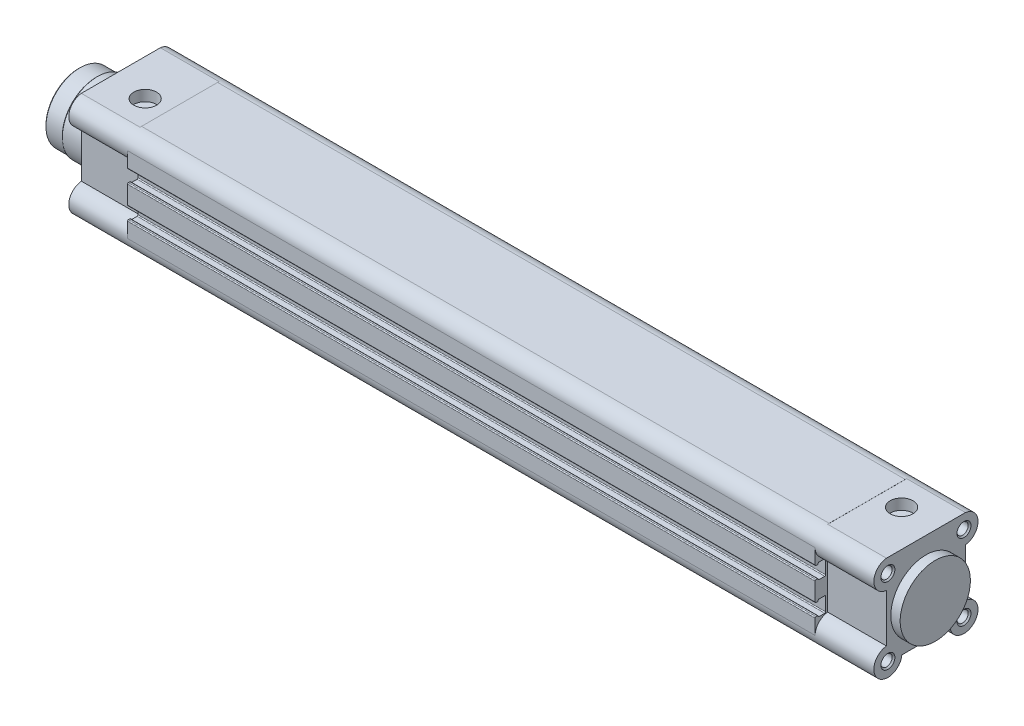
ISO-10303-21;
HEADER;
FILE_DESCRIPTION(('STEP AP214'),'2;1');
FILE_NAME('part.step','',(''),(''),'','','');
FILE_SCHEMA(('AUTOMOTIVE_DESIGN { 1 0 10303 214 1 1 1 1 }'));
ENDSEC;
DATA;
#1=APPLICATION_CONTEXT('core data for automotive mechanical design processes');
#2=APPLICATION_PROTOCOL_DEFINITION('international standard','automotive_design',2000,#1);
#3=PRODUCT_CONTEXT('',#1,'mechanical');
#4=PRODUCT('Part','Part','',(#3));
#5=PRODUCT_RELATED_PRODUCT_CATEGORY('part','',(#4));
#6=PRODUCT_DEFINITION_FORMATION('','',#4);
#7=PRODUCT_DEFINITION_CONTEXT('part definition',#1,'design');
#8=PRODUCT_DEFINITION('design','',#6,#7);
#9=PRODUCT_DEFINITION_SHAPE('','',#8);
#10=(LENGTH_UNIT() NAMED_UNIT(*) SI_UNIT(.MILLI.,.METRE.));
#11=(NAMED_UNIT(*) PLANE_ANGLE_UNIT() SI_UNIT($,.RADIAN.));
#12=(NAMED_UNIT(*) SI_UNIT($,.STERADIAN.) SOLID_ANGLE_UNIT());
#13=UNCERTAINTY_MEASURE_WITH_UNIT(LENGTH_MEASURE(1.E-05),#10,'distance_accuracy_value','');
#14=(GEOMETRIC_REPRESENTATION_CONTEXT(3) GLOBAL_UNCERTAINTY_ASSIGNED_CONTEXT((#13)) GLOBAL_UNIT_ASSIGNED_CONTEXT((#10,
#11,#12)) REPRESENTATION_CONTEXT('',''));
#15=CARTESIAN_POINT('',(0.,0.,0.));
#16=DIRECTION('',(0.,0.,1.));
#17=DIRECTION('',(1.,0.,0.));
#18=AXIS2_PLACEMENT_3D('',#15,#16,#17);
#19=CARTESIAN_POINT('',(344.,16.25,16.25));
#20=DIRECTION('',(1.,0.,0.));
#21=DIRECTION('',(0.,0.,-1.));
#22=AXIS2_PLACEMENT_3D('',#19,#20,#21);
#23=PLANE('',#22);
#24=CARTESIAN_POINT('',(344.,-16.25,-16.25));
#25=DIRECTION('',(1.,0.,0.));
#26=DIRECTION('',(0.,0.,-1.));
#27=AXIS2_PLACEMENT_3D('',#24,#25,#26);
#28=CIRCLE('',#27,2.99000000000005);
#29=CARTESIAN_POINT('',(344.,-16.25,-19.24));
#30=VERTEX_POINT('',#29);
#31=EDGE_CURVE('E1382',#30,#30,#28,.T.);
#32=ORIENTED_EDGE('',*,*,#31,.F.);
#33=EDGE_LOOP('',(#32));
#34=FACE_BOUND('',#33,.T.);
#35=CARTESIAN_POINT('',(344.,16.25,-16.25));
#36=DIRECTION('',(1.,0.,0.));
#37=DIRECTION('',(0.,0.,-1.));
#38=AXIS2_PLACEMENT_3D('',#35,#36,#37);
#39=CIRCLE('',#38,2.99000000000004);
#40=CARTESIAN_POINT('',(344.,16.25,-19.24));
#41=VERTEX_POINT('',#40);
#42=EDGE_CURVE('E1377',#41,#41,#39,.T.);
#43=ORIENTED_EDGE('',*,*,#42,.F.);
#44=EDGE_LOOP('',(#43));
#45=FACE_BOUND('',#44,.T.);
#46=CARTESIAN_POINT('',(344.,-16.25,16.25));
#47=DIRECTION('',(1.,0.,0.));
#48=DIRECTION('',(0.,0.,-1.));
#49=AXIS2_PLACEMENT_3D('',#46,#47,#48);
#50=CIRCLE('',#49,2.99000000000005);
#51=CARTESIAN_POINT('',(344.,-16.25,13.26));
#52=VERTEX_POINT('',#51);
#53=EDGE_CURVE('E1372',#52,#52,#50,.T.);
#54=ORIENTED_EDGE('',*,*,#53,.F.);
#55=EDGE_LOOP('',(#54));
#56=FACE_BOUND('',#55,.T.);
#57=CARTESIAN_POINT('',(344.,16.25,16.25));
#58=DIRECTION('',(1.,0.,0.));
#59=DIRECTION('',(0.,0.,-1.));
#60=AXIS2_PLACEMENT_3D('',#57,#58,#59);
#61=CIRCLE('',#60,2.99000000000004);
#62=CARTESIAN_POINT('',(344.,16.25,13.26));
#63=VERTEX_POINT('',#62);
#64=EDGE_CURVE('E1368',#63,#63,#61,.T.);
#65=ORIENTED_EDGE('',*,*,#64,.F.);
#66=EDGE_LOOP('',(#65));
#67=FACE_BOUND('',#66,.T.);
#68=CARTESIAN_POINT('',(344.,16.25,16.25));
#69=DIRECTION('',(1.,0.,0.));
#70=DIRECTION('',(0.,0.,-1.));
#71=AXIS2_PLACEMENT_3D('',#68,#69,#70);
#72=CIRCLE('',#71,5.99999999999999);
#73=CARTESIAN_POINT('',(344.,22.21735913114,16.875));
#74=VERTEX_POINT('',#73);
#75=CARTESIAN_POINT('',(344.,10.28264086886,16.875));
#76=VERTEX_POINT('',#75);
#77=EDGE_CURVE('E1473',#74,#76,#72,.T.);
#78=ORIENTED_EDGE('',*,*,#77,.T.);
#79=DIRECTION('',(0.,-1.,0.));
#80=VECTOR('',#79,1.);
#81=CARTESIAN_POINT('',(344.,10.28264086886,16.875));
#82=LINE('',#81,#80);
#83=CARTESIAN_POINT('',(344.,-10.28264086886,16.875));
#84=VERTEX_POINT('',#83);
#85=EDGE_CURVE('E1476',#76,#84,#82,.T.);
#86=ORIENTED_EDGE('',*,*,#85,.T.);
#87=CARTESIAN_POINT('',(344.,-16.2500000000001,16.2499999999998));
#88=DIRECTION('',(1.,0.,0.));
#89=DIRECTION('',(0.,0.,-1.));
#90=AXIS2_PLACEMENT_3D('',#87,#88,#89);
#91=CIRCLE('',#90,6.00000000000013);
#92=CARTESIAN_POINT('',(344.,-16.885,10.283696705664));
#93=VERTEX_POINT('',#92);
#94=EDGE_CURVE('E1478',#84,#93,#91,.T.);
#95=ORIENTED_EDGE('',*,*,#94,.T.);
#96=DIRECTION('',(0.,0.,-1.));
#97=VECTOR('',#96,1.);
#98=CARTESIAN_POINT('',(344.,-16.885,10.283696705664));
#99=LINE('',#98,#97);
#100=CARTESIAN_POINT('',(344.,-16.885,-10.283696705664));
#101=VERTEX_POINT('',#100);
#102=EDGE_CURVE('E1480',#93,#101,#99,.T.);
#103=ORIENTED_EDGE('',*,*,#102,.T.);
#104=CARTESIAN_POINT('',(344.,-16.2500000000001,-16.2499999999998));
#105=DIRECTION('',(1.,0.,0.));
#106=DIRECTION('',(0.,0.,-1.));
#107=AXIS2_PLACEMENT_3D('',#104,#105,#106);
#108=CIRCLE('',#107,6.00000000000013);
#109=CARTESIAN_POINT('',(344.,-10.28264086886,-16.875));
#110=VERTEX_POINT('',#109);
#111=EDGE_CURVE('E1482',#101,#110,#108,.T.);
#112=ORIENTED_EDGE('',*,*,#111,.T.);
#113=DIRECTION('',(0.,1.,0.));
#114=VECTOR('',#113,1.);
#115=CARTESIAN_POINT('',(344.,-10.28264086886,-16.875));
#116=LINE('',#115,#114);
#117=CARTESIAN_POINT('',(344.,10.28264086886,-16.875));
#118=VERTEX_POINT('',#117);
#119=EDGE_CURVE('E1484',#110,#118,#116,.T.);
#120=ORIENTED_EDGE('',*,*,#119,.T.);
#121=CARTESIAN_POINT('',(344.,16.25,-16.25));
#122=DIRECTION('',(1.,0.,0.));
#123=DIRECTION('',(0.,0.,-1.));
#124=AXIS2_PLACEMENT_3D('',#121,#122,#123);
#125=CIRCLE('',#124,5.99999999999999);
#126=CARTESIAN_POINT('',(344.,22.21735913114,-16.875));
#127=VERTEX_POINT('',#126);
#128=EDGE_CURVE('E1486',#118,#127,#125,.T.);
#129=ORIENTED_EDGE('',*,*,#128,.T.);
#130=DIRECTION('',(0.,0.,1.));
#131=VECTOR('',#130,1.);
#132=CARTESIAN_POINT('',(344.,22.21735913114,-16.875));
#133=LINE('',#132,#131);
#134=EDGE_CURVE('E1488',#127,#74,#133,.T.);
#135=ORIENTED_EDGE('',*,*,#134,.T.);
#136=EDGE_LOOP('',(#78,#86,#95,#103,#112,#120,#129,#135));
#137=FACE_BOUND('',#136,.T.);
#138=CARTESIAN_POINT('',(344.,0.,0.));
#139=DIRECTION('',(1.,0.,0.));
#140=DIRECTION('',(0.,0.,-1.));
#141=AXIS2_PLACEMENT_3D('',#138,#139,#140);
#142=CIRCLE('',#141,15.);
#143=CARTESIAN_POINT('',(344.,0.,-15.));
#144=VERTEX_POINT('',#143);
#145=EDGE_CURVE('E1453',#144,#144,#142,.T.);
#146=ORIENTED_EDGE('',*,*,#145,.F.);
#147=EDGE_LOOP('',(#146));
#148=FACE_BOUND('',#147,.T.);
#149=ADVANCED_FACE('F32',(#34,#45,#56,#67,#137,#148),#23,.T.);
#150=CARTESIAN_POINT('',(318.9,3.85000000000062,21.8500000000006));
#151=DIRECTION('',(1.,0.,0.));
#152=DIRECTION('',(0.,0.,-1.));
#153=AXIS2_PLACEMENT_3D('',#150,#151,#152);
#154=PLANE('',#153);
#155=DIRECTION('',(0.,-1.,0.));
#156=VECTOR('',#155,1.);
#157=CARTESIAN_POINT('',(318.9,10.28264086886,16.875));
#158=LINE('',#157,#156);
#159=CARTESIAN_POINT('',(318.9,10.28264086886,16.875));
#160=VERTEX_POINT('',#159);
#161=CARTESIAN_POINT('',(318.9,-10.28264086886,16.875));
#162=VERTEX_POINT('',#161);
#163=EDGE_CURVE('E1459',#160,#162,#158,.T.);
#164=ORIENTED_EDGE('',*,*,#163,.F.);
#165=CARTESIAN_POINT('',(318.9,16.25,16.25));
#166=DIRECTION('',(1.,0.,0.));
#167=DIRECTION('',(0.,0.,-1.));
#168=AXIS2_PLACEMENT_3D('',#165,#166,#167);
#169=CIRCLE('',#168,5.99999999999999);
#170=CARTESIAN_POINT('',(318.9,16.25,22.25));
#171=VERTEX_POINT('',#170);
#172=EDGE_CURVE('E11',#160,#171,#169,.F.);
#173=ORIENTED_EDGE('',*,*,#172,.T.);
#174=DIRECTION('',(0.,-1.,0.));
#175=VECTOR('',#174,1.);
#176=CARTESIAN_POINT('',(318.9,16.25,22.25));
#177=LINE('',#176,#175);
#178=CARTESIAN_POINT('',(318.9,9.85,22.25));
#179=VERTEX_POINT('',#178);
#180=EDGE_CURVE('E1899',#171,#179,#177,.T.);
#181=ORIENTED_EDGE('',*,*,#180,.T.);
#182=CARTESIAN_POINT('',(318.9,9.84999999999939,21.8500000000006));
#183=DIRECTION('',(1.,0.,0.));
#184=DIRECTION('',(0.,0.,-1.));
#185=AXIS2_PLACEMENT_3D('',#182,#183,#184);
#186=CIRCLE('',#185,0.399999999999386);
#187=CARTESIAN_POINT('',(318.9,9.45,21.85));
#188=VERTEX_POINT('',#187);
#189=EDGE_CURVE('E1901',#179,#188,#186,.T.);
#190=ORIENTED_EDGE('',*,*,#189,.T.);
#191=DIRECTION('',(0.,0.,-1.));
#192=VECTOR('',#191,1.);
#193=CARTESIAN_POINT('',(318.9,9.45,21.85));
#194=LINE('',#193,#192);
#195=CARTESIAN_POINT('',(318.9,9.45,21.25));
#196=VERTEX_POINT('',#195);
#197=EDGE_CURVE('E1903',#188,#196,#194,.T.);
#198=ORIENTED_EDGE('',*,*,#197,.T.);
#199=CARTESIAN_POINT('',(318.9,9.74999999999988,21.2499999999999));
#200=DIRECTION('',(1.,0.,0.));
#201=DIRECTION('',(0.,0.,-1.));
#202=AXIS2_PLACEMENT_3D('',#199,#200,#201);
#203=CIRCLE('',#202,0.299999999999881);
#204=CARTESIAN_POINT('',(318.9,9.75,20.95));
#205=VERTEX_POINT('',#204);
#206=EDGE_CURVE('E1905',#196,#205,#203,.T.);
#207=ORIENTED_EDGE('',*,*,#206,.T.);
#208=DIRECTION('',(0.,1.,0.));
#209=VECTOR('',#208,1.);
#210=CARTESIAN_POINT('',(318.9,9.75,20.95));
#211=LINE('',#210,#209);
#212=CARTESIAN_POINT('',(318.9,9.8,20.95));
#213=VERTEX_POINT('',#212);
#214=EDGE_CURVE('E1907',#205,#213,#211,.T.);
#215=ORIENTED_EDGE('',*,*,#214,.T.);
#216=CARTESIAN_POINT('',(318.9,9.80000000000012,20.6500000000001));
#217=DIRECTION('',(-1.,0.,0.));
#218=DIRECTION('',(0.,0.,1.));
#219=AXIS2_PLACEMENT_3D('',#216,#217,#218);
#220=CIRCLE('',#219,0.299999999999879);
#221=CARTESIAN_POINT('',(318.9,10.1,20.65));
#222=VERTEX_POINT('',#221);
#223=EDGE_CURVE('E1909',#213,#222,#220,.T.);
#224=ORIENTED_EDGE('',*,*,#223,.T.);
#225=DIRECTION('',(0.,0.,-1.));
#226=VECTOR('',#225,1.);
#227=CARTESIAN_POINT('',(318.9,10.1,20.65));
#228=LINE('',#227,#226);
#229=CARTESIAN_POINT('',(318.9,10.1,18.15));
#230=VERTEX_POINT('',#229);
#231=EDGE_CURVE('E1911',#222,#230,#228,.T.);
#232=ORIENTED_EDGE('',*,*,#231,.T.);
#233=CARTESIAN_POINT('',(318.9,9.70000000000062,18.1499999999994));
#234=DIRECTION('',(-1.,0.,0.));
#235=DIRECTION('',(0.,0.,1.));
#236=AXIS2_PLACEMENT_3D('',#233,#234,#235);
#237=CIRCLE('',#236,0.399999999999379);
#238=CARTESIAN_POINT('',(318.9,9.7,17.75));
#239=VERTEX_POINT('',#238);
#240=EDGE_CURVE('E1913',#230,#239,#237,.T.);
#241=ORIENTED_EDGE('',*,*,#240,.T.);
#242=DIRECTION('',(0.,-1.,0.));
#243=VECTOR('',#242,1.);
#244=CARTESIAN_POINT('',(318.9,9.7,17.75));
#245=LINE('',#244,#243);
#246=CARTESIAN_POINT('',(318.9,4.,17.75));
#247=VERTEX_POINT('',#246);
#248=EDGE_CURVE('E1915',#239,#247,#245,.T.);
#249=ORIENTED_EDGE('',*,*,#248,.T.);
#250=CARTESIAN_POINT('',(318.9,3.99999999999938,18.1499999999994));
#251=DIRECTION('',(-1.,0.,0.));
#252=DIRECTION('',(0.,0.,1.));
#253=AXIS2_PLACEMENT_3D('',#250,#251,#252);
#254=CIRCLE('',#253,0.399999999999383);
#255=CARTESIAN_POINT('',(318.9,3.6,18.15));
#256=VERTEX_POINT('',#255);
#257=EDGE_CURVE('E1917',#247,#256,#254,.T.);
#258=ORIENTED_EDGE('',*,*,#257,.T.);
#259=DIRECTION('',(0.,0.,1.));
#260=VECTOR('',#259,1.);
#261=CARTESIAN_POINT('',(318.9,3.6,18.15));
#262=LINE('',#261,#260);
#263=CARTESIAN_POINT('',(318.9,3.6,20.65));
#264=VERTEX_POINT('',#263);
#265=EDGE_CURVE('E1919',#256,#264,#262,.T.);
#266=ORIENTED_EDGE('',*,*,#265,.T.);
#267=CARTESIAN_POINT('',(318.9,3.89999999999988,20.6500000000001));
#268=DIRECTION('',(-1.,0.,0.));
#269=DIRECTION('',(0.,0.,1.));
#270=AXIS2_PLACEMENT_3D('',#267,#268,#269);
#271=CIRCLE('',#270,0.29999999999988);
#272=CARTESIAN_POINT('',(318.9,3.9,20.95));
#273=VERTEX_POINT('',#272);
#274=EDGE_CURVE('E1921',#264,#273,#271,.T.);
#275=ORIENTED_EDGE('',*,*,#274,.T.);
#276=DIRECTION('',(0.,1.,0.));
#277=VECTOR('',#276,1.);
#278=CARTESIAN_POINT('',(318.9,3.9,20.95));
#279=LINE('',#278,#277);
#280=CARTESIAN_POINT('',(318.9,3.95,20.95));
#281=VERTEX_POINT('',#280);
#282=EDGE_CURVE('E1923',#273,#281,#279,.T.);
#283=ORIENTED_EDGE('',*,*,#282,.T.);
#284=CARTESIAN_POINT('',(318.9,3.95000000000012,21.2499999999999));
#285=DIRECTION('',(1.,0.,0.));
#286=DIRECTION('',(0.,0.,-1.));
#287=AXIS2_PLACEMENT_3D('',#284,#285,#286);
#288=CIRCLE('',#287,0.29999999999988);
#289=CARTESIAN_POINT('',(318.9,4.25,21.25));
#290=VERTEX_POINT('',#289);
#291=EDGE_CURVE('E1925',#281,#290,#288,.T.);
#292=ORIENTED_EDGE('',*,*,#291,.T.);
#293=DIRECTION('',(0.,0.,1.));
#294=VECTOR('',#293,1.);
#295=CARTESIAN_POINT('',(318.9,4.25,21.25));
#296=LINE('',#295,#294);
#297=CARTESIAN_POINT('',(318.9,4.25,21.85));
#298=VERTEX_POINT('',#297);
#299=EDGE_CURVE('E1927',#290,#298,#296,.T.);
#300=ORIENTED_EDGE('',*,*,#299,.T.);
#301=CARTESIAN_POINT('',(318.9,3.85000000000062,21.8500000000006));
#302=DIRECTION('',(1.,0.,0.));
#303=DIRECTION('',(0.,0.,-1.));
#304=AXIS2_PLACEMENT_3D('',#301,#302,#303);
#305=CIRCLE('',#304,0.399999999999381);
#306=CARTESIAN_POINT('',(318.9,3.85,22.25));
#307=VERTEX_POINT('',#306);
#308=EDGE_CURVE('E1720',#298,#307,#305,.T.);
#309=ORIENTED_EDGE('',*,*,#308,.T.);
#310=DIRECTION('',(0.,-1.,0.));
#311=VECTOR('',#310,1.);
#312=CARTESIAN_POINT('',(318.9,3.85,22.25));
#313=LINE('',#312,#311);
#314=CARTESIAN_POINT('',(318.9,-3.85,22.25));
#315=VERTEX_POINT('',#314);
#316=EDGE_CURVE('E1723',#307,#315,#313,.T.);
#317=ORIENTED_EDGE('',*,*,#316,.T.);
#318=CARTESIAN_POINT('',(318.9,-3.85000000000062,21.8500000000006));
#319=DIRECTION('',(1.,0.,0.));
#320=DIRECTION('',(0.,0.,-1.));
#321=AXIS2_PLACEMENT_3D('',#318,#319,#320);
#322=CIRCLE('',#321,0.399999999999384);
#323=CARTESIAN_POINT('',(318.9,-4.25,21.85));
#324=VERTEX_POINT('',#323);
#325=EDGE_CURVE('E1725',#315,#324,#322,.T.);
#326=ORIENTED_EDGE('',*,*,#325,.T.);
#327=DIRECTION('',(0.,0.,-1.));
#328=VECTOR('',#327,1.);
#329=CARTESIAN_POINT('',(318.9,-4.25,21.85));
#330=LINE('',#329,#328);
#331=CARTESIAN_POINT('',(318.9,-4.25,21.25));
#332=VERTEX_POINT('',#331);
#333=EDGE_CURVE('E1727',#324,#332,#330,.T.);
#334=ORIENTED_EDGE('',*,*,#333,.T.);
#335=CARTESIAN_POINT('',(318.9,-3.95000000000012,21.2499999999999));
#336=DIRECTION('',(1.,0.,0.));
#337=DIRECTION('',(0.,0.,-1.));
#338=AXIS2_PLACEMENT_3D('',#335,#336,#337);
#339=CIRCLE('',#338,0.29999999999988);
#340=CARTESIAN_POINT('',(318.9,-3.95,20.95));
#341=VERTEX_POINT('',#340);
#342=EDGE_CURVE('E1729',#332,#341,#339,.T.);
#343=ORIENTED_EDGE('',*,*,#342,.T.);
#344=DIRECTION('',(0.,1.,0.));
#345=VECTOR('',#344,1.);
#346=CARTESIAN_POINT('',(318.9,-3.95,20.95));
#347=LINE('',#346,#345);
#348=CARTESIAN_POINT('',(318.9,-3.9,20.95));
#349=VERTEX_POINT('',#348);
#350=EDGE_CURVE('E1731',#341,#349,#347,.T.);
#351=ORIENTED_EDGE('',*,*,#350,.T.);
#352=CARTESIAN_POINT('',(318.9,-3.89999999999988,20.6500000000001));
#353=DIRECTION('',(-1.,0.,0.));
#354=DIRECTION('',(0.,0.,1.));
#355=AXIS2_PLACEMENT_3D('',#352,#353,#354);
#356=CIRCLE('',#355,0.299999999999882);
#357=CARTESIAN_POINT('',(318.9,-3.6,20.65));
#358=VERTEX_POINT('',#357);
#359=EDGE_CURVE('E1733',#349,#358,#356,.T.);
#360=ORIENTED_EDGE('',*,*,#359,.T.);
#361=DIRECTION('',(0.,0.,-1.));
#362=VECTOR('',#361,1.);
#363=CARTESIAN_POINT('',(318.9,-3.6,20.65));
#364=LINE('',#363,#362);
#365=CARTESIAN_POINT('',(318.9,-3.6,18.15));
#366=VERTEX_POINT('',#365);
#367=EDGE_CURVE('E1735',#358,#366,#364,.T.);
#368=ORIENTED_EDGE('',*,*,#367,.T.);
#369=CARTESIAN_POINT('',(318.9,-3.99999999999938,18.1499999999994));
#370=DIRECTION('',(-1.,0.,0.));
#371=DIRECTION('',(0.,0.,1.));
#372=AXIS2_PLACEMENT_3D('',#369,#370,#371);
#373=CIRCLE('',#372,0.39999999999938);
#374=CARTESIAN_POINT('',(318.9,-4.,17.75));
#375=VERTEX_POINT('',#374);
#376=EDGE_CURVE('E1737',#366,#375,#373,.T.);
#377=ORIENTED_EDGE('',*,*,#376,.T.);
#378=DIRECTION('',(0.,-1.,0.));
#379=VECTOR('',#378,1.);
#380=CARTESIAN_POINT('',(318.9,-4.,17.75));
#381=LINE('',#380,#379);
#382=CARTESIAN_POINT('',(318.9,-9.7,17.75));
#383=VERTEX_POINT('',#382);
#384=EDGE_CURVE('E1739',#375,#383,#381,.T.);
#385=ORIENTED_EDGE('',*,*,#384,.T.);
#386=CARTESIAN_POINT('',(318.9,-9.70000000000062,18.1499999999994));
#387=DIRECTION('',(-1.,0.,0.));
#388=DIRECTION('',(0.,0.,1.));
#389=AXIS2_PLACEMENT_3D('',#386,#387,#388);
#390=CIRCLE('',#389,0.399999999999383);
#391=CARTESIAN_POINT('',(318.9,-10.1,18.15));
#392=VERTEX_POINT('',#391);
#393=EDGE_CURVE('E1741',#383,#392,#390,.T.);
#394=ORIENTED_EDGE('',*,*,#393,.T.);
#395=DIRECTION('',(0.,0.,1.));
#396=VECTOR('',#395,1.);
#397=CARTESIAN_POINT('',(318.9,-10.1,18.15));
#398=LINE('',#397,#396);
#399=CARTESIAN_POINT('',(318.9,-10.1,20.65));
#400=VERTEX_POINT('',#399);
#401=EDGE_CURVE('E1743',#392,#400,#398,.T.);
#402=ORIENTED_EDGE('',*,*,#401,.T.);
#403=CARTESIAN_POINT('',(318.9,-9.80000000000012,20.6500000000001));
#404=DIRECTION('',(-1.,0.,0.));
#405=DIRECTION('',(0.,0.,1.));
#406=AXIS2_PLACEMENT_3D('',#403,#404,#405);
#407=CIRCLE('',#406,0.299999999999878);
#408=CARTESIAN_POINT('',(318.9,-9.8,20.95));
#409=VERTEX_POINT('',#408);
#410=EDGE_CURVE('E1745',#400,#409,#407,.T.);
#411=ORIENTED_EDGE('',*,*,#410,.T.);
#412=DIRECTION('',(0.,1.,0.));
#413=VECTOR('',#412,1.);
#414=CARTESIAN_POINT('',(318.9,-9.8,20.95));
#415=LINE('',#414,#413);
#416=CARTESIAN_POINT('',(318.9,-9.75,20.95));
#417=VERTEX_POINT('',#416);
#418=EDGE_CURVE('E1747',#409,#417,#415,.T.);
#419=ORIENTED_EDGE('',*,*,#418,.T.);
#420=CARTESIAN_POINT('',(318.9,-9.74999999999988,21.2499999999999));
#421=DIRECTION('',(1.,0.,0.));
#422=DIRECTION('',(0.,0.,-1.));
#423=AXIS2_PLACEMENT_3D('',#420,#421,#422);
#424=CIRCLE('',#423,0.299999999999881);
#425=CARTESIAN_POINT('',(318.9,-9.45,21.25));
#426=VERTEX_POINT('',#425);
#427=EDGE_CURVE('E1749',#417,#426,#424,.T.);
#428=ORIENTED_EDGE('',*,*,#427,.T.);
#429=DIRECTION('',(0.,0.,1.));
#430=VECTOR('',#429,1.);
#431=CARTESIAN_POINT('',(318.9,-9.45,21.25));
#432=LINE('',#431,#430);
#433=CARTESIAN_POINT('',(318.9,-9.45,21.85));
#434=VERTEX_POINT('',#433);
#435=EDGE_CURVE('E1751',#426,#434,#432,.T.);
#436=ORIENTED_EDGE('',*,*,#435,.T.);
#437=CARTESIAN_POINT('',(318.9,-9.84999999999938,21.8500000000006));
#438=DIRECTION('',(1.,0.,0.));
#439=DIRECTION('',(0.,0.,-1.));
#440=AXIS2_PLACEMENT_3D('',#437,#438,#439);
#441=CIRCLE('',#440,0.39999999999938);
#442=CARTESIAN_POINT('',(318.9,-9.85,22.25));
#443=VERTEX_POINT('',#442);
#444=EDGE_CURVE('E1753',#434,#443,#441,.T.);
#445=ORIENTED_EDGE('',*,*,#444,.T.);
#446=DIRECTION('',(0.,-1.,0.));
#447=VECTOR('',#446,1.);
#448=CARTESIAN_POINT('',(318.9,-9.85,22.25));
#449=LINE('',#448,#447);
#450=CARTESIAN_POINT('',(318.9,-16.2500000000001,22.2499999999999));
#451=VERTEX_POINT('',#450);
#452=EDGE_CURVE('E1755',#443,#451,#449,.T.);
#453=ORIENTED_EDGE('',*,*,#452,.T.);
#454=CARTESIAN_POINT('',(318.9,-16.2500000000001,16.2499999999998));
#455=DIRECTION('',(1.,0.,0.));
#456=DIRECTION('',(0.,0.,-1.));
#457=AXIS2_PLACEMENT_3D('',#454,#455,#456);
#458=CIRCLE('',#457,6.00000000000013);
#459=EDGE_CURVE('E1461',#162,#451,#458,.T.);
#460=ORIENTED_EDGE('',*,*,#459,.F.);
#461=EDGE_LOOP('',(#164,#173,#181,#190,#198,#207,#215,#224,#232,#241,#249,#258,#266,#275,#283,
#292,#300,#309,#317,#326,#334,#343,#351,#360,#368,#377,#385,#394,#402,#411,#419,#428,#436,#445,
#453,#460));
#462=FACE_BOUND('',#461,.T.);
#463=ADVANCED_FACE('F813',(#462),#154,.T.);
#464=DIRECTION('',(0.,0.,-1.));
#465=VECTOR('',#464,1.);
#466=CARTESIAN_POINT('',(318.9,-16.885,10.283696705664));
#467=LINE('',#466,#465);
#468=CARTESIAN_POINT('',(318.9,-16.885,10.283696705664));
#469=VERTEX_POINT('',#468);
#470=CARTESIAN_POINT('',(318.9,-16.885,-10.283696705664));
#471=VERTEX_POINT('',#470);
#472=EDGE_CURVE('E1463',#469,#471,#467,.T.);
#473=ORIENTED_EDGE('',*,*,#472,.F.);
#474=CARTESIAN_POINT('',(318.9,-16.2500000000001,16.2499999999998));
#475=DIRECTION('',(1.,0.,0.));
#476=DIRECTION('',(0.,0.,-1.));
#477=AXIS2_PLACEMENT_3D('',#474,#475,#476);
#478=CIRCLE('',#477,6.00000000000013);
#479=CARTESIAN_POINT('',(318.9,-22.2500000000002,16.2499999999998));
#480=VERTEX_POINT('',#479);
#481=EDGE_CURVE('E41',#469,#480,#478,.F.);
#482=ORIENTED_EDGE('',*,*,#481,.T.);
#483=DIRECTION('',(0.,0.,-1.));
#484=VECTOR('',#483,1.);
#485=CARTESIAN_POINT('',(318.9,-22.25,16.25));
#486=LINE('',#485,#484);
#487=CARTESIAN_POINT('',(318.9,-22.25,9.85));
#488=VERTEX_POINT('',#487);
#489=EDGE_CURVE('E1758',#480,#488,#486,.T.);
#490=ORIENTED_EDGE('',*,*,#489,.T.);
#491=CARTESIAN_POINT('',(318.9,-21.8500000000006,9.84999999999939));
#492=DIRECTION('',(1.,0.,0.));
#493=DIRECTION('',(0.,0.,-1.));
#494=AXIS2_PLACEMENT_3D('',#491,#492,#493);
#495=CIRCLE('',#494,0.399999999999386);
#496=CARTESIAN_POINT('',(318.9,-21.85,9.45));
#497=VERTEX_POINT('',#496);
#498=EDGE_CURVE('E1760',#488,#497,#495,.T.);
#499=ORIENTED_EDGE('',*,*,#498,.T.);
#500=DIRECTION('',(0.,1.,0.));
#501=VECTOR('',#500,1.);
#502=CARTESIAN_POINT('',(318.9,-21.85,9.45));
#503=LINE('',#502,#501);
#504=CARTESIAN_POINT('',(318.9,-21.25,9.45));
#505=VERTEX_POINT('',#504);
#506=EDGE_CURVE('E1762',#497,#505,#503,.T.);
#507=ORIENTED_EDGE('',*,*,#506,.T.);
#508=CARTESIAN_POINT('',(318.9,-21.2499999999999,9.74999999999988));
#509=DIRECTION('',(1.,0.,0.));
#510=DIRECTION('',(0.,0.,-1.));
#511=AXIS2_PLACEMENT_3D('',#508,#509,#510);
#512=CIRCLE('',#511,0.299999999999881);
#513=CARTESIAN_POINT('',(318.9,-20.95,9.75));
#514=VERTEX_POINT('',#513);
#515=EDGE_CURVE('E1764',#505,#514,#512,.T.);
#516=ORIENTED_EDGE('',*,*,#515,.T.);
#517=DIRECTION('',(0.,0.,1.));
#518=VECTOR('',#517,1.);
#519=CARTESIAN_POINT('',(318.9,-20.95,9.75));
#520=LINE('',#519,#518);
#521=CARTESIAN_POINT('',(318.9,-20.95,9.8));
#522=VERTEX_POINT('',#521);
#523=EDGE_CURVE('E1766',#514,#522,#520,.T.);
#524=ORIENTED_EDGE('',*,*,#523,.T.);
#525=CARTESIAN_POINT('',(318.9,-20.6500000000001,9.80000000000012));
#526=DIRECTION('',(-1.,0.,0.));
#527=DIRECTION('',(0.,0.,1.));
#528=AXIS2_PLACEMENT_3D('',#525,#526,#527);
#529=CIRCLE('',#528,0.299999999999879);
#530=CARTESIAN_POINT('',(318.9,-20.65,10.1));
#531=VERTEX_POINT('',#530);
#532=EDGE_CURVE('E1768',#522,#531,#529,.T.);
#533=ORIENTED_EDGE('',*,*,#532,.T.);
#534=DIRECTION('',(0.,1.,0.));
#535=VECTOR('',#534,1.);
#536=CARTESIAN_POINT('',(318.9,-20.65,10.1));
#537=LINE('',#536,#535);
#538=CARTESIAN_POINT('',(318.9,-18.15,10.1));
#539=VERTEX_POINT('',#538);
#540=EDGE_CURVE('E1770',#531,#539,#537,.T.);
#541=ORIENTED_EDGE('',*,*,#540,.T.);
#542=CARTESIAN_POINT('',(318.9,-18.1499999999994,9.70000000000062));
#543=DIRECTION('',(-1.,0.,0.));
#544=DIRECTION('',(0.,0.,1.));
#545=AXIS2_PLACEMENT_3D('',#542,#543,#544);
#546=CIRCLE('',#545,0.399999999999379);
#547=CARTESIAN_POINT('',(318.9,-17.75,9.7));
#548=VERTEX_POINT('',#547);
#549=EDGE_CURVE('E1772',#539,#548,#546,.T.);
#550=ORIENTED_EDGE('',*,*,#549,.T.);
#551=DIRECTION('',(0.,0.,-1.));
#552=VECTOR('',#551,1.);
#553=CARTESIAN_POINT('',(318.9,-17.75,9.7));
#554=LINE('',#553,#552);
#555=CARTESIAN_POINT('',(318.9,-17.75,4.));
#556=VERTEX_POINT('',#555);
#557=EDGE_CURVE('E1774',#548,#556,#554,.T.);
#558=ORIENTED_EDGE('',*,*,#557,.T.);
#559=CARTESIAN_POINT('',(318.9,-18.1499999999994,3.99999999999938));
#560=DIRECTION('',(-1.,0.,0.));
#561=DIRECTION('',(0.,0.,1.));
#562=AXIS2_PLACEMENT_3D('',#559,#560,#561);
#563=CIRCLE('',#562,0.399999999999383);
#564=CARTESIAN_POINT('',(318.9,-18.15,3.6));
#565=VERTEX_POINT('',#564);
#566=EDGE_CURVE('E1776',#556,#565,#563,.T.);
#567=ORIENTED_EDGE('',*,*,#566,.T.);
#568=DIRECTION('',(0.,-1.,0.));
#569=VECTOR('',#568,1.);
#570=CARTESIAN_POINT('',(318.9,-18.15,3.6));
#571=LINE('',#570,#569);
#572=CARTESIAN_POINT('',(318.9,-20.65,3.6));
#573=VERTEX_POINT('',#572);
#574=EDGE_CURVE('E1778',#565,#573,#571,.T.);
#575=ORIENTED_EDGE('',*,*,#574,.T.);
#576=CARTESIAN_POINT('',(318.9,-20.6500000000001,3.89999999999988));
#577=DIRECTION('',(-1.,0.,0.));
#578=DIRECTION('',(0.,0.,1.));
#579=AXIS2_PLACEMENT_3D('',#576,#577,#578);
#580=CIRCLE('',#579,0.29999999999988);
#581=CARTESIAN_POINT('',(318.9,-20.95,3.9));
#582=VERTEX_POINT('',#581);
#583=EDGE_CURVE('E1780',#573,#582,#580,.T.);
#584=ORIENTED_EDGE('',*,*,#583,.T.);
#585=DIRECTION('',(0.,0.,1.));
#586=VECTOR('',#585,1.);
#587=CARTESIAN_POINT('',(318.9,-20.95,3.9));
#588=LINE('',#587,#586);
#589=CARTESIAN_POINT('',(318.9,-20.95,3.95));
#590=VERTEX_POINT('',#589);
#591=EDGE_CURVE('E1782',#582,#590,#588,.T.);
#592=ORIENTED_EDGE('',*,*,#591,.T.);
#593=CARTESIAN_POINT('',(318.9,-21.2499999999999,3.95000000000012));
#594=DIRECTION('',(1.,0.,0.));
#595=DIRECTION('',(0.,0.,-1.));
#596=AXIS2_PLACEMENT_3D('',#593,#594,#595);
#597=CIRCLE('',#596,0.29999999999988);
#598=CARTESIAN_POINT('',(318.9,-21.25,4.25));
#599=VERTEX_POINT('',#598);
#600=EDGE_CURVE('E1784',#590,#599,#597,.T.);
#601=ORIENTED_EDGE('',*,*,#600,.T.);
#602=DIRECTION('',(0.,-1.,0.));
#603=VECTOR('',#602,1.);
#604=CARTESIAN_POINT('',(318.9,-21.25,4.25));
#605=LINE('',#604,#603);
#606=CARTESIAN_POINT('',(318.9,-21.85,4.25));
#607=VERTEX_POINT('',#606);
#608=EDGE_CURVE('E1786',#599,#607,#605,.T.);
#609=ORIENTED_EDGE('',*,*,#608,.T.);
#610=CARTESIAN_POINT('',(318.9,-21.8500000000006,3.85000000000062));
#611=DIRECTION('',(1.,0.,0.));
#612=DIRECTION('',(0.,0.,-1.));
#613=AXIS2_PLACEMENT_3D('',#610,#611,#612);
#614=CIRCLE('',#613,0.399999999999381);
#615=CARTESIAN_POINT('',(318.9,-22.25,3.85));
#616=VERTEX_POINT('',#615);
#617=EDGE_CURVE('E1788',#607,#616,#614,.T.);
#618=ORIENTED_EDGE('',*,*,#617,.T.);
#619=DIRECTION('',(0.,0.,-1.));
#620=VECTOR('',#619,1.);
#621=CARTESIAN_POINT('',(318.9,-22.25,3.85));
#622=LINE('',#621,#620);
#623=CARTESIAN_POINT('',(318.9,-22.25,-3.85));
#624=VERTEX_POINT('',#623);
#625=EDGE_CURVE('E1790',#616,#624,#622,.T.);
#626=ORIENTED_EDGE('',*,*,#625,.T.);
#627=CARTESIAN_POINT('',(318.9,-21.8500000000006,-3.85000000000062));
#628=DIRECTION('',(1.,0.,0.));
#629=DIRECTION('',(0.,0.,-1.));
#630=AXIS2_PLACEMENT_3D('',#627,#628,#629);
#631=CIRCLE('',#630,0.399999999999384);
#632=CARTESIAN_POINT('',(318.9,-21.85,-4.25));
#633=VERTEX_POINT('',#632);
#634=EDGE_CURVE('E1792',#624,#633,#631,.T.);
#635=ORIENTED_EDGE('',*,*,#634,.T.);
#636=DIRECTION('',(0.,1.,0.));
#637=VECTOR('',#636,1.);
#638=CARTESIAN_POINT('',(318.9,-21.85,-4.25));
#639=LINE('',#638,#637);
#640=CARTESIAN_POINT('',(318.9,-21.25,-4.25));
#641=VERTEX_POINT('',#640);
#642=EDGE_CURVE('E1794',#633,#641,#639,.T.);
#643=ORIENTED_EDGE('',*,*,#642,.T.);
#644=CARTESIAN_POINT('',(318.9,-21.2499999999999,-3.95000000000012));
#645=DIRECTION('',(1.,0.,0.));
#646=DIRECTION('',(0.,0.,-1.));
#647=AXIS2_PLACEMENT_3D('',#644,#645,#646);
#648=CIRCLE('',#647,0.29999999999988);
#649=CARTESIAN_POINT('',(318.9,-20.95,-3.95));
#650=VERTEX_POINT('',#649);
#651=EDGE_CURVE('E1796',#641,#650,#648,.T.);
#652=ORIENTED_EDGE('',*,*,#651,.T.);
#653=DIRECTION('',(0.,0.,1.));
#654=VECTOR('',#653,1.);
#655=CARTESIAN_POINT('',(318.9,-20.95,-3.95));
#656=LINE('',#655,#654);
#657=CARTESIAN_POINT('',(318.9,-20.95,-3.9));
#658=VERTEX_POINT('',#657);
#659=EDGE_CURVE('E1798',#650,#658,#656,.T.);
#660=ORIENTED_EDGE('',*,*,#659,.T.);
#661=CARTESIAN_POINT('',(318.9,-20.6500000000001,-3.89999999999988));
#662=DIRECTION('',(-1.,0.,0.));
#663=DIRECTION('',(0.,0.,1.));
#664=AXIS2_PLACEMENT_3D('',#661,#662,#663);
#665=CIRCLE('',#664,0.299999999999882);
#666=CARTESIAN_POINT('',(318.9,-20.65,-3.6));
#667=VERTEX_POINT('',#666);
#668=EDGE_CURVE('E1800',#658,#667,#665,.T.);
#669=ORIENTED_EDGE('',*,*,#668,.T.);
#670=DIRECTION('',(0.,1.,0.));
#671=VECTOR('',#670,1.);
#672=CARTESIAN_POINT('',(318.9,-20.65,-3.6));
#673=LINE('',#672,#671);
#674=CARTESIAN_POINT('',(318.9,-18.15,-3.6));
#675=VERTEX_POINT('',#674);
#676=EDGE_CURVE('E1802',#667,#675,#673,.T.);
#677=ORIENTED_EDGE('',*,*,#676,.T.);
#678=CARTESIAN_POINT('',(318.9,-18.1499999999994,-3.99999999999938));
#679=DIRECTION('',(-1.,0.,0.));
#680=DIRECTION('',(0.,0.,1.));
#681=AXIS2_PLACEMENT_3D('',#678,#679,#680);
#682=CIRCLE('',#681,0.39999999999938);
#683=CARTESIAN_POINT('',(318.9,-17.75,-4.));
#684=VERTEX_POINT('',#683);
#685=EDGE_CURVE('E1804',#675,#684,#682,.T.);
#686=ORIENTED_EDGE('',*,*,#685,.T.);
#687=DIRECTION('',(0.,0.,-1.));
#688=VECTOR('',#687,1.);
#689=CARTESIAN_POINT('',(318.9,-17.75,-4.));
#690=LINE('',#689,#688);
#691=CARTESIAN_POINT('',(318.9,-17.75,-9.7));
#692=VERTEX_POINT('',#691);
#693=EDGE_CURVE('E1806',#684,#692,#690,.T.);
#694=ORIENTED_EDGE('',*,*,#693,.T.);
#695=CARTESIAN_POINT('',(318.9,-18.1499999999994,-9.70000000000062));
#696=DIRECTION('',(-1.,0.,0.));
#697=DIRECTION('',(0.,0.,1.));
#698=AXIS2_PLACEMENT_3D('',#695,#696,#697);
#699=CIRCLE('',#698,0.399999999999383);
#700=CARTESIAN_POINT('',(318.9,-18.15,-10.1));
#701=VERTEX_POINT('',#700);
#702=EDGE_CURVE('E1808',#692,#701,#699,.T.);
#703=ORIENTED_EDGE('',*,*,#702,.T.);
#704=DIRECTION('',(0.,-1.,0.));
#705=VECTOR('',#704,1.);
#706=CARTESIAN_POINT('',(318.9,-18.15,-10.1));
#707=LINE('',#706,#705);
#708=CARTESIAN_POINT('',(318.9,-20.65,-10.1));
#709=VERTEX_POINT('',#708);
#710=EDGE_CURVE('E1810',#701,#709,#707,.T.);
#711=ORIENTED_EDGE('',*,*,#710,.T.);
#712=CARTESIAN_POINT('',(318.9,-20.6500000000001,-9.80000000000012));
#713=DIRECTION('',(-1.,0.,0.));
#714=DIRECTION('',(0.,0.,1.));
#715=AXIS2_PLACEMENT_3D('',#712,#713,#714);
#716=CIRCLE('',#715,0.299999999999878);
#717=CARTESIAN_POINT('',(318.9,-20.95,-9.8));
#718=VERTEX_POINT('',#717);
#719=EDGE_CURVE('E1812',#709,#718,#716,.T.);
#720=ORIENTED_EDGE('',*,*,#719,.T.);
#721=DIRECTION('',(0.,0.,1.));
#722=VECTOR('',#721,1.);
#723=CARTESIAN_POINT('',(318.9,-20.95,-9.8));
#724=LINE('',#723,#722);
#725=CARTESIAN_POINT('',(318.9,-20.95,-9.75));
#726=VERTEX_POINT('',#725);
#727=EDGE_CURVE('E1814',#718,#726,#724,.T.);
#728=ORIENTED_EDGE('',*,*,#727,.T.);
#729=CARTESIAN_POINT('',(318.9,-21.2499999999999,-9.74999999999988));
#730=DIRECTION('',(1.,0.,0.));
#731=DIRECTION('',(0.,0.,-1.));
#732=AXIS2_PLACEMENT_3D('',#729,#730,#731);
#733=CIRCLE('',#732,0.299999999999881);
#734=CARTESIAN_POINT('',(318.9,-21.25,-9.45));
#735=VERTEX_POINT('',#734);
#736=EDGE_CURVE('E1816',#726,#735,#733,.T.);
#737=ORIENTED_EDGE('',*,*,#736,.T.);
#738=DIRECTION('',(0.,-1.,0.));
#739=VECTOR('',#738,1.);
#740=CARTESIAN_POINT('',(318.9,-21.25,-9.45));
#741=LINE('',#740,#739);
#742=CARTESIAN_POINT('',(318.9,-21.85,-9.45));
#743=VERTEX_POINT('',#742);
#744=EDGE_CURVE('E1818',#735,#743,#741,.T.);
#745=ORIENTED_EDGE('',*,*,#744,.T.);
#746=CARTESIAN_POINT('',(318.9,-21.8500000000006,-9.84999999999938));
#747=DIRECTION('',(1.,0.,0.));
#748=DIRECTION('',(0.,0.,-1.));
#749=AXIS2_PLACEMENT_3D('',#746,#747,#748);
#750=CIRCLE('',#749,0.39999999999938);
#751=CARTESIAN_POINT('',(318.9,-22.25,-9.85));
#752=VERTEX_POINT('',#751);
#753=EDGE_CURVE('E1820',#743,#752,#750,.T.);
#754=ORIENTED_EDGE('',*,*,#753,.T.);
#755=DIRECTION('',(0.,0.,-1.));
#756=VECTOR('',#755,1.);
#757=CARTESIAN_POINT('',(318.9,-22.25,-9.85));
#758=LINE('',#757,#756);
#759=CARTESIAN_POINT('',(318.9,-22.2500000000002,-16.25));
#760=VERTEX_POINT('',#759);
#761=EDGE_CURVE('E1822',#752,#760,#758,.T.);
#762=ORIENTED_EDGE('',*,*,#761,.T.);
#763=CARTESIAN_POINT('',(318.9,-16.2500000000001,-16.2499999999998));
#764=DIRECTION('',(1.,0.,0.));
#765=DIRECTION('',(0.,0.,-1.));
#766=AXIS2_PLACEMENT_3D('',#763,#764,#765);
#767=CIRCLE('',#766,6.00000000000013);
#768=EDGE_CURVE('E1465',#471,#760,#767,.T.);
#769=ORIENTED_EDGE('',*,*,#768,.F.);
#770=EDGE_LOOP('',(#473,#482,#490,#499,#507,#516,#524,#533,#541,#550,#558,#567,#575,#584,#592,
#601,#609,#618,#626,#635,#643,#652,#660,#669,#677,#686,#694,#703,#711,#720,#728,#737,#745,#754,
#762,#769));
#771=FACE_BOUND('',#770,.T.);
#772=ADVANCED_FACE('F819',(#771),#154,.T.);
#773=DIRECTION('',(0.,1.,0.));
#774=VECTOR('',#773,1.);
#775=CARTESIAN_POINT('',(318.9,-10.28264086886,-16.875));
#776=LINE('',#775,#774);
#777=CARTESIAN_POINT('',(318.9,-10.28264086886,-16.875));
#778=VERTEX_POINT('',#777);
#779=CARTESIAN_POINT('',(318.9,10.28264086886,-16.875));
#780=VERTEX_POINT('',#779);
#781=EDGE_CURVE('E1467',#778,#780,#776,.T.);
#782=ORIENTED_EDGE('',*,*,#781,.F.);
#783=CARTESIAN_POINT('',(318.9,-16.2500000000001,-16.2499999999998));
#784=DIRECTION('',(1.,0.,0.));
#785=DIRECTION('',(0.,0.,-1.));
#786=AXIS2_PLACEMENT_3D('',#783,#784,#785);
#787=CIRCLE('',#786,6.00000000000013);
#788=CARTESIAN_POINT('',(318.9,-16.2500000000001,-22.2499999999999));
#789=VERTEX_POINT('',#788);
#790=EDGE_CURVE('E1356',#778,#789,#787,.F.);
#791=ORIENTED_EDGE('',*,*,#790,.T.);
#792=DIRECTION('',(0.,1.,0.));
#793=VECTOR('',#792,1.);
#794=CARTESIAN_POINT('',(318.9,-16.25,-22.25));
#795=LINE('',#794,#793);
#796=CARTESIAN_POINT('',(318.9,-9.85,-22.25));
#797=VERTEX_POINT('',#796);
#798=EDGE_CURVE('E1825',#789,#797,#795,.T.);
#799=ORIENTED_EDGE('',*,*,#798,.T.);
#800=CARTESIAN_POINT('',(318.9,-9.84999999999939,-21.8500000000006));
#801=DIRECTION('',(1.,0.,0.));
#802=DIRECTION('',(0.,0.,-1.));
#803=AXIS2_PLACEMENT_3D('',#800,#801,#802);
#804=CIRCLE('',#803,0.399999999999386);
#805=CARTESIAN_POINT('',(318.9,-9.45,-21.85));
#806=VERTEX_POINT('',#805);
#807=EDGE_CURVE('E1827',#797,#806,#804,.T.);
#808=ORIENTED_EDGE('',*,*,#807,.T.);
#809=DIRECTION('',(0.,0.,1.));
#810=VECTOR('',#809,1.);
#811=CARTESIAN_POINT('',(318.9,-9.45,-21.85));
#812=LINE('',#811,#810);
#813=CARTESIAN_POINT('',(318.9,-9.45,-21.25));
#814=VERTEX_POINT('',#813);
#815=EDGE_CURVE('E1829',#806,#814,#812,.T.);
#816=ORIENTED_EDGE('',*,*,#815,.T.);
#817=CARTESIAN_POINT('',(318.9,-9.74999999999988,-21.2499999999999));
#818=DIRECTION('',(1.,0.,0.));
#819=DIRECTION('',(0.,0.,-1.));
#820=AXIS2_PLACEMENT_3D('',#817,#818,#819);
#821=CIRCLE('',#820,0.299999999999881);
#822=CARTESIAN_POINT('',(318.9,-9.75,-20.95));
#823=VERTEX_POINT('',#822);
#824=EDGE_CURVE('E1831',#814,#823,#821,.T.);
#825=ORIENTED_EDGE('',*,*,#824,.T.);
#826=DIRECTION('',(0.,-1.,0.));
#827=VECTOR('',#826,1.);
#828=CARTESIAN_POINT('',(318.9,-9.75,-20.95));
#829=LINE('',#828,#827);
#830=CARTESIAN_POINT('',(318.9,-9.8,-20.95));
#831=VERTEX_POINT('',#830);
#832=EDGE_CURVE('E1833',#823,#831,#829,.T.);
#833=ORIENTED_EDGE('',*,*,#832,.T.);
#834=CARTESIAN_POINT('',(318.9,-9.80000000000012,-20.6500000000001));
#835=DIRECTION('',(-1.,0.,0.));
#836=DIRECTION('',(0.,0.,1.));
#837=AXIS2_PLACEMENT_3D('',#834,#835,#836);
#838=CIRCLE('',#837,0.299999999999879);
#839=CARTESIAN_POINT('',(318.9,-10.1,-20.65));
#840=VERTEX_POINT('',#839);
#841=EDGE_CURVE('E1835',#831,#840,#838,.T.);
#842=ORIENTED_EDGE('',*,*,#841,.T.);
#843=DIRECTION('',(0.,0.,1.));
#844=VECTOR('',#843,1.);
#845=CARTESIAN_POINT('',(318.9,-10.1,-20.65));
#846=LINE('',#845,#844);
#847=CARTESIAN_POINT('',(318.9,-10.1,-18.15));
#848=VERTEX_POINT('',#847);
#849=EDGE_CURVE('E1837',#840,#848,#846,.T.);
#850=ORIENTED_EDGE('',*,*,#849,.T.);
#851=CARTESIAN_POINT('',(318.9,-9.70000000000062,-18.1499999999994));
#852=DIRECTION('',(-1.,0.,0.));
#853=DIRECTION('',(0.,0.,1.));
#854=AXIS2_PLACEMENT_3D('',#851,#852,#853);
#855=CIRCLE('',#854,0.399999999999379);
#856=CARTESIAN_POINT('',(318.9,-9.7,-17.75));
#857=VERTEX_POINT('',#856);
#858=EDGE_CURVE('E1839',#848,#857,#855,.T.);
#859=ORIENTED_EDGE('',*,*,#858,.T.);
#860=DIRECTION('',(0.,1.,0.));
#861=VECTOR('',#860,1.);
#862=CARTESIAN_POINT('',(318.9,-9.7,-17.75));
#863=LINE('',#862,#861);
#864=CARTESIAN_POINT('',(318.9,-4.,-17.75));
#865=VERTEX_POINT('',#864);
#866=EDGE_CURVE('E1841',#857,#865,#863,.T.);
#867=ORIENTED_EDGE('',*,*,#866,.T.);
#868=CARTESIAN_POINT('',(318.9,-3.99999999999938,-18.1499999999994));
#869=DIRECTION('',(-1.,0.,0.));
#870=DIRECTION('',(0.,0.,1.));
#871=AXIS2_PLACEMENT_3D('',#868,#869,#870);
#872=CIRCLE('',#871,0.399999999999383);
#873=CARTESIAN_POINT('',(318.9,-3.6,-18.15));
#874=VERTEX_POINT('',#873);
#875=EDGE_CURVE('E1843',#865,#874,#872,.T.);
#876=ORIENTED_EDGE('',*,*,#875,.T.);
#877=DIRECTION('',(0.,0.,-1.));
#878=VECTOR('',#877,1.);
#879=CARTESIAN_POINT('',(318.9,-3.6,-18.15));
#880=LINE('',#879,#878);
#881=CARTESIAN_POINT('',(318.9,-3.6,-20.65));
#882=VERTEX_POINT('',#881);
#883=EDGE_CURVE('E1845',#874,#882,#880,.T.);
#884=ORIENTED_EDGE('',*,*,#883,.T.);
#885=CARTESIAN_POINT('',(318.9,-3.89999999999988,-20.6500000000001));
#886=DIRECTION('',(-1.,0.,0.));
#887=DIRECTION('',(0.,0.,1.));
#888=AXIS2_PLACEMENT_3D('',#885,#886,#887);
#889=CIRCLE('',#888,0.29999999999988);
#890=CARTESIAN_POINT('',(318.9,-3.9,-20.95));
#891=VERTEX_POINT('',#890);
#892=EDGE_CURVE('E1847',#882,#891,#889,.T.);
#893=ORIENTED_EDGE('',*,*,#892,.T.);
#894=DIRECTION('',(0.,-1.,0.));
#895=VECTOR('',#894,1.);
#896=CARTESIAN_POINT('',(318.9,-3.9,-20.95));
#897=LINE('',#896,#895);
#898=CARTESIAN_POINT('',(318.9,-3.95,-20.95));
#899=VERTEX_POINT('',#898);
#900=EDGE_CURVE('E1849',#891,#899,#897,.T.);
#901=ORIENTED_EDGE('',*,*,#900,.T.);
#902=CARTESIAN_POINT('',(318.9,-3.95000000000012,-21.2499999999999));
#903=DIRECTION('',(1.,0.,0.));
#904=DIRECTION('',(0.,0.,-1.));
#905=AXIS2_PLACEMENT_3D('',#902,#903,#904);
#906=CIRCLE('',#905,0.29999999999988);
#907=CARTESIAN_POINT('',(318.9,-4.25,-21.25));
#908=VERTEX_POINT('',#907);
#909=EDGE_CURVE('E1851',#899,#908,#906,.T.);
#910=ORIENTED_EDGE('',*,*,#909,.T.);
#911=DIRECTION('',(0.,0.,-1.));
#912=VECTOR('',#911,1.);
#913=CARTESIAN_POINT('',(318.9,-4.25,-21.25));
#914=LINE('',#913,#912);
#915=CARTESIAN_POINT('',(318.9,-4.25,-21.85));
#916=VERTEX_POINT('',#915);
#917=EDGE_CURVE('E1853',#908,#916,#914,.T.);
#918=ORIENTED_EDGE('',*,*,#917,.T.);
#919=CARTESIAN_POINT('',(318.9,-3.85000000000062,-21.8500000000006));
#920=DIRECTION('',(1.,0.,0.));
#921=DIRECTION('',(0.,0.,-1.));
#922=AXIS2_PLACEMENT_3D('',#919,#920,#921);
#923=CIRCLE('',#922,0.399999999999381);
#924=CARTESIAN_POINT('',(318.9,-3.85,-22.25));
#925=VERTEX_POINT('',#924);
#926=EDGE_CURVE('E1855',#916,#925,#923,.T.);
#927=ORIENTED_EDGE('',*,*,#926,.T.);
#928=DIRECTION('',(0.,1.,0.));
#929=VECTOR('',#928,1.);
#930=CARTESIAN_POINT('',(318.9,-3.85,-22.25));
#931=LINE('',#930,#929);
#932=CARTESIAN_POINT('',(318.9,3.85,-22.25));
#933=VERTEX_POINT('',#932);
#934=EDGE_CURVE('E1857',#925,#933,#931,.T.);
#935=ORIENTED_EDGE('',*,*,#934,.T.);
#936=CARTESIAN_POINT('',(318.9,3.85000000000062,-21.8500000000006));
#937=DIRECTION('',(1.,0.,0.));
#938=DIRECTION('',(0.,0.,-1.));
#939=AXIS2_PLACEMENT_3D('',#936,#937,#938);
#940=CIRCLE('',#939,0.399999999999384);
#941=CARTESIAN_POINT('',(318.9,4.25,-21.85));
#942=VERTEX_POINT('',#941);
#943=EDGE_CURVE('E1859',#933,#942,#940,.T.);
#944=ORIENTED_EDGE('',*,*,#943,.T.);
#945=DIRECTION('',(0.,0.,1.));
#946=VECTOR('',#945,1.);
#947=CARTESIAN_POINT('',(318.9,4.25,-21.85));
#948=LINE('',#947,#946);
#949=CARTESIAN_POINT('',(318.9,4.25,-21.25));
#950=VERTEX_POINT('',#949);
#951=EDGE_CURVE('E1861',#942,#950,#948,.T.);
#952=ORIENTED_EDGE('',*,*,#951,.T.);
#953=CARTESIAN_POINT('',(318.9,3.95000000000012,-21.2499999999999));
#954=DIRECTION('',(1.,0.,0.));
#955=DIRECTION('',(0.,0.,-1.));
#956=AXIS2_PLACEMENT_3D('',#953,#954,#955);
#957=CIRCLE('',#956,0.29999999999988);
#958=CARTESIAN_POINT('',(318.9,3.95,-20.95));
#959=VERTEX_POINT('',#958);
#960=EDGE_CURVE('E1863',#950,#959,#957,.T.);
#961=ORIENTED_EDGE('',*,*,#960,.T.);
#962=DIRECTION('',(0.,-1.,0.));
#963=VECTOR('',#962,1.);
#964=CARTESIAN_POINT('',(318.9,3.95,-20.95));
#965=LINE('',#964,#963);
#966=CARTESIAN_POINT('',(318.9,3.9,-20.95));
#967=VERTEX_POINT('',#966);
#968=EDGE_CURVE('E1865',#959,#967,#965,.T.);
#969=ORIENTED_EDGE('',*,*,#968,.T.);
#970=CARTESIAN_POINT('',(318.9,3.89999999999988,-20.6500000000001));
#971=DIRECTION('',(-1.,0.,0.));
#972=DIRECTION('',(0.,0.,1.));
#973=AXIS2_PLACEMENT_3D('',#970,#971,#972);
#974=CIRCLE('',#973,0.299999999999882);
#975=CARTESIAN_POINT('',(318.9,3.6,-20.65));
#976=VERTEX_POINT('',#975);
#977=EDGE_CURVE('E1867',#967,#976,#974,.T.);
#978=ORIENTED_EDGE('',*,*,#977,.T.);
#979=DIRECTION('',(0.,0.,1.));
#980=VECTOR('',#979,1.);
#981=CARTESIAN_POINT('',(318.9,3.6,-20.65));
#982=LINE('',#981,#980);
#983=CARTESIAN_POINT('',(318.9,3.6,-18.15));
#984=VERTEX_POINT('',#983);
#985=EDGE_CURVE('E1869',#976,#984,#982,.T.);
#986=ORIENTED_EDGE('',*,*,#985,.T.);
#987=CARTESIAN_POINT('',(318.9,3.99999999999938,-18.1499999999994));
#988=DIRECTION('',(-1.,0.,0.));
#989=DIRECTION('',(0.,0.,1.));
#990=AXIS2_PLACEMENT_3D('',#987,#988,#989);
#991=CIRCLE('',#990,0.39999999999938);
#992=CARTESIAN_POINT('',(318.9,4.,-17.75));
#993=VERTEX_POINT('',#992);
#994=EDGE_CURVE('E1871',#984,#993,#991,.T.);
#995=ORIENTED_EDGE('',*,*,#994,.T.);
#996=DIRECTION('',(0.,1.,0.));
#997=VECTOR('',#996,1.);
#998=CARTESIAN_POINT('',(318.9,4.,-17.75));
#999=LINE('',#998,#997);
#1000=CARTESIAN_POINT('',(318.9,9.7,-17.75));
#1001=VERTEX_POINT('',#1000);
#1002=EDGE_CURVE('E1873',#993,#1001,#999,.T.);
#1003=ORIENTED_EDGE('',*,*,#1002,.T.);
#1004=CARTESIAN_POINT('',(318.9,9.70000000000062,-18.1499999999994));
#1005=DIRECTION('',(-1.,0.,0.));
#1006=DIRECTION('',(0.,0.,1.));
#1007=AXIS2_PLACEMENT_3D('',#1004,#1005,#1006);
#1008=CIRCLE('',#1007,0.399999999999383);
#1009=CARTESIAN_POINT('',(318.9,10.1,-18.15));
#1010=VERTEX_POINT('',#1009);
#1011=EDGE_CURVE('E1875',#1001,#1010,#1008,.T.);
#1012=ORIENTED_EDGE('',*,*,#1011,.T.);
#1013=DIRECTION('',(0.,0.,-1.));
#1014=VECTOR('',#1013,1.);
#1015=CARTESIAN_POINT('',(318.9,10.1,-18.15));
#1016=LINE('',#1015,#1014);
#1017=CARTESIAN_POINT('',(318.9,10.1,-20.65));
#1018=VERTEX_POINT('',#1017);
#1019=EDGE_CURVE('E1877',#1010,#1018,#1016,.T.);
#1020=ORIENTED_EDGE('',*,*,#1019,.T.);
#1021=CARTESIAN_POINT('',(318.9,9.80000000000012,-20.6500000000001));
#1022=DIRECTION('',(-1.,0.,0.));
#1023=DIRECTION('',(0.,0.,1.));
#1024=AXIS2_PLACEMENT_3D('',#1021,#1022,#1023);
#1025=CIRCLE('',#1024,0.299999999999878);
#1026=CARTESIAN_POINT('',(318.9,9.8,-20.95));
#1027=VERTEX_POINT('',#1026);
#1028=EDGE_CURVE('E1879',#1018,#1027,#1025,.T.);
#1029=ORIENTED_EDGE('',*,*,#1028,.T.);
#1030=DIRECTION('',(0.,-1.,0.));
#1031=VECTOR('',#1030,1.);
#1032=CARTESIAN_POINT('',(318.9,9.8,-20.95));
#1033=LINE('',#1032,#1031);
#1034=CARTESIAN_POINT('',(318.9,9.75,-20.95));
#1035=VERTEX_POINT('',#1034);
#1036=EDGE_CURVE('E1881',#1027,#1035,#1033,.T.);
#1037=ORIENTED_EDGE('',*,*,#1036,.T.);
#1038=CARTESIAN_POINT('',(318.9,9.74999999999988,-21.2499999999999));
#1039=DIRECTION('',(1.,0.,0.));
#1040=DIRECTION('',(0.,0.,-1.));
#1041=AXIS2_PLACEMENT_3D('',#1038,#1039,#1040);
#1042=CIRCLE('',#1041,0.299999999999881);
#1043=CARTESIAN_POINT('',(318.9,9.45,-21.25));
#1044=VERTEX_POINT('',#1043);
#1045=EDGE_CURVE('E1883',#1035,#1044,#1042,.T.);
#1046=ORIENTED_EDGE('',*,*,#1045,.T.);
#1047=DIRECTION('',(0.,0.,-1.));
#1048=VECTOR('',#1047,1.);
#1049=CARTESIAN_POINT('',(318.9,9.45,-21.25));
#1050=LINE('',#1049,#1048);
#1051=CARTESIAN_POINT('',(318.9,9.45,-21.85));
#1052=VERTEX_POINT('',#1051);
#1053=EDGE_CURVE('E1885',#1044,#1052,#1050,.T.);
#1054=ORIENTED_EDGE('',*,*,#1053,.T.);
#1055=CARTESIAN_POINT('',(318.9,9.84999999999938,-21.8500000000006));
#1056=DIRECTION('',(1.,0.,0.));
#1057=DIRECTION('',(0.,0.,-1.));
#1058=AXIS2_PLACEMENT_3D('',#1055,#1056,#1057);
#1059=CIRCLE('',#1058,0.39999999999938);
#1060=CARTESIAN_POINT('',(318.9,9.85,-22.25));
#1061=VERTEX_POINT('',#1060);
#1062=EDGE_CURVE('E1887',#1052,#1061,#1059,.T.);
#1063=ORIENTED_EDGE('',*,*,#1062,.T.);
#1064=DIRECTION('',(0.,1.,0.));
#1065=VECTOR('',#1064,1.);
#1066=CARTESIAN_POINT('',(318.9,9.85,-22.25));
#1067=LINE('',#1066,#1065);
#1068=CARTESIAN_POINT('',(318.9,16.25,-22.25));
#1069=VERTEX_POINT('',#1068);
#1070=EDGE_CURVE('E1889',#1061,#1069,#1067,.T.);
#1071=ORIENTED_EDGE('',*,*,#1070,.T.);
#1072=CARTESIAN_POINT('',(318.9,16.25,-16.25));
#1073=DIRECTION('',(1.,0.,0.));
#1074=DIRECTION('',(0.,0.,-1.));
#1075=AXIS2_PLACEMENT_3D('',#1072,#1073,#1074);
#1076=CIRCLE('',#1075,5.99999999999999);
#1077=EDGE_CURVE('E1469',#780,#1069,#1076,.T.);
#1078=ORIENTED_EDGE('',*,*,#1077,.F.);
#1079=EDGE_LOOP('',(#782,#791,#799,#808,#816,#825,#833,#842,#850,#859,#867,#876,#884,#893,#901,
#910,#918,#927,#935,#944,#952,#961,#969,#978,#986,#995,#1003,#1012,#1020,#1029,#1037,#1046,
#1054,#1063,#1071,#1078));
#1080=FACE_BOUND('',#1079,.T.);
#1081=ADVANCED_FACE('F2323',(#1080),#154,.T.);
#1082=CARTESIAN_POINT('',(318.9,16.249999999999,16.249999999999));
#1083=DIRECTION('',(1.,0.,0.));
#1084=DIRECTION('',(0.,0.,-1.));
#1085=AXIS2_PLACEMENT_3D('',#1082,#1083,#1084);
#1086=CIRCLE('',#1085,6.00000000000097);
#1087=CARTESIAN_POINT('',(318.9,22.25,16.25));
#1088=VERTEX_POINT('',#1087);
#1089=CARTESIAN_POINT('',(318.9,22.21735913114,16.875));
#1090=VERTEX_POINT('',#1089);
#1091=EDGE_CURVE('E1896',#1088,#1090,#1086,.T.);
#1092=ORIENTED_EDGE('',*,*,#1091,.T.);
#1093=DIRECTION('',(0.,0.,1.));
#1094=VECTOR('',#1093,1.);
#1095=CARTESIAN_POINT('',(318.9,22.21735913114,-16.875));
#1096=LINE('',#1095,#1094);
#1097=CARTESIAN_POINT('',(318.9,22.21735913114,-16.8749999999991));
#1098=VERTEX_POINT('',#1097);
#1099=EDGE_CURVE('E1471',#1098,#1090,#1096,.T.);
#1100=ORIENTED_EDGE('',*,*,#1099,.F.);
#1101=CARTESIAN_POINT('',(318.9,16.249999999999,-16.249999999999));
#1102=DIRECTION('',(1.,0.,0.));
#1103=DIRECTION('',(0.,0.,-1.));
#1104=AXIS2_PLACEMENT_3D('',#1101,#1102,#1103);
#1105=CIRCLE('',#1104,6.00000000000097);
#1106=CARTESIAN_POINT('',(318.9,22.25,-16.25));
#1107=VERTEX_POINT('',#1106);
#1108=EDGE_CURVE('E1892',#1098,#1107,#1105,.T.);
#1109=ORIENTED_EDGE('',*,*,#1108,.T.);
#1110=DIRECTION('',(0.,0.,1.));
#1111=VECTOR('',#1110,1.);
#1112=CARTESIAN_POINT('',(318.9,22.25,-16.25));
#1113=LINE('',#1112,#1111);
#1114=EDGE_CURVE('E1894',#1107,#1088,#1113,.T.);
#1115=ORIENTED_EDGE('',*,*,#1114,.T.);
#1116=EDGE_LOOP('',(#1092,#1100,#1109,#1115));
#1117=FACE_BOUND('',#1116,.T.);
#1118=ADVANCED_FACE('F822',(#1117),#154,.T.);
#1119=CARTESIAN_POINT('',(25.1,16.25,16.25));
#1120=DIRECTION('',(-1.,0.,0.));
#1121=DIRECTION('',(0.,0.,1.));
#1122=AXIS2_PLACEMENT_3D('',#1119,#1120,#1121);
#1123=CYLINDRICAL_SURFACE('',#1122,5.99999999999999);
#1124=CARTESIAN_POINT('',(0.,16.25,16.25));
#1125=DIRECTION('',(1.,0.,0.));
#1126=DIRECTION('',(0.,0.,-1.));
#1127=AXIS2_PLACEMENT_3D('',#1124,#1125,#1126);
#1128=CIRCLE('',#1127,5.99999999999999);
#1129=CARTESIAN_POINT('',(0.,22.21735913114,16.875));
#1130=VERTEX_POINT('',#1129);
#1131=CARTESIAN_POINT('',(0.,10.28264086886,16.875));
#1132=VERTEX_POINT('',#1131);
#1133=EDGE_CURVE('E1297',#1130,#1132,#1128,.T.);
#1134=ORIENTED_EDGE('',*,*,#1133,.T.);
#1135=DIRECTION('',(-1.,0.,0.));
#1136=VECTOR('',#1135,1.);
#1137=CARTESIAN_POINT('',(25.1,10.28264086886,16.875));
#1138=LINE('',#1137,#1136);
#1139=CARTESIAN_POINT('',(25.1,10.28264086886,16.875));
#1140=VERTEX_POINT('',#1139);
#1141=EDGE_CURVE('E1291',#1140,#1132,#1138,.T.);
#1142=ORIENTED_EDGE('',*,*,#1141,.F.);
#1143=CARTESIAN_POINT('',(25.1,16.25,16.25));
#1144=DIRECTION('',(1.,0.,0.));
#1145=DIRECTION('',(0.,0.,-1.));
#1146=AXIS2_PLACEMENT_3D('',#1143,#1144,#1145);
#1147=CIRCLE('',#1146,5.99999999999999);
#1148=CARTESIAN_POINT('',(25.1,16.25,22.25));
#1149=VERTEX_POINT('',#1148);
#1150=EDGE_CURVE('E1320',#1149,#1140,#1147,.T.);
#1151=ORIENTED_EDGE('',*,*,#1150,.F.);
#1152=DIRECTION('',(-1.,0.,0.));
#1153=VECTOR('',#1152,1.);
#1154=CARTESIAN_POINT('',(318.9,16.25,22.25));
#1155=LINE('',#1154,#1153);
#1156=EDGE_CURVE('E1974',#171,#1149,#1155,.T.);
#1157=ORIENTED_EDGE('',*,*,#1156,.F.);
#1158=ORIENTED_EDGE('',*,*,#172,.F.);
#1159=DIRECTION('',(-1.,0.,0.));
#1160=VECTOR('',#1159,1.);
#1161=CARTESIAN_POINT('',(344.,10.28264086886,16.875));
#1162=LINE('',#1161,#1160);
#1163=EDGE_CURVE('E1509',#76,#160,#1162,.T.);
#1164=ORIENTED_EDGE('',*,*,#1163,.F.);
#1165=ORIENTED_EDGE('',*,*,#77,.F.);
#1166=DIRECTION('',(-1.,0.,0.));
#1167=VECTOR('',#1166,1.);
#1168=CARTESIAN_POINT('',(344.,22.21735913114,16.875));
#1169=LINE('',#1168,#1167);
#1170=EDGE_CURVE('E1490',#74,#1090,#1169,.T.);
#1171=ORIENTED_EDGE('',*,*,#1170,.T.);
#1172=ORIENTED_EDGE('',*,*,#1091,.F.);
#1173=DIRECTION('',(-1.,0.,0.));
#1174=VECTOR('',#1173,1.);
#1175=CARTESIAN_POINT('',(318.9,22.25,16.25));
#1176=LINE('',#1175,#1174);
#1177=CARTESIAN_POINT('',(25.1,22.25,16.25));
#1178=VERTEX_POINT('',#1177);
#1179=EDGE_CURVE('E1977',#1088,#1178,#1176,.T.);
#1180=ORIENTED_EDGE('',*,*,#1179,.T.);
#1181=CARTESIAN_POINT('',(25.1,16.249999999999,16.249999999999));
#1182=DIRECTION('',(1.,0.,0.));
#1183=DIRECTION('',(0.,0.,-1.));
#1184=AXIS2_PLACEMENT_3D('',#1181,#1182,#1183);
#1185=CIRCLE('',#1184,6.00000000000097);
#1186=CARTESIAN_POINT('',(25.1,22.21735913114,16.875));
#1187=VERTEX_POINT('',#1186);
#1188=EDGE_CURVE('E1687',#1178,#1187,#1185,.T.);
#1189=ORIENTED_EDGE('',*,*,#1188,.T.);
#1190=DIRECTION('',(-1.,0.,0.));
#1191=VECTOR('',#1190,1.);
#1192=CARTESIAN_POINT('',(25.1,22.21735913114,16.875));
#1193=LINE('',#1192,#1191);
#1194=EDGE_CURVE('E1339',#1187,#1130,#1193,.T.);
#1195=ORIENTED_EDGE('',*,*,#1194,.T.);
#1196=EDGE_LOOP('',(#1134,#1142,#1151,#1157,#1158,#1164,#1165,#1171,#1172,#1180,#1189,#1195));
#1197=FACE_BOUND('',#1196,.T.);
#1198=ADVANCED_FACE('F34',(#1197),#1123,.T.);
#1199=CARTESIAN_POINT('',(25.1,10.28264086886,16.875));
#1200=DIRECTION('',(0.,0.,-1.));
#1201=DIRECTION('',(-1.,0.,0.));
#1202=AXIS2_PLACEMENT_3D('',#1199,#1200,#1201);
#1203=PLANE('',#1202);
#1204=DIRECTION('',(0.,-1.,0.));
#1205=VECTOR('',#1204,1.);
#1206=CARTESIAN_POINT('',(0.,10.28264086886,16.875));
#1207=LINE('',#1206,#1205);
#1208=CARTESIAN_POINT('',(0.,-10.28264086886,16.875));
#1209=VERTEX_POINT('',#1208);
#1210=EDGE_CURVE('E1286',#1132,#1209,#1207,.T.);
#1211=ORIENTED_EDGE('',*,*,#1210,.T.);
#1212=DIRECTION('',(-1.,0.,0.));
#1213=VECTOR('',#1212,1.);
#1214=CARTESIAN_POINT('',(25.1,-10.28264086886,16.875));
#1215=LINE('',#1214,#1213);
#1216=CARTESIAN_POINT('',(25.1,-10.28264086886,16.875));
#1217=VERTEX_POINT('',#1216);
#1218=EDGE_CURVE('E1288',#1217,#1209,#1215,.T.);
#1219=ORIENTED_EDGE('',*,*,#1218,.F.);
#1220=DIRECTION('',(0.,-1.,0.));
#1221=VECTOR('',#1220,1.);
#1222=CARTESIAN_POINT('',(25.1,10.28264086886,16.875));
#1223=LINE('',#1222,#1221);
#1224=EDGE_CURVE('E1323',#1140,#1217,#1223,.T.);
#1225=ORIENTED_EDGE('',*,*,#1224,.F.);
#1226=ORIENTED_EDGE('',*,*,#1141,.T.);
#1227=EDGE_LOOP('',(#1211,#1219,#1225,#1226));
#1228=FACE_BOUND('',#1227,.T.);
#1229=ADVANCED_FACE('F1277',(#1228),#1203,.F.);
#1230=CARTESIAN_POINT('',(25.1,-16.2500000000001,16.2499999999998));
#1231=DIRECTION('',(-1.,0.,0.));
#1232=DIRECTION('',(0.,0.,1.));
#1233=AXIS2_PLACEMENT_3D('',#1230,#1231,#1232);
#1234=CYLINDRICAL_SURFACE('',#1233,6.00000000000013);
#1235=CARTESIAN_POINT('',(0.,-16.2500000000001,16.2499999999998));
#1236=DIRECTION('',(1.,0.,0.));
#1237=DIRECTION('',(0.,0.,-1.));
#1238=AXIS2_PLACEMENT_3D('',#1235,#1236,#1237);
#1239=CIRCLE('',#1238,6.00000000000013);
#1240=CARTESIAN_POINT('',(0.,-16.885,10.283696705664));
#1241=VERTEX_POINT('',#1240);
#1242=EDGE_CURVE('E1296',#1209,#1241,#1239,.T.);
#1243=ORIENTED_EDGE('',*,*,#1242,.T.);
#1244=DIRECTION('',(-1.,0.,0.));
#1245=VECTOR('',#1244,1.);
#1246=CARTESIAN_POINT('',(25.1,-16.885,10.283696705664));
#1247=LINE('',#1246,#1245);
#1248=CARTESIAN_POINT('',(25.1,-16.885,10.283696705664));
#1249=VERTEX_POINT('',#1248);
#1250=EDGE_CURVE('E1303',#1249,#1241,#1247,.T.);
#1251=ORIENTED_EDGE('',*,*,#1250,.F.);
#1252=CARTESIAN_POINT('',(25.1,-16.2500000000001,16.2499999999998));
#1253=DIRECTION('',(1.,0.,0.));
#1254=DIRECTION('',(0.,0.,-1.));
#1255=AXIS2_PLACEMENT_3D('',#1252,#1253,#1254);
#1256=CIRCLE('',#1255,6.00000000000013);
#1257=CARTESIAN_POINT('',(25.1,-22.25,16.2499999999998));
#1258=VERTEX_POINT('',#1257);
#1259=EDGE_CURVE('E1325',#1258,#1249,#1256,.T.);
#1260=ORIENTED_EDGE('',*,*,#1259,.F.);
#1261=DIRECTION('',(-1.,0.,0.));
#1262=VECTOR('',#1261,1.);
#1263=CARTESIAN_POINT('',(318.9,-22.25,16.25));
#1264=LINE('',#1263,#1262);
#1265=EDGE_CURVE('E2184',#480,#1258,#1264,.T.);
#1266=ORIENTED_EDGE('',*,*,#1265,.F.);
#1267=ORIENTED_EDGE('',*,*,#481,.F.);
#1268=DIRECTION('',(-1.,0.,0.));
#1269=VECTOR('',#1268,1.);
#1270=CARTESIAN_POINT('',(344.,-16.885,10.283696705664));
#1271=LINE('',#1270,#1269);
#1272=EDGE_CURVE('E1503',#93,#469,#1271,.T.);
#1273=ORIENTED_EDGE('',*,*,#1272,.F.);
#1274=ORIENTED_EDGE('',*,*,#94,.F.);
#1275=DIRECTION('',(-1.,0.,0.));
#1276=VECTOR('',#1275,1.);
#1277=CARTESIAN_POINT('',(344.,-10.28264086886,16.875));
#1278=LINE('',#1277,#1276);
#1279=EDGE_CURVE('E1506',#84,#162,#1278,.T.);
#1280=ORIENTED_EDGE('',*,*,#1279,.T.);
#1281=ORIENTED_EDGE('',*,*,#459,.T.);
#1282=DIRECTION('',(-1.,0.,0.));
#1283=VECTOR('',#1282,1.);
#1284=CARTESIAN_POINT('',(318.9,-16.25,22.25));
#1285=LINE('',#1284,#1283);
#1286=CARTESIAN_POINT('',(25.1,-16.25,22.2499999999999));
#1287=VERTEX_POINT('',#1286);
#1288=EDGE_CURVE('E2187',#451,#1287,#1285,.T.);
#1289=ORIENTED_EDGE('',*,*,#1288,.T.);
#1290=EDGE_CURVE('E1301',#1217,#1287,#1256,.T.);
#1291=ORIENTED_EDGE('',*,*,#1290,.F.);
#1292=ORIENTED_EDGE('',*,*,#1218,.T.);
#1293=EDGE_LOOP('',(#1243,#1251,#1260,#1266,#1267,#1273,#1274,#1280,#1281,#1289,#1291,#1292));
#1294=FACE_BOUND('',#1293,.T.);
#1295=ADVANCED_FACE('F1274',(#1294),#1234,.T.);
#1296=CARTESIAN_POINT('',(25.1,-16.885,10.283696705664));
#1297=DIRECTION('',(0.,1.,0.));
#1298=DIRECTION('',(0.,0.,1.));
#1299=AXIS2_PLACEMENT_3D('',#1296,#1297,#1298);
#1300=PLANE('',#1299);
#1301=DIRECTION('',(0.,0.,-1.));
#1302=VECTOR('',#1301,1.);
#1303=CARTESIAN_POINT('',(0.,-16.885,10.283696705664));
#1304=LINE('',#1303,#1302);
#1305=CARTESIAN_POINT('',(0.,-16.885,-10.283696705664));
#1306=VERTEX_POINT('',#1305);
#1307=EDGE_CURVE('E1307',#1241,#1306,#1304,.T.);
#1308=ORIENTED_EDGE('',*,*,#1307,.T.);
#1309=DIRECTION('',(-1.,0.,0.));
#1310=VECTOR('',#1309,1.);
#1311=CARTESIAN_POINT('',(25.1,-16.885,-10.283696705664));
#1312=LINE('',#1311,#1310);
#1313=CARTESIAN_POINT('',(25.1,-16.885,-10.283696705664));
#1314=VERTEX_POINT('',#1313);
#1315=EDGE_CURVE('E1351',#1314,#1306,#1312,.T.);
#1316=ORIENTED_EDGE('',*,*,#1315,.F.);
#1317=DIRECTION('',(0.,0.,-1.));
#1318=VECTOR('',#1317,1.);
#1319=CARTESIAN_POINT('',(25.1,-16.885,10.283696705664));
#1320=LINE('',#1319,#1318);
#1321=EDGE_CURVE('E1327',#1249,#1314,#1320,.T.);
#1322=ORIENTED_EDGE('',*,*,#1321,.F.);
#1323=ORIENTED_EDGE('',*,*,#1250,.T.);
#1324=EDGE_LOOP('',(#1308,#1316,#1322,#1323));
#1325=FACE_BOUND('',#1324,.T.);
#1326=ADVANCED_FACE('F1270',(#1325),#1300,.F.);
#1327=CARTESIAN_POINT('',(25.1,-16.2500000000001,-16.2499999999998));
#1328=DIRECTION('',(-1.,0.,0.));
#1329=DIRECTION('',(0.,0.,1.));
#1330=AXIS2_PLACEMENT_3D('',#1327,#1328,#1329);
#1331=CYLINDRICAL_SURFACE('',#1330,6.00000000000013);
#1332=CARTESIAN_POINT('',(0.,-16.2500000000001,-16.2499999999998));
#1333=DIRECTION('',(1.,0.,0.));
#1334=DIRECTION('',(0.,0.,-1.));
#1335=AXIS2_PLACEMENT_3D('',#1332,#1333,#1334);
#1336=CIRCLE('',#1335,6.00000000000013);
#1337=CARTESIAN_POINT('',(0.,-10.28264086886,-16.875));
#1338=VERTEX_POINT('',#1337);
#1339=EDGE_CURVE('E1309',#1306,#1338,#1336,.T.);
#1340=ORIENTED_EDGE('',*,*,#1339,.T.);
#1341=DIRECTION('',(-1.,0.,0.));
#1342=VECTOR('',#1341,1.);
#1343=CARTESIAN_POINT('',(25.1,-10.28264086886,-16.875));
#1344=LINE('',#1343,#1342);
#1345=CARTESIAN_POINT('',(25.1,-10.28264086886,-16.875));
#1346=VERTEX_POINT('',#1345);
#1347=EDGE_CURVE('E1348',#1346,#1338,#1344,.T.);
#1348=ORIENTED_EDGE('',*,*,#1347,.F.);
#1349=CARTESIAN_POINT('',(25.1,-16.2500000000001,-16.2499999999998));
#1350=DIRECTION('',(1.,0.,0.));
#1351=DIRECTION('',(0.,0.,-1.));
#1352=AXIS2_PLACEMENT_3D('',#1349,#1350,#1351);
#1353=CIRCLE('',#1352,6.00000000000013);
#1354=CARTESIAN_POINT('',(25.1,-16.2500000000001,-22.25));
#1355=VERTEX_POINT('',#1354);
#1356=EDGE_CURVE('E1330',#1355,#1346,#1353,.T.);
#1357=ORIENTED_EDGE('',*,*,#1356,.F.);
#1358=DIRECTION('',(-1.,0.,0.));
#1359=VECTOR('',#1358,1.);
#1360=CARTESIAN_POINT('',(318.9,-16.25,-22.25));
#1361=LINE('',#1360,#1359);
#1362=EDGE_CURVE('E2082',#789,#1355,#1361,.T.);
#1363=ORIENTED_EDGE('',*,*,#1362,.F.);
#1364=ORIENTED_EDGE('',*,*,#790,.F.);
#1365=DIRECTION('',(-1.,0.,0.));
#1366=VECTOR('',#1365,1.);
#1367=CARTESIAN_POINT('',(344.,-10.28264086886,-16.875));
#1368=LINE('',#1367,#1366);
#1369=EDGE_CURVE('E1497',#110,#778,#1368,.T.);
#1370=ORIENTED_EDGE('',*,*,#1369,.F.);
#1371=ORIENTED_EDGE('',*,*,#111,.F.);
#1372=DIRECTION('',(-1.,0.,0.));
#1373=VECTOR('',#1372,1.);
#1374=CARTESIAN_POINT('',(344.,-16.885,-10.283696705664));
#1375=LINE('',#1374,#1373);
#1376=EDGE_CURVE('E1500',#101,#471,#1375,.T.);
#1377=ORIENTED_EDGE('',*,*,#1376,.T.);
#1378=ORIENTED_EDGE('',*,*,#768,.T.);
#1379=DIRECTION('',(-1.,0.,0.));
#1380=VECTOR('',#1379,1.);
#1381=CARTESIAN_POINT('',(318.9,-22.25,-16.25));
#1382=LINE('',#1381,#1380);
#1383=CARTESIAN_POINT('',(25.1,-22.2500000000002,-16.25));
#1384=VERTEX_POINT('',#1383);
#1385=EDGE_CURVE('E2085',#760,#1384,#1382,.T.);
#1386=ORIENTED_EDGE('',*,*,#1385,.T.);
#1387=EDGE_CURVE('E1331',#1314,#1384,#1353,.T.);
#1388=ORIENTED_EDGE('',*,*,#1387,.F.);
#1389=ORIENTED_EDGE('',*,*,#1315,.T.);
#1390=EDGE_LOOP('',(#1340,#1348,#1357,#1363,#1364,#1370,#1371,#1377,#1378,#1386,#1388,#1389));
#1391=FACE_BOUND('',#1390,.T.);
#1392=ADVANCED_FACE('F1266',(#1391),#1331,.T.);
#1393=CARTESIAN_POINT('',(25.1,-10.28264086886,-16.875));
#1394=DIRECTION('',(0.,0.,1.));
#1395=DIRECTION('',(1.,0.,0.));
#1396=AXIS2_PLACEMENT_3D('',#1393,#1394,#1395);
#1397=PLANE('',#1396);
#1398=DIRECTION('',(0.,1.,0.));
#1399=VECTOR('',#1398,1.);
#1400=CARTESIAN_POINT('',(0.,-10.28264086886,-16.875));
#1401=LINE('',#1400,#1399);
#1402=CARTESIAN_POINT('',(0.,10.28264086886,-16.875));
#1403=VERTEX_POINT('',#1402);
#1404=EDGE_CURVE('E1314',#1338,#1403,#1401,.T.);
#1405=ORIENTED_EDGE('',*,*,#1404,.T.);
#1406=DIRECTION('',(-1.,0.,0.));
#1407=VECTOR('',#1406,1.);
#1408=CARTESIAN_POINT('',(25.1,10.28264086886,-16.875));
#1409=LINE('',#1408,#1407);
#1410=CARTESIAN_POINT('',(25.1,10.28264086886,-16.875));
#1411=VERTEX_POINT('',#1410);
#1412=EDGE_CURVE('E1345',#1411,#1403,#1409,.T.);
#1413=ORIENTED_EDGE('',*,*,#1412,.F.);
#1414=DIRECTION('',(0.,1.,0.));
#1415=VECTOR('',#1414,1.);
#1416=CARTESIAN_POINT('',(25.1,-10.28264086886,-16.875));
#1417=LINE('',#1416,#1415);
#1418=EDGE_CURVE('E1333',#1346,#1411,#1417,.T.);
#1419=ORIENTED_EDGE('',*,*,#1418,.F.);
#1420=ORIENTED_EDGE('',*,*,#1347,.T.);
#1421=EDGE_LOOP('',(#1405,#1413,#1419,#1420));
#1422=FACE_BOUND('',#1421,.T.);
#1423=ADVANCED_FACE('F1262',(#1422),#1397,.F.);
#1424=CARTESIAN_POINT('',(25.1,16.25,-16.25));
#1425=DIRECTION('',(-1.,0.,0.));
#1426=DIRECTION('',(0.,0.,1.));
#1427=AXIS2_PLACEMENT_3D('',#1424,#1425,#1426);
#1428=CYLINDRICAL_SURFACE('',#1427,5.99999999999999);
#1429=CARTESIAN_POINT('',(0.,16.25,-16.25));
#1430=DIRECTION('',(1.,0.,0.));
#1431=DIRECTION('',(0.,0.,-1.));
#1432=AXIS2_PLACEMENT_3D('',#1429,#1430,#1431);
#1433=CIRCLE('',#1432,5.99999999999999);
#1434=CARTESIAN_POINT('',(0.,22.21735913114,-16.875));
#1435=VERTEX_POINT('',#1434);
#1436=EDGE_CURVE('E1316',#1403,#1435,#1433,.T.);
#1437=ORIENTED_EDGE('',*,*,#1436,.T.);
#1438=DIRECTION('',(-1.,0.,0.));
#1439=VECTOR('',#1438,1.);
#1440=CARTESIAN_POINT('',(25.1,22.21735913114,-16.875));
#1441=LINE('',#1440,#1439);
#1442=CARTESIAN_POINT('',(25.1,22.21735913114,-16.875));
#1443=VERTEX_POINT('',#1442);
#1444=EDGE_CURVE('E1342',#1443,#1435,#1441,.T.);
#1445=ORIENTED_EDGE('',*,*,#1444,.F.);
#1446=CARTESIAN_POINT('',(25.1,16.249999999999,-16.249999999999));
#1447=DIRECTION('',(1.,0.,0.));
#1448=DIRECTION('',(0.,0.,-1.));
#1449=AXIS2_PLACEMENT_3D('',#1446,#1447,#1448);
#1450=CIRCLE('',#1449,6.00000000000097);
#1451=CARTESIAN_POINT('',(25.1,22.25,-16.25));
#1452=VERTEX_POINT('',#1451);
#1453=EDGE_CURVE('E1683',#1443,#1452,#1450,.T.);
#1454=ORIENTED_EDGE('',*,*,#1453,.T.);
#1455=DIRECTION('',(-1.,0.,0.));
#1456=VECTOR('',#1455,1.);
#1457=CARTESIAN_POINT('',(318.9,22.25,-16.25));
#1458=LINE('',#1457,#1456);
#1459=EDGE_CURVE('E1980',#1107,#1452,#1458,.T.);
#1460=ORIENTED_EDGE('',*,*,#1459,.F.);
#1461=ORIENTED_EDGE('',*,*,#1108,.F.);
#1462=DIRECTION('',(-1.,0.,0.));
#1463=VECTOR('',#1462,1.);
#1464=CARTESIAN_POINT('',(344.,22.21735913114,-16.875));
#1465=LINE('',#1464,#1463);
#1466=EDGE_CURVE('E49',#127,#1098,#1465,.T.);
#1467=ORIENTED_EDGE('',*,*,#1466,.F.);
#1468=ORIENTED_EDGE('',*,*,#128,.F.);
#1469=DIRECTION('',(-1.,0.,0.));
#1470=VECTOR('',#1469,1.);
#1471=CARTESIAN_POINT('',(344.,10.28264086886,-16.875));
#1472=LINE('',#1471,#1470);
#1473=EDGE_CURVE('E1494',#118,#780,#1472,.T.);
#1474=ORIENTED_EDGE('',*,*,#1473,.T.);
#1475=ORIENTED_EDGE('',*,*,#1077,.T.);
#1476=DIRECTION('',(-1.,0.,0.));
#1477=VECTOR('',#1476,1.);
#1478=CARTESIAN_POINT('',(318.9,16.25,-22.25));
#1479=LINE('',#1478,#1477);
#1480=CARTESIAN_POINT('',(25.1,16.249999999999,-22.25));
#1481=VERTEX_POINT('',#1480);
#1482=EDGE_CURVE('E1983',#1069,#1481,#1479,.T.);
#1483=ORIENTED_EDGE('',*,*,#1482,.T.);
#1484=CARTESIAN_POINT('',(25.1,16.25,-16.25));
#1485=DIRECTION('',(1.,0.,0.));
#1486=DIRECTION('',(0.,0.,-1.));
#1487=AXIS2_PLACEMENT_3D('',#1484,#1485,#1486);
#1488=CIRCLE('',#1487,5.99999999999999);
#1489=EDGE_CURVE('E57',#1411,#1481,#1488,.T.);
#1490=ORIENTED_EDGE('',*,*,#1489,.F.);
#1491=ORIENTED_EDGE('',*,*,#1412,.T.);
#1492=EDGE_LOOP('',(#1437,#1445,#1454,#1460,#1461,#1467,#1468,#1474,#1475,#1483,#1490,#1491));
#1493=FACE_BOUND('',#1492,.T.);
#1494=ADVANCED_FACE('F1258',(#1493),#1428,.T.);
#1495=CARTESIAN_POINT('',(25.1,22.21735913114,-16.875));
#1496=DIRECTION('',(0.,-1.,0.));
#1497=DIRECTION('',(0.,0.,-1.));
#1498=AXIS2_PLACEMENT_3D('',#1495,#1496,#1497);
#1499=PLANE('',#1498);
#1500=CARTESIAN_POINT('',(15.6,22.21735913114,5.2));
#1501=DIRECTION('',(0.,-1.,0.));
#1502=DIRECTION('',(0.,0.,-1.));
#1503=AXIS2_PLACEMENT_3D('',#1500,#1501,#1502);
#1504=CIRCLE('',#1503,4.864);
#1505=CARTESIAN_POINT('',(15.6,22.21735913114,0.336));
#1506=VERTEX_POINT('',#1505);
#1507=EDGE_CURVE('E1359',#1506,#1506,#1504,.T.);
#1508=ORIENTED_EDGE('',*,*,#1507,.T.);
#1509=EDGE_LOOP('',(#1508));
#1510=FACE_BOUND('',#1509,.T.);
#1511=DIRECTION('',(0.,0.,1.));
#1512=VECTOR('',#1511,1.);
#1513=CARTESIAN_POINT('',(0.,22.21735913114,-16.875));
#1514=LINE('',#1513,#1512);
#1515=EDGE_CURVE('E1318',#1435,#1130,#1514,.T.);
#1516=ORIENTED_EDGE('',*,*,#1515,.T.);
#1517=ORIENTED_EDGE('',*,*,#1194,.F.);
#1518=DIRECTION('',(0.,0.,1.));
#1519=VECTOR('',#1518,1.);
#1520=CARTESIAN_POINT('',(25.1,22.21735913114,-16.875));
#1521=LINE('',#1520,#1519);
#1522=EDGE_CURVE('E1336',#1443,#1187,#1521,.T.);
#1523=ORIENTED_EDGE('',*,*,#1522,.F.);
#1524=ORIENTED_EDGE('',*,*,#1444,.T.);
#1525=EDGE_LOOP('',(#1516,#1517,#1523,#1524));
#1526=FACE_BOUND('',#1525,.T.);
#1527=ADVANCED_FACE('F1254',(#1510,#1526),#1499,.F.);
#1528=CARTESIAN_POINT('',(0.,16.25,16.25));
#1529=DIRECTION('',(1.,0.,0.));
#1530=DIRECTION('',(0.,0.,-1.));
#1531=AXIS2_PLACEMENT_3D('',#1528,#1529,#1530);
#1532=PLANE('',#1531);
#1533=CARTESIAN_POINT('',(0.,-16.25,-16.25));
#1534=DIRECTION('',(1.,0.,0.));
#1535=DIRECTION('',(0.,0.,-1.));
#1536=AXIS2_PLACEMENT_3D('',#1533,#1534,#1535);
#1537=CIRCLE('',#1536,2.99);
#1538=CARTESIAN_POINT('',(0.,-16.25,-19.24));
#1539=VERTEX_POINT('',#1538);
#1540=EDGE_CURVE('E36',#1539,#1539,#1537,.T.);
#1541=ORIENTED_EDGE('',*,*,#1540,.T.);
#1542=EDGE_LOOP('',(#1541));
#1543=FACE_BOUND('',#1542,.T.);
#1544=CARTESIAN_POINT('',(0.,16.25,-16.25));
#1545=DIRECTION('',(1.,0.,0.));
#1546=DIRECTION('',(0.,0.,-1.));
#1547=AXIS2_PLACEMENT_3D('',#1544,#1545,#1546);
#1548=CIRCLE('',#1547,2.99);
#1549=CARTESIAN_POINT('',(0.,16.25,-19.24));
#1550=VERTEX_POINT('',#1549);
#1551=EDGE_CURVE('E1396',#1550,#1550,#1548,.T.);
#1552=ORIENTED_EDGE('',*,*,#1551,.T.);
#1553=EDGE_LOOP('',(#1552));
#1554=FACE_BOUND('',#1553,.T.);
#1555=CARTESIAN_POINT('',(0.,-16.25,16.25));
#1556=DIRECTION('',(1.,0.,0.));
#1557=DIRECTION('',(0.,0.,-1.));
#1558=AXIS2_PLACEMENT_3D('',#1555,#1556,#1557);
#1559=CIRCLE('',#1558,2.99);
#1560=CARTESIAN_POINT('',(0.,-16.25,13.26));
#1561=VERTEX_POINT('',#1560);
#1562=EDGE_CURVE('E1392',#1561,#1561,#1559,.T.);
#1563=ORIENTED_EDGE('',*,*,#1562,.T.);
#1564=EDGE_LOOP('',(#1563));
#1565=FACE_BOUND('',#1564,.T.);
#1566=CARTESIAN_POINT('',(0.,16.25,16.25));
#1567=DIRECTION('',(1.,0.,0.));
#1568=DIRECTION('',(0.,0.,-1.));
#1569=AXIS2_PLACEMENT_3D('',#1566,#1567,#1568);
#1570=CIRCLE('',#1569,2.99);
#1571=CARTESIAN_POINT('',(0.,16.25,13.26));
#1572=VERTEX_POINT('',#1571);
#1573=EDGE_CURVE('E1387',#1572,#1572,#1570,.T.);
#1574=ORIENTED_EDGE('',*,*,#1573,.T.);
#1575=EDGE_LOOP('',(#1574));
#1576=FACE_BOUND('',#1575,.T.);
#1577=CARTESIAN_POINT('',(0.,0.,0.));
#1578=DIRECTION('',(1.,0.,0.));
#1579=DIRECTION('',(0.,0.,-1.));
#1580=AXIS2_PLACEMENT_3D('',#1577,#1578,#1579);
#1581=CIRCLE('',#1580,15.);
#1582=CARTESIAN_POINT('',(0.,0.,-15.));
#1583=VERTEX_POINT('',#1582);
#1584=EDGE_CURVE('E1362',#1583,#1583,#1581,.T.);
#1585=ORIENTED_EDGE('',*,*,#1584,.T.);
#1586=EDGE_LOOP('',(#1585));
#1587=FACE_BOUND('',#1586,.T.);
#1588=ORIENTED_EDGE('',*,*,#1133,.F.);
#1589=ORIENTED_EDGE('',*,*,#1515,.F.);
#1590=ORIENTED_EDGE('',*,*,#1436,.F.);
#1591=ORIENTED_EDGE('',*,*,#1404,.F.);
#1592=ORIENTED_EDGE('',*,*,#1339,.F.);
#1593=ORIENTED_EDGE('',*,*,#1307,.F.);
#1594=ORIENTED_EDGE('',*,*,#1242,.F.);
#1595=ORIENTED_EDGE('',*,*,#1210,.F.);
#1596=EDGE_LOOP('',(#1588,#1589,#1590,#1591,#1592,#1593,#1594,#1595));
#1597=FACE_BOUND('',#1596,.T.);
#1598=ADVANCED_FACE('F849',(#1543,#1554,#1565,#1576,#1587,#1597),#1532,.F.);
#1599=CARTESIAN_POINT('',(25.1,3.85000000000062,21.8500000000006));
#1600=DIRECTION('',(1.,0.,0.));
#1601=DIRECTION('',(0.,0.,-1.));
#1602=AXIS2_PLACEMENT_3D('',#1599,#1600,#1601);
#1603=PLANE('',#1602);
#1604=DIRECTION('',(0.,-1.,0.));
#1605=VECTOR('',#1604,1.);
#1606=CARTESIAN_POINT('',(25.1,16.25,22.25));
#1607=LINE('',#1606,#1605);
#1608=CARTESIAN_POINT('',(25.1,9.85,22.25));
#1609=VERTEX_POINT('',#1608);
#1610=EDGE_CURVE('E1690',#1149,#1609,#1607,.T.);
#1611=ORIENTED_EDGE('',*,*,#1610,.F.);
#1612=ORIENTED_EDGE('',*,*,#1150,.T.);
#1613=ORIENTED_EDGE('',*,*,#1224,.T.);
#1614=ORIENTED_EDGE('',*,*,#1290,.T.);
#1615=DIRECTION('',(0.,-1.,0.));
#1616=VECTOR('',#1615,1.);
#1617=CARTESIAN_POINT('',(25.1,-9.85,22.25));
#1618=LINE('',#1617,#1616);
#1619=CARTESIAN_POINT('',(25.1,-9.85,22.25));
#1620=VERTEX_POINT('',#1619);
#1621=EDGE_CURVE('E1547',#1620,#1287,#1618,.T.);
#1622=ORIENTED_EDGE('',*,*,#1621,.F.);
#1623=CARTESIAN_POINT('',(25.1,-9.84999999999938,21.8500000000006));
#1624=DIRECTION('',(1.,0.,0.));
#1625=DIRECTION('',(0.,0.,-1.));
#1626=AXIS2_PLACEMENT_3D('',#1623,#1624,#1625);
#1627=CIRCLE('',#1626,0.39999999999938);
#1628=CARTESIAN_POINT('',(25.1,-9.45,21.85));
#1629=VERTEX_POINT('',#1628);
#1630=EDGE_CURVE('E1545',#1629,#1620,#1627,.T.);
#1631=ORIENTED_EDGE('',*,*,#1630,.F.);
#1632=DIRECTION('',(0.,0.,1.));
#1633=VECTOR('',#1632,1.);
#1634=CARTESIAN_POINT('',(25.1,-9.45,21.25));
#1635=LINE('',#1634,#1633);
#1636=CARTESIAN_POINT('',(25.1,-9.45,21.25));
#1637=VERTEX_POINT('',#1636);
#1638=EDGE_CURVE('E1543',#1637,#1629,#1635,.T.);
#1639=ORIENTED_EDGE('',*,*,#1638,.F.);
#1640=CARTESIAN_POINT('',(25.1,-9.74999999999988,21.2499999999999));
#1641=DIRECTION('',(1.,0.,0.));
#1642=DIRECTION('',(0.,0.,-1.));
#1643=AXIS2_PLACEMENT_3D('',#1640,#1641,#1642);
#1644=CIRCLE('',#1643,0.299999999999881);
#1645=CARTESIAN_POINT('',(25.1,-9.75,20.95));
#1646=VERTEX_POINT('',#1645);
#1647=EDGE_CURVE('E1541',#1646,#1637,#1644,.T.);
#1648=ORIENTED_EDGE('',*,*,#1647,.F.);
#1649=DIRECTION('',(0.,1.,0.));
#1650=VECTOR('',#1649,1.);
#1651=CARTESIAN_POINT('',(25.1,-9.8,20.95));
#1652=LINE('',#1651,#1650);
#1653=CARTESIAN_POINT('',(25.1,-9.8,20.95));
#1654=VERTEX_POINT('',#1653);
#1655=EDGE_CURVE('E1539',#1654,#1646,#1652,.T.);
#1656=ORIENTED_EDGE('',*,*,#1655,.F.);
#1657=CARTESIAN_POINT('',(25.1,-9.80000000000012,20.6500000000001));
#1658=DIRECTION('',(-1.,0.,0.));
#1659=DIRECTION('',(0.,0.,1.));
#1660=AXIS2_PLACEMENT_3D('',#1657,#1658,#1659);
#1661=CIRCLE('',#1660,0.299999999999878);
#1662=CARTESIAN_POINT('',(25.1,-10.1,20.65));
#1663=VERTEX_POINT('',#1662);
#1664=EDGE_CURVE('E1537',#1663,#1654,#1661,.T.);
#1665=ORIENTED_EDGE('',*,*,#1664,.F.);
#1666=DIRECTION('',(0.,0.,1.));
#1667=VECTOR('',#1666,1.);
#1668=CARTESIAN_POINT('',(25.1,-10.1,18.15));
#1669=LINE('',#1668,#1667);
#1670=CARTESIAN_POINT('',(25.1,-10.1,18.15));
#1671=VERTEX_POINT('',#1670);
#1672=EDGE_CURVE('E1535',#1671,#1663,#1669,.T.);
#1673=ORIENTED_EDGE('',*,*,#1672,.F.);
#1674=CARTESIAN_POINT('',(25.1,-9.70000000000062,18.1499999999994));
#1675=DIRECTION('',(-1.,0.,0.));
#1676=DIRECTION('',(0.,0.,1.));
#1677=AXIS2_PLACEMENT_3D('',#1674,#1675,#1676);
#1678=CIRCLE('',#1677,0.399999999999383);
#1679=CARTESIAN_POINT('',(25.1,-9.7,17.75));
#1680=VERTEX_POINT('',#1679);
#1681=EDGE_CURVE('E1533',#1680,#1671,#1678,.T.);
#1682=ORIENTED_EDGE('',*,*,#1681,.F.);
#1683=DIRECTION('',(0.,-1.,0.));
#1684=VECTOR('',#1683,1.);
#1685=CARTESIAN_POINT('',(25.1,-4.,17.75));
#1686=LINE('',#1685,#1684);
#1687=CARTESIAN_POINT('',(25.1,-4.,17.75));
#1688=VERTEX_POINT('',#1687);
#1689=EDGE_CURVE('E1531',#1688,#1680,#1686,.T.);
#1690=ORIENTED_EDGE('',*,*,#1689,.F.);
#1691=CARTESIAN_POINT('',(25.1,-3.99999999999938,18.1499999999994));
#1692=DIRECTION('',(-1.,0.,0.));
#1693=DIRECTION('',(0.,0.,1.));
#1694=AXIS2_PLACEMENT_3D('',#1691,#1692,#1693);
#1695=CIRCLE('',#1694,0.39999999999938);
#1696=CARTESIAN_POINT('',(25.1,-3.6,18.15));
#1697=VERTEX_POINT('',#1696);
#1698=EDGE_CURVE('E1529',#1697,#1688,#1695,.T.);
#1699=ORIENTED_EDGE('',*,*,#1698,.F.);
#1700=DIRECTION('',(0.,0.,-1.));
#1701=VECTOR('',#1700,1.);
#1702=CARTESIAN_POINT('',(25.1,-3.6,20.65));
#1703=LINE('',#1702,#1701);
#1704=CARTESIAN_POINT('',(25.1,-3.6,20.65));
#1705=VERTEX_POINT('',#1704);
#1706=EDGE_CURVE('E1527',#1705,#1697,#1703,.T.);
#1707=ORIENTED_EDGE('',*,*,#1706,.F.);
#1708=CARTESIAN_POINT('',(25.1,-3.89999999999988,20.6500000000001));
#1709=DIRECTION('',(-1.,0.,0.));
#1710=DIRECTION('',(0.,0.,1.));
#1711=AXIS2_PLACEMENT_3D('',#1708,#1709,#1710);
#1712=CIRCLE('',#1711,0.299999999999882);
#1713=CARTESIAN_POINT('',(25.1,-3.9,20.95));
#1714=VERTEX_POINT('',#1713);
#1715=EDGE_CURVE('E1525',#1714,#1705,#1712,.T.);
#1716=ORIENTED_EDGE('',*,*,#1715,.F.);
#1717=DIRECTION('',(0.,1.,0.));
#1718=VECTOR('',#1717,1.);
#1719=CARTESIAN_POINT('',(25.1,-3.95,20.95));
#1720=LINE('',#1719,#1718);
#1721=CARTESIAN_POINT('',(25.1,-3.95,20.95));
#1722=VERTEX_POINT('',#1721);
#1723=EDGE_CURVE('E1523',#1722,#1714,#1720,.T.);
#1724=ORIENTED_EDGE('',*,*,#1723,.F.);
#1725=CARTESIAN_POINT('',(25.1,-3.95000000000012,21.2499999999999));
#1726=DIRECTION('',(1.,0.,0.));
#1727=DIRECTION('',(0.,0.,-1.));
#1728=AXIS2_PLACEMENT_3D('',#1725,#1726,#1727);
#1729=CIRCLE('',#1728,0.29999999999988);
#1730=CARTESIAN_POINT('',(25.1,-4.25,21.25));
#1731=VERTEX_POINT('',#1730);
#1732=EDGE_CURVE('E1521',#1731,#1722,#1729,.T.);
#1733=ORIENTED_EDGE('',*,*,#1732,.F.);
#1734=DIRECTION('',(0.,0.,-1.));
#1735=VECTOR('',#1734,1.);
#1736=CARTESIAN_POINT('',(25.1,-4.25,21.85));
#1737=LINE('',#1736,#1735);
#1738=CARTESIAN_POINT('',(25.1,-4.25,21.85));
#1739=VERTEX_POINT('',#1738);
#1740=EDGE_CURVE('E1519',#1739,#1731,#1737,.T.);
#1741=ORIENTED_EDGE('',*,*,#1740,.F.);
#1742=CARTESIAN_POINT('',(25.1,-3.85000000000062,21.8500000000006));
#1743=DIRECTION('',(1.,0.,0.));
#1744=DIRECTION('',(0.,0.,-1.));
#1745=AXIS2_PLACEMENT_3D('',#1742,#1743,#1744);
#1746=CIRCLE('',#1745,0.399999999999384);
#1747=CARTESIAN_POINT('',(25.1,-3.85,22.25));
#1748=VERTEX_POINT('',#1747);
#1749=EDGE_CURVE('E1517',#1748,#1739,#1746,.T.);
#1750=ORIENTED_EDGE('',*,*,#1749,.F.);
#1751=DIRECTION('',(0.,-1.,0.));
#1752=VECTOR('',#1751,1.);
#1753=CARTESIAN_POINT('',(25.1,3.85,22.25));
#1754=LINE('',#1753,#1752);
#1755=CARTESIAN_POINT('',(25.1,3.85,22.25));
#1756=VERTEX_POINT('',#1755);
#1757=EDGE_CURVE('E1515',#1756,#1748,#1754,.T.);
#1758=ORIENTED_EDGE('',*,*,#1757,.F.);
#1759=CARTESIAN_POINT('',(25.1,3.85000000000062,21.8500000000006));
#1760=DIRECTION('',(1.,0.,0.));
#1761=DIRECTION('',(0.,0.,-1.));
#1762=AXIS2_PLACEMENT_3D('',#1759,#1760,#1761);
#1763=CIRCLE('',#1762,0.399999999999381);
#1764=CARTESIAN_POINT('',(25.1,4.25,21.85));
#1765=VERTEX_POINT('',#1764);
#1766=EDGE_CURVE('E1512',#1765,#1756,#1763,.T.);
#1767=ORIENTED_EDGE('',*,*,#1766,.F.);
#1768=DIRECTION('',(0.,0.,1.));
#1769=VECTOR('',#1768,1.);
#1770=CARTESIAN_POINT('',(25.1,4.25,21.25));
#1771=LINE('',#1770,#1769);
#1772=CARTESIAN_POINT('',(25.1,4.25,21.25));
#1773=VERTEX_POINT('',#1772);
#1774=EDGE_CURVE('E1718',#1773,#1765,#1771,.T.);
#1775=ORIENTED_EDGE('',*,*,#1774,.F.);
#1776=CARTESIAN_POINT('',(25.1,3.95000000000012,21.2499999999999));
#1777=DIRECTION('',(1.,0.,0.));
#1778=DIRECTION('',(0.,0.,-1.));
#1779=AXIS2_PLACEMENT_3D('',#1776,#1777,#1778);
#1780=CIRCLE('',#1779,0.29999999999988);
#1781=CARTESIAN_POINT('',(25.1,3.95,20.95));
#1782=VERTEX_POINT('',#1781);
#1783=EDGE_CURVE('E1716',#1782,#1773,#1780,.T.);
#1784=ORIENTED_EDGE('',*,*,#1783,.F.);
#1785=DIRECTION('',(0.,1.,0.));
#1786=VECTOR('',#1785,1.);
#1787=CARTESIAN_POINT('',(25.1,3.9,20.95));
#1788=LINE('',#1787,#1786);
#1789=CARTESIAN_POINT('',(25.1,3.9,20.95));
#1790=VERTEX_POINT('',#1789);
#1791=EDGE_CURVE('E1714',#1790,#1782,#1788,.T.);
#1792=ORIENTED_EDGE('',*,*,#1791,.F.);
#1793=CARTESIAN_POINT('',(25.1,3.89999999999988,20.6500000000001));
#1794=DIRECTION('',(-1.,0.,0.));
#1795=DIRECTION('',(0.,0.,1.));
#1796=AXIS2_PLACEMENT_3D('',#1793,#1794,#1795);
#1797=CIRCLE('',#1796,0.29999999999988);
#1798=CARTESIAN_POINT('',(25.1,3.6,20.65));
#1799=VERTEX_POINT('',#1798);
#1800=EDGE_CURVE('E1712',#1799,#1790,#1797,.T.);
#1801=ORIENTED_EDGE('',*,*,#1800,.F.);
#1802=DIRECTION('',(0.,0.,1.));
#1803=VECTOR('',#1802,1.);
#1804=CARTESIAN_POINT('',(25.1,3.6,18.15));
#1805=LINE('',#1804,#1803);
#1806=CARTESIAN_POINT('',(25.1,3.6,18.15));
#1807=VERTEX_POINT('',#1806);
#1808=EDGE_CURVE('E1710',#1807,#1799,#1805,.T.);
#1809=ORIENTED_EDGE('',*,*,#1808,.F.);
#1810=CARTESIAN_POINT('',(25.1,3.99999999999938,18.1499999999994));
#1811=DIRECTION('',(-1.,0.,0.));
#1812=DIRECTION('',(0.,0.,1.));
#1813=AXIS2_PLACEMENT_3D('',#1810,#1811,#1812);
#1814=CIRCLE('',#1813,0.399999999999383);
#1815=CARTESIAN_POINT('',(25.1,4.,17.75));
#1816=VERTEX_POINT('',#1815);
#1817=EDGE_CURVE('E1708',#1816,#1807,#1814,.T.);
#1818=ORIENTED_EDGE('',*,*,#1817,.F.);
#1819=DIRECTION('',(0.,-1.,0.));
#1820=VECTOR('',#1819,1.);
#1821=CARTESIAN_POINT('',(25.1,9.7,17.75));
#1822=LINE('',#1821,#1820);
#1823=CARTESIAN_POINT('',(25.1,9.7,17.75));
#1824=VERTEX_POINT('',#1823);
#1825=EDGE_CURVE('E1706',#1824,#1816,#1822,.T.);
#1826=ORIENTED_EDGE('',*,*,#1825,.F.);
#1827=CARTESIAN_POINT('',(25.1,9.70000000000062,18.1499999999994));
#1828=DIRECTION('',(-1.,0.,0.));
#1829=DIRECTION('',(0.,0.,1.));
#1830=AXIS2_PLACEMENT_3D('',#1827,#1828,#1829);
#1831=CIRCLE('',#1830,0.399999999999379);
#1832=CARTESIAN_POINT('',(25.1,10.1,18.15));
#1833=VERTEX_POINT('',#1832);
#1834=EDGE_CURVE('E1704',#1833,#1824,#1831,.T.);
#1835=ORIENTED_EDGE('',*,*,#1834,.F.);
#1836=DIRECTION('',(0.,0.,-1.));
#1837=VECTOR('',#1836,1.);
#1838=CARTESIAN_POINT('',(25.1,10.1,20.65));
#1839=LINE('',#1838,#1837);
#1840=CARTESIAN_POINT('',(25.1,10.1,20.65));
#1841=VERTEX_POINT('',#1840);
#1842=EDGE_CURVE('E1702',#1841,#1833,#1839,.T.);
#1843=ORIENTED_EDGE('',*,*,#1842,.F.);
#1844=CARTESIAN_POINT('',(25.1,9.80000000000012,20.6500000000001));
#1845=DIRECTION('',(-1.,0.,0.));
#1846=DIRECTION('',(0.,0.,1.));
#1847=AXIS2_PLACEMENT_3D('',#1844,#1845,#1846);
#1848=CIRCLE('',#1847,0.299999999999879);
#1849=CARTESIAN_POINT('',(25.1,9.8,20.95));
#1850=VERTEX_POINT('',#1849);
#1851=EDGE_CURVE('E1700',#1850,#1841,#1848,.T.);
#1852=ORIENTED_EDGE('',*,*,#1851,.F.);
#1853=DIRECTION('',(0.,1.,0.));
#1854=VECTOR('',#1853,1.);
#1855=CARTESIAN_POINT('',(25.1,9.75,20.95));
#1856=LINE('',#1855,#1854);
#1857=CARTESIAN_POINT('',(25.1,9.75,20.95));
#1858=VERTEX_POINT('',#1857);
#1859=EDGE_CURVE('E1698',#1858,#1850,#1856,.T.);
#1860=ORIENTED_EDGE('',*,*,#1859,.F.);
#1861=CARTESIAN_POINT('',(25.1,9.74999999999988,21.2499999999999));
#1862=DIRECTION('',(1.,0.,0.));
#1863=DIRECTION('',(0.,0.,-1.));
#1864=AXIS2_PLACEMENT_3D('',#1861,#1862,#1863);
#1865=CIRCLE('',#1864,0.299999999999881);
#1866=CARTESIAN_POINT('',(25.1,9.45,21.25));
#1867=VERTEX_POINT('',#1866);
#1868=EDGE_CURVE('E1696',#1867,#1858,#1865,.T.);
#1869=ORIENTED_EDGE('',*,*,#1868,.F.);
#1870=DIRECTION('',(0.,0.,-1.));
#1871=VECTOR('',#1870,1.);
#1872=CARTESIAN_POINT('',(25.1,9.45,21.85));
#1873=LINE('',#1872,#1871);
#1874=CARTESIAN_POINT('',(25.1,9.45,21.85));
#1875=VERTEX_POINT('',#1874);
#1876=EDGE_CURVE('E1694',#1875,#1867,#1873,.T.);
#1877=ORIENTED_EDGE('',*,*,#1876,.F.);
#1878=CARTESIAN_POINT('',(25.1,9.84999999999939,21.8500000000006));
#1879=DIRECTION('',(1.,0.,0.));
#1880=DIRECTION('',(0.,0.,-1.));
#1881=AXIS2_PLACEMENT_3D('',#1878,#1879,#1880);
#1882=CIRCLE('',#1881,0.399999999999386);
#1883=EDGE_CURVE('E1692',#1609,#1875,#1882,.T.);
#1884=ORIENTED_EDGE('',*,*,#1883,.F.);
#1885=EDGE_LOOP('',(#1611,#1612,#1613,#1614,#1622,#1631,#1639,#1648,#1656,#1665,#1673,#1682,
#1690,#1699,#1707,#1716,#1724,#1733,#1741,#1750,#1758,#1767,#1775,#1784,#1792,#1801,#1809,#1818,
#1826,#1835,#1843,#1852,#1860,#1869,#1877,#1884));
#1886=FACE_BOUND('',#1885,.T.);
#1887=ADVANCED_FACE('F846',(#1886),#1603,.F.);
#1888=DIRECTION('',(0.,0.,-1.));
#1889=VECTOR('',#1888,1.);
#1890=CARTESIAN_POINT('',(25.1,-22.25,16.25));
#1891=LINE('',#1890,#1889);
#1892=CARTESIAN_POINT('',(25.1,-22.25,9.85));
#1893=VERTEX_POINT('',#1892);
#1894=EDGE_CURVE('E1550',#1258,#1893,#1891,.T.);
#1895=ORIENTED_EDGE('',*,*,#1894,.F.);
#1896=ORIENTED_EDGE('',*,*,#1259,.T.);
#1897=ORIENTED_EDGE('',*,*,#1321,.T.);
#1898=ORIENTED_EDGE('',*,*,#1387,.T.);
#1899=DIRECTION('',(0.,0.,-1.));
#1900=VECTOR('',#1899,1.);
#1901=CARTESIAN_POINT('',(25.1,-22.25,-9.85));
#1902=LINE('',#1901,#1900);
#1903=CARTESIAN_POINT('',(25.1,-22.25,-9.85));
#1904=VERTEX_POINT('',#1903);
#1905=EDGE_CURVE('E1614',#1904,#1384,#1902,.T.);
#1906=ORIENTED_EDGE('',*,*,#1905,.F.);
#1907=CARTESIAN_POINT('',(25.1,-21.8500000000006,-9.84999999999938));
#1908=DIRECTION('',(1.,0.,0.));
#1909=DIRECTION('',(0.,0.,-1.));
#1910=AXIS2_PLACEMENT_3D('',#1907,#1908,#1909);
#1911=CIRCLE('',#1910,0.39999999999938);
#1912=CARTESIAN_POINT('',(25.1,-21.85,-9.45));
#1913=VERTEX_POINT('',#1912);
#1914=EDGE_CURVE('E1612',#1913,#1904,#1911,.T.);
#1915=ORIENTED_EDGE('',*,*,#1914,.F.);
#1916=DIRECTION('',(0.,-1.,0.));
#1917=VECTOR('',#1916,1.);
#1918=CARTESIAN_POINT('',(25.1,-21.25,-9.45));
#1919=LINE('',#1918,#1917);
#1920=CARTESIAN_POINT('',(25.1,-21.25,-9.45));
#1921=VERTEX_POINT('',#1920);
#1922=EDGE_CURVE('E1610',#1921,#1913,#1919,.T.);
#1923=ORIENTED_EDGE('',*,*,#1922,.F.);
#1924=CARTESIAN_POINT('',(25.1,-21.2499999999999,-9.74999999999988));
#1925=DIRECTION('',(1.,0.,0.));
#1926=DIRECTION('',(0.,0.,-1.));
#1927=AXIS2_PLACEMENT_3D('',#1924,#1925,#1926);
#1928=CIRCLE('',#1927,0.299999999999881);
#1929=CARTESIAN_POINT('',(25.1,-20.95,-9.75));
#1930=VERTEX_POINT('',#1929);
#1931=EDGE_CURVE('E1608',#1930,#1921,#1928,.T.);
#1932=ORIENTED_EDGE('',*,*,#1931,.F.);
#1933=DIRECTION('',(0.,0.,1.));
#1934=VECTOR('',#1933,1.);
#1935=CARTESIAN_POINT('',(25.1,-20.95,-9.8));
#1936=LINE('',#1935,#1934);
#1937=CARTESIAN_POINT('',(25.1,-20.95,-9.8));
#1938=VERTEX_POINT('',#1937);
#1939=EDGE_CURVE('E1606',#1938,#1930,#1936,.T.);
#1940=ORIENTED_EDGE('',*,*,#1939,.F.);
#1941=CARTESIAN_POINT('',(25.1,-20.6500000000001,-9.80000000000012));
#1942=DIRECTION('',(-1.,0.,0.));
#1943=DIRECTION('',(0.,0.,1.));
#1944=AXIS2_PLACEMENT_3D('',#1941,#1942,#1943);
#1945=CIRCLE('',#1944,0.299999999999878);
#1946=CARTESIAN_POINT('',(25.1,-20.65,-10.1));
#1947=VERTEX_POINT('',#1946);
#1948=EDGE_CURVE('E1604',#1947,#1938,#1945,.T.);
#1949=ORIENTED_EDGE('',*,*,#1948,.F.);
#1950=DIRECTION('',(0.,-1.,0.));
#1951=VECTOR('',#1950,1.);
#1952=CARTESIAN_POINT('',(25.1,-18.15,-10.1));
#1953=LINE('',#1952,#1951);
#1954=CARTESIAN_POINT('',(25.1,-18.15,-10.1));
#1955=VERTEX_POINT('',#1954);
#1956=EDGE_CURVE('E1602',#1955,#1947,#1953,.T.);
#1957=ORIENTED_EDGE('',*,*,#1956,.F.);
#1958=CARTESIAN_POINT('',(25.1,-18.1499999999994,-9.70000000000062));
#1959=DIRECTION('',(-1.,0.,0.));
#1960=DIRECTION('',(0.,0.,1.));
#1961=AXIS2_PLACEMENT_3D('',#1958,#1959,#1960);
#1962=CIRCLE('',#1961,0.399999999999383);
#1963=CARTESIAN_POINT('',(25.1,-17.75,-9.7));
#1964=VERTEX_POINT('',#1963);
#1965=EDGE_CURVE('E1600',#1964,#1955,#1962,.T.);
#1966=ORIENTED_EDGE('',*,*,#1965,.F.);
#1967=DIRECTION('',(0.,0.,-1.));
#1968=VECTOR('',#1967,1.);
#1969=CARTESIAN_POINT('',(25.1,-17.75,-4.));
#1970=LINE('',#1969,#1968);
#1971=CARTESIAN_POINT('',(25.1,-17.75,-4.));
#1972=VERTEX_POINT('',#1971);
#1973=EDGE_CURVE('E1598',#1972,#1964,#1970,.T.);
#1974=ORIENTED_EDGE('',*,*,#1973,.F.);
#1975=CARTESIAN_POINT('',(25.1,-18.1499999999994,-3.99999999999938));
#1976=DIRECTION('',(-1.,0.,0.));
#1977=DIRECTION('',(0.,0.,1.));
#1978=AXIS2_PLACEMENT_3D('',#1975,#1976,#1977);
#1979=CIRCLE('',#1978,0.39999999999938);
#1980=CARTESIAN_POINT('',(25.1,-18.15,-3.6));
#1981=VERTEX_POINT('',#1980);
#1982=EDGE_CURVE('E1596',#1981,#1972,#1979,.T.);
#1983=ORIENTED_EDGE('',*,*,#1982,.F.);
#1984=DIRECTION('',(0.,1.,0.));
#1985=VECTOR('',#1984,1.);
#1986=CARTESIAN_POINT('',(25.1,-20.65,-3.6));
#1987=LINE('',#1986,#1985);
#1988=CARTESIAN_POINT('',(25.1,-20.65,-3.6));
#1989=VERTEX_POINT('',#1988);
#1990=EDGE_CURVE('E1594',#1989,#1981,#1987,.T.);
#1991=ORIENTED_EDGE('',*,*,#1990,.F.);
#1992=CARTESIAN_POINT('',(25.1,-20.6500000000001,-3.89999999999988));
#1993=DIRECTION('',(-1.,0.,0.));
#1994=DIRECTION('',(0.,0.,1.));
#1995=AXIS2_PLACEMENT_3D('',#1992,#1993,#1994);
#1996=CIRCLE('',#1995,0.299999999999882);
#1997=CARTESIAN_POINT('',(25.1,-20.95,-3.9));
#1998=VERTEX_POINT('',#1997);
#1999=EDGE_CURVE('E1592',#1998,#1989,#1996,.T.);
#2000=ORIENTED_EDGE('',*,*,#1999,.F.);
#2001=DIRECTION('',(0.,0.,1.));
#2002=VECTOR('',#2001,1.);
#2003=CARTESIAN_POINT('',(25.1,-20.95,-3.95));
#2004=LINE('',#2003,#2002);
#2005=CARTESIAN_POINT('',(25.1,-20.95,-3.95));
#2006=VERTEX_POINT('',#2005);
#2007=EDGE_CURVE('E1590',#2006,#1998,#2004,.T.);
#2008=ORIENTED_EDGE('',*,*,#2007,.F.);
#2009=CARTESIAN_POINT('',(25.1,-21.2499999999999,-3.95000000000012));
#2010=DIRECTION('',(1.,0.,0.));
#2011=DIRECTION('',(0.,0.,-1.));
#2012=AXIS2_PLACEMENT_3D('',#2009,#2010,#2011);
#2013=CIRCLE('',#2012,0.29999999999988);
#2014=CARTESIAN_POINT('',(25.1,-21.25,-4.25));
#2015=VERTEX_POINT('',#2014);
#2016=EDGE_CURVE('E1588',#2015,#2006,#2013,.T.);
#2017=ORIENTED_EDGE('',*,*,#2016,.F.);
#2018=DIRECTION('',(0.,1.,0.));
#2019=VECTOR('',#2018,1.);
#2020=CARTESIAN_POINT('',(25.1,-21.85,-4.25));
#2021=LINE('',#2020,#2019);
#2022=CARTESIAN_POINT('',(25.1,-21.85,-4.25));
#2023=VERTEX_POINT('',#2022);
#2024=EDGE_CURVE('E1586',#2023,#2015,#2021,.T.);
#2025=ORIENTED_EDGE('',*,*,#2024,.F.);
#2026=CARTESIAN_POINT('',(25.1,-21.8500000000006,-3.85000000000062));
#2027=DIRECTION('',(1.,0.,0.));
#2028=DIRECTION('',(0.,0.,-1.));
#2029=AXIS2_PLACEMENT_3D('',#2026,#2027,#2028);
#2030=CIRCLE('',#2029,0.399999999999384);
#2031=CARTESIAN_POINT('',(25.1,-22.25,-3.85));
#2032=VERTEX_POINT('',#2031);
#2033=EDGE_CURVE('E1584',#2032,#2023,#2030,.T.);
#2034=ORIENTED_EDGE('',*,*,#2033,.F.);
#2035=DIRECTION('',(0.,0.,-1.));
#2036=VECTOR('',#2035,1.);
#2037=CARTESIAN_POINT('',(25.1,-22.25,3.85));
#2038=LINE('',#2037,#2036);
#2039=CARTESIAN_POINT('',(25.1,-22.25,3.85));
#2040=VERTEX_POINT('',#2039);
#2041=EDGE_CURVE('E1582',#2040,#2032,#2038,.T.);
#2042=ORIENTED_EDGE('',*,*,#2041,.F.);
#2043=CARTESIAN_POINT('',(25.1,-21.8500000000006,3.85000000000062));
#2044=DIRECTION('',(1.,0.,0.));
#2045=DIRECTION('',(0.,0.,-1.));
#2046=AXIS2_PLACEMENT_3D('',#2043,#2044,#2045);
#2047=CIRCLE('',#2046,0.399999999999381);
#2048=CARTESIAN_POINT('',(25.1,-21.85,4.25));
#2049=VERTEX_POINT('',#2048);
#2050=EDGE_CURVE('E1580',#2049,#2040,#2047,.T.);
#2051=ORIENTED_EDGE('',*,*,#2050,.F.);
#2052=DIRECTION('',(0.,-1.,0.));
#2053=VECTOR('',#2052,1.);
#2054=CARTESIAN_POINT('',(25.1,-21.25,4.25));
#2055=LINE('',#2054,#2053);
#2056=CARTESIAN_POINT('',(25.1,-21.25,4.25));
#2057=VERTEX_POINT('',#2056);
#2058=EDGE_CURVE('E1578',#2057,#2049,#2055,.T.);
#2059=ORIENTED_EDGE('',*,*,#2058,.F.);
#2060=CARTESIAN_POINT('',(25.1,-21.2499999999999,3.95000000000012));
#2061=DIRECTION('',(1.,0.,0.));
#2062=DIRECTION('',(0.,0.,-1.));
#2063=AXIS2_PLACEMENT_3D('',#2060,#2061,#2062);
#2064=CIRCLE('',#2063,0.29999999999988);
#2065=CARTESIAN_POINT('',(25.1,-20.95,3.95));
#2066=VERTEX_POINT('',#2065);
#2067=EDGE_CURVE('E1576',#2066,#2057,#2064,.T.);
#2068=ORIENTED_EDGE('',*,*,#2067,.F.);
#2069=DIRECTION('',(0.,0.,1.));
#2070=VECTOR('',#2069,1.);
#2071=CARTESIAN_POINT('',(25.1,-20.95,3.9));
#2072=LINE('',#2071,#2070);
#2073=CARTESIAN_POINT('',(25.1,-20.95,3.9));
#2074=VERTEX_POINT('',#2073);
#2075=EDGE_CURVE('E1574',#2074,#2066,#2072,.T.);
#2076=ORIENTED_EDGE('',*,*,#2075,.F.);
#2077=CARTESIAN_POINT('',(25.1,-20.6500000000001,3.89999999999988));
#2078=DIRECTION('',(-1.,0.,0.));
#2079=DIRECTION('',(0.,0.,1.));
#2080=AXIS2_PLACEMENT_3D('',#2077,#2078,#2079);
#2081=CIRCLE('',#2080,0.29999999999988);
#2082=CARTESIAN_POINT('',(25.1,-20.65,3.6));
#2083=VERTEX_POINT('',#2082);
#2084=EDGE_CURVE('E1572',#2083,#2074,#2081,.T.);
#2085=ORIENTED_EDGE('',*,*,#2084,.F.);
#2086=DIRECTION('',(0.,-1.,0.));
#2087=VECTOR('',#2086,1.);
#2088=CARTESIAN_POINT('',(25.1,-18.15,3.6));
#2089=LINE('',#2088,#2087);
#2090=CARTESIAN_POINT('',(25.1,-18.15,3.6));
#2091=VERTEX_POINT('',#2090);
#2092=EDGE_CURVE('E1570',#2091,#2083,#2089,.T.);
#2093=ORIENTED_EDGE('',*,*,#2092,.F.);
#2094=CARTESIAN_POINT('',(25.1,-18.1499999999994,3.99999999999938));
#2095=DIRECTION('',(-1.,0.,0.));
#2096=DIRECTION('',(0.,0.,1.));
#2097=AXIS2_PLACEMENT_3D('',#2094,#2095,#2096);
#2098=CIRCLE('',#2097,0.399999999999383);
#2099=CARTESIAN_POINT('',(25.1,-17.75,4.));
#2100=VERTEX_POINT('',#2099);
#2101=EDGE_CURVE('E1568',#2100,#2091,#2098,.T.);
#2102=ORIENTED_EDGE('',*,*,#2101,.F.);
#2103=DIRECTION('',(0.,0.,-1.));
#2104=VECTOR('',#2103,1.);
#2105=CARTESIAN_POINT('',(25.1,-17.75,9.7));
#2106=LINE('',#2105,#2104);
#2107=CARTESIAN_POINT('',(25.1,-17.75,9.7));
#2108=VERTEX_POINT('',#2107);
#2109=EDGE_CURVE('E1566',#2108,#2100,#2106,.T.);
#2110=ORIENTED_EDGE('',*,*,#2109,.F.);
#2111=CARTESIAN_POINT('',(25.1,-18.1499999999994,9.70000000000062));
#2112=DIRECTION('',(-1.,0.,0.));
#2113=DIRECTION('',(0.,0.,1.));
#2114=AXIS2_PLACEMENT_3D('',#2111,#2112,#2113);
#2115=CIRCLE('',#2114,0.399999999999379);
#2116=CARTESIAN_POINT('',(25.1,-18.15,10.1));
#2117=VERTEX_POINT('',#2116);
#2118=EDGE_CURVE('E1564',#2117,#2108,#2115,.T.);
#2119=ORIENTED_EDGE('',*,*,#2118,.F.);
#2120=DIRECTION('',(0.,1.,0.));
#2121=VECTOR('',#2120,1.);
#2122=CARTESIAN_POINT('',(25.1,-20.65,10.1));
#2123=LINE('',#2122,#2121);
#2124=CARTESIAN_POINT('',(25.1,-20.65,10.1));
#2125=VERTEX_POINT('',#2124);
#2126=EDGE_CURVE('E1562',#2125,#2117,#2123,.T.);
#2127=ORIENTED_EDGE('',*,*,#2126,.F.);
#2128=CARTESIAN_POINT('',(25.1,-20.6500000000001,9.80000000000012));
#2129=DIRECTION('',(-1.,0.,0.));
#2130=DIRECTION('',(0.,0.,1.));
#2131=AXIS2_PLACEMENT_3D('',#2128,#2129,#2130);
#2132=CIRCLE('',#2131,0.299999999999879);
#2133=CARTESIAN_POINT('',(25.1,-20.95,9.8));
#2134=VERTEX_POINT('',#2133);
#2135=EDGE_CURVE('E1560',#2134,#2125,#2132,.T.);
#2136=ORIENTED_EDGE('',*,*,#2135,.F.);
#2137=DIRECTION('',(0.,0.,1.));
#2138=VECTOR('',#2137,1.);
#2139=CARTESIAN_POINT('',(25.1,-20.95,9.75));
#2140=LINE('',#2139,#2138);
#2141=CARTESIAN_POINT('',(25.1,-20.95,9.75));
#2142=VERTEX_POINT('',#2141);
#2143=EDGE_CURVE('E1558',#2142,#2134,#2140,.T.);
#2144=ORIENTED_EDGE('',*,*,#2143,.F.);
#2145=CARTESIAN_POINT('',(25.1,-21.2499999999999,9.74999999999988));
#2146=DIRECTION('',(1.,0.,0.));
#2147=DIRECTION('',(0.,0.,-1.));
#2148=AXIS2_PLACEMENT_3D('',#2145,#2146,#2147);
#2149=CIRCLE('',#2148,0.299999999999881);
#2150=CARTESIAN_POINT('',(25.1,-21.25,9.45));
#2151=VERTEX_POINT('',#2150);
#2152=EDGE_CURVE('E1556',#2151,#2142,#2149,.T.);
#2153=ORIENTED_EDGE('',*,*,#2152,.F.);
#2154=DIRECTION('',(0.,1.,0.));
#2155=VECTOR('',#2154,1.);
#2156=CARTESIAN_POINT('',(25.1,-21.85,9.45));
#2157=LINE('',#2156,#2155);
#2158=CARTESIAN_POINT('',(25.1,-21.85,9.45));
#2159=VERTEX_POINT('',#2158);
#2160=EDGE_CURVE('E1554',#2159,#2151,#2157,.T.);
#2161=ORIENTED_EDGE('',*,*,#2160,.F.);
#2162=CARTESIAN_POINT('',(25.1,-21.8500000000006,9.84999999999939));
#2163=DIRECTION('',(1.,0.,0.));
#2164=DIRECTION('',(0.,0.,-1.));
#2165=AXIS2_PLACEMENT_3D('',#2162,#2163,#2164);
#2166=CIRCLE('',#2165,0.399999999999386);
#2167=EDGE_CURVE('E1552',#1893,#2159,#2166,.T.);
#2168=ORIENTED_EDGE('',*,*,#2167,.F.);
#2169=EDGE_LOOP('',(#1895,#1896,#1897,#1898,#1906,#1915,#1923,#1932,#1940,#1949,#1957,#1966,
#1974,#1983,#1991,#2000,#2008,#2017,#2025,#2034,#2042,#2051,#2059,#2068,#2076,#2085,#2093,#2102,
#2110,#2119,#2127,#2136,#2144,#2153,#2161,#2168));
#2170=FACE_BOUND('',#2169,.T.);
#2171=ADVANCED_FACE('F848',(#2170),#1603,.F.);
#2172=DIRECTION('',(0.,1.,0.));
#2173=VECTOR('',#2172,1.);
#2174=CARTESIAN_POINT('',(25.1,-16.25,-22.25));
#2175=LINE('',#2174,#2173);
#2176=CARTESIAN_POINT('',(25.1,-9.85,-22.25));
#2177=VERTEX_POINT('',#2176);
#2178=EDGE_CURVE('E1617',#1355,#2177,#2175,.T.);
#2179=ORIENTED_EDGE('',*,*,#2178,.F.);
#2180=ORIENTED_EDGE('',*,*,#1356,.T.);
#2181=ORIENTED_EDGE('',*,*,#1418,.T.);
#2182=ORIENTED_EDGE('',*,*,#1489,.T.);
#2183=DIRECTION('',(0.,1.,0.));
#2184=VECTOR('',#2183,1.);
#2185=CARTESIAN_POINT('',(25.1,9.85,-22.25));
#2186=LINE('',#2185,#2184);
#2187=CARTESIAN_POINT('',(25.1,9.85,-22.25));
#2188=VERTEX_POINT('',#2187);
#2189=EDGE_CURVE('E1681',#2188,#1481,#2186,.T.);
#2190=ORIENTED_EDGE('',*,*,#2189,.F.);
#2191=CARTESIAN_POINT('',(25.1,9.84999999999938,-21.8500000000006));
#2192=DIRECTION('',(1.,0.,0.));
#2193=DIRECTION('',(0.,0.,-1.));
#2194=AXIS2_PLACEMENT_3D('',#2191,#2192,#2193);
#2195=CIRCLE('',#2194,0.39999999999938);
#2196=CARTESIAN_POINT('',(25.1,9.45,-21.85));
#2197=VERTEX_POINT('',#2196);
#2198=EDGE_CURVE('E1679',#2197,#2188,#2195,.T.);
#2199=ORIENTED_EDGE('',*,*,#2198,.F.);
#2200=DIRECTION('',(0.,0.,-1.));
#2201=VECTOR('',#2200,1.);
#2202=CARTESIAN_POINT('',(25.1,9.45,-21.25));
#2203=LINE('',#2202,#2201);
#2204=CARTESIAN_POINT('',(25.1,9.45,-21.25));
#2205=VERTEX_POINT('',#2204);
#2206=EDGE_CURVE('E1677',#2205,#2197,#2203,.T.);
#2207=ORIENTED_EDGE('',*,*,#2206,.F.);
#2208=CARTESIAN_POINT('',(25.1,9.74999999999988,-21.2499999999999));
#2209=DIRECTION('',(1.,0.,0.));
#2210=DIRECTION('',(0.,0.,-1.));
#2211=AXIS2_PLACEMENT_3D('',#2208,#2209,#2210);
#2212=CIRCLE('',#2211,0.299999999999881);
#2213=CARTESIAN_POINT('',(25.1,9.75,-20.95));
#2214=VERTEX_POINT('',#2213);
#2215=EDGE_CURVE('E1675',#2214,#2205,#2212,.T.);
#2216=ORIENTED_EDGE('',*,*,#2215,.F.);
#2217=DIRECTION('',(0.,-1.,0.));
#2218=VECTOR('',#2217,1.);
#2219=CARTESIAN_POINT('',(25.1,9.8,-20.95));
#2220=LINE('',#2219,#2218);
#2221=CARTESIAN_POINT('',(25.1,9.8,-20.95));
#2222=VERTEX_POINT('',#2221);
#2223=EDGE_CURVE('E1673',#2222,#2214,#2220,.T.);
#2224=ORIENTED_EDGE('',*,*,#2223,.F.);
#2225=CARTESIAN_POINT('',(25.1,9.80000000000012,-20.6500000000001));
#2226=DIRECTION('',(-1.,0.,0.));
#2227=DIRECTION('',(0.,0.,1.));
#2228=AXIS2_PLACEMENT_3D('',#2225,#2226,#2227);
#2229=CIRCLE('',#2228,0.299999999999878);
#2230=CARTESIAN_POINT('',(25.1,10.1,-20.65));
#2231=VERTEX_POINT('',#2230);
#2232=EDGE_CURVE('E1671',#2231,#2222,#2229,.T.);
#2233=ORIENTED_EDGE('',*,*,#2232,.F.);
#2234=DIRECTION('',(0.,0.,-1.));
#2235=VECTOR('',#2234,1.);
#2236=CARTESIAN_POINT('',(25.1,10.1,-18.15));
#2237=LINE('',#2236,#2235);
#2238=CARTESIAN_POINT('',(25.1,10.1,-18.15));
#2239=VERTEX_POINT('',#2238);
#2240=EDGE_CURVE('E1669',#2239,#2231,#2237,.T.);
#2241=ORIENTED_EDGE('',*,*,#2240,.F.);
#2242=CARTESIAN_POINT('',(25.1,9.70000000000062,-18.1499999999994));
#2243=DIRECTION('',(-1.,0.,0.));
#2244=DIRECTION('',(0.,0.,1.));
#2245=AXIS2_PLACEMENT_3D('',#2242,#2243,#2244);
#2246=CIRCLE('',#2245,0.399999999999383);
#2247=CARTESIAN_POINT('',(25.1,9.7,-17.75));
#2248=VERTEX_POINT('',#2247);
#2249=EDGE_CURVE('E1667',#2248,#2239,#2246,.T.);
#2250=ORIENTED_EDGE('',*,*,#2249,.F.);
#2251=DIRECTION('',(0.,1.,0.));
#2252=VECTOR('',#2251,1.);
#2253=CARTESIAN_POINT('',(25.1,4.,-17.75));
#2254=LINE('',#2253,#2252);
#2255=CARTESIAN_POINT('',(25.1,4.,-17.75));
#2256=VERTEX_POINT('',#2255);
#2257=EDGE_CURVE('E1665',#2256,#2248,#2254,.T.);
#2258=ORIENTED_EDGE('',*,*,#2257,.F.);
#2259=CARTESIAN_POINT('',(25.1,3.99999999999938,-18.1499999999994));
#2260=DIRECTION('',(-1.,0.,0.));
#2261=DIRECTION('',(0.,0.,1.));
#2262=AXIS2_PLACEMENT_3D('',#2259,#2260,#2261);
#2263=CIRCLE('',#2262,0.39999999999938);
#2264=CARTESIAN_POINT('',(25.1,3.6,-18.15));
#2265=VERTEX_POINT('',#2264);
#2266=EDGE_CURVE('E1663',#2265,#2256,#2263,.T.);
#2267=ORIENTED_EDGE('',*,*,#2266,.F.);
#2268=DIRECTION('',(0.,0.,1.));
#2269=VECTOR('',#2268,1.);
#2270=CARTESIAN_POINT('',(25.1,3.6,-20.65));
#2271=LINE('',#2270,#2269);
#2272=CARTESIAN_POINT('',(25.1,3.6,-20.65));
#2273=VERTEX_POINT('',#2272);
#2274=EDGE_CURVE('E1661',#2273,#2265,#2271,.T.);
#2275=ORIENTED_EDGE('',*,*,#2274,.F.);
#2276=CARTESIAN_POINT('',(25.1,3.89999999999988,-20.6500000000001));
#2277=DIRECTION('',(-1.,0.,0.));
#2278=DIRECTION('',(0.,0.,1.));
#2279=AXIS2_PLACEMENT_3D('',#2276,#2277,#2278);
#2280=CIRCLE('',#2279,0.299999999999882);
#2281=CARTESIAN_POINT('',(25.1,3.9,-20.95));
#2282=VERTEX_POINT('',#2281);
#2283=EDGE_CURVE('E1659',#2282,#2273,#2280,.T.);
#2284=ORIENTED_EDGE('',*,*,#2283,.F.);
#2285=DIRECTION('',(0.,-1.,0.));
#2286=VECTOR('',#2285,1.);
#2287=CARTESIAN_POINT('',(25.1,3.95,-20.95));
#2288=LINE('',#2287,#2286);
#2289=CARTESIAN_POINT('',(25.1,3.95,-20.95));
#2290=VERTEX_POINT('',#2289);
#2291=EDGE_CURVE('E1657',#2290,#2282,#2288,.T.);
#2292=ORIENTED_EDGE('',*,*,#2291,.F.);
#2293=CARTESIAN_POINT('',(25.1,3.95000000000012,-21.2499999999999));
#2294=DIRECTION('',(1.,0.,0.));
#2295=DIRECTION('',(0.,0.,-1.));
#2296=AXIS2_PLACEMENT_3D('',#2293,#2294,#2295);
#2297=CIRCLE('',#2296,0.29999999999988);
#2298=CARTESIAN_POINT('',(25.1,4.25,-21.25));
#2299=VERTEX_POINT('',#2298);
#2300=EDGE_CURVE('E1655',#2299,#2290,#2297,.T.);
#2301=ORIENTED_EDGE('',*,*,#2300,.F.);
#2302=DIRECTION('',(0.,0.,1.));
#2303=VECTOR('',#2302,1.);
#2304=CARTESIAN_POINT('',(25.1,4.25,-21.85));
#2305=LINE('',#2304,#2303);
#2306=CARTESIAN_POINT('',(25.1,4.25,-21.85));
#2307=VERTEX_POINT('',#2306);
#2308=EDGE_CURVE('E1653',#2307,#2299,#2305,.T.);
#2309=ORIENTED_EDGE('',*,*,#2308,.F.);
#2310=CARTESIAN_POINT('',(25.1,3.85000000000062,-21.8500000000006));
#2311=DIRECTION('',(1.,0.,0.));
#2312=DIRECTION('',(0.,0.,-1.));
#2313=AXIS2_PLACEMENT_3D('',#2310,#2311,#2312);
#2314=CIRCLE('',#2313,0.399999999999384);
#2315=CARTESIAN_POINT('',(25.1,3.85,-22.25));
#2316=VERTEX_POINT('',#2315);
#2317=EDGE_CURVE('E1651',#2316,#2307,#2314,.T.);
#2318=ORIENTED_EDGE('',*,*,#2317,.F.);
#2319=DIRECTION('',(0.,1.,0.));
#2320=VECTOR('',#2319,1.);
#2321=CARTESIAN_POINT('',(25.1,-3.85,-22.25));
#2322=LINE('',#2321,#2320);
#2323=CARTESIAN_POINT('',(25.1,-3.85,-22.25));
#2324=VERTEX_POINT('',#2323);
#2325=EDGE_CURVE('E1649',#2324,#2316,#2322,.T.);
#2326=ORIENTED_EDGE('',*,*,#2325,.F.);
#2327=CARTESIAN_POINT('',(25.1,-3.85000000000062,-21.8500000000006));
#2328=DIRECTION('',(1.,0.,0.));
#2329=DIRECTION('',(0.,0.,-1.));
#2330=AXIS2_PLACEMENT_3D('',#2327,#2328,#2329);
#2331=CIRCLE('',#2330,0.399999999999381);
#2332=CARTESIAN_POINT('',(25.1,-4.25,-21.85));
#2333=VERTEX_POINT('',#2332);
#2334=EDGE_CURVE('E1647',#2333,#2324,#2331,.T.);
#2335=ORIENTED_EDGE('',*,*,#2334,.F.);
#2336=DIRECTION('',(0.,0.,-1.));
#2337=VECTOR('',#2336,1.);
#2338=CARTESIAN_POINT('',(25.1,-4.25,-21.25));
#2339=LINE('',#2338,#2337);
#2340=CARTESIAN_POINT('',(25.1,-4.25,-21.25));
#2341=VERTEX_POINT('',#2340);
#2342=EDGE_CURVE('E1645',#2341,#2333,#2339,.T.);
#2343=ORIENTED_EDGE('',*,*,#2342,.F.);
#2344=CARTESIAN_POINT('',(25.1,-3.95000000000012,-21.2499999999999));
#2345=DIRECTION('',(1.,0.,0.));
#2346=DIRECTION('',(0.,0.,-1.));
#2347=AXIS2_PLACEMENT_3D('',#2344,#2345,#2346);
#2348=CIRCLE('',#2347,0.29999999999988);
#2349=CARTESIAN_POINT('',(25.1,-3.95,-20.95));
#2350=VERTEX_POINT('',#2349);
#2351=EDGE_CURVE('E1643',#2350,#2341,#2348,.T.);
#2352=ORIENTED_EDGE('',*,*,#2351,.F.);
#2353=DIRECTION('',(0.,-1.,0.));
#2354=VECTOR('',#2353,1.);
#2355=CARTESIAN_POINT('',(25.1,-3.9,-20.95));
#2356=LINE('',#2355,#2354);
#2357=CARTESIAN_POINT('',(25.1,-3.9,-20.95));
#2358=VERTEX_POINT('',#2357);
#2359=EDGE_CURVE('E1641',#2358,#2350,#2356,.T.);
#2360=ORIENTED_EDGE('',*,*,#2359,.F.);
#2361=CARTESIAN_POINT('',(25.1,-3.89999999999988,-20.6500000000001));
#2362=DIRECTION('',(-1.,0.,0.));
#2363=DIRECTION('',(0.,0.,1.));
#2364=AXIS2_PLACEMENT_3D('',#2361,#2362,#2363);
#2365=CIRCLE('',#2364,0.29999999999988);
#2366=CARTESIAN_POINT('',(25.1,-3.6,-20.65));
#2367=VERTEX_POINT('',#2366);
#2368=EDGE_CURVE('E1639',#2367,#2358,#2365,.T.);
#2369=ORIENTED_EDGE('',*,*,#2368,.F.);
#2370=DIRECTION('',(0.,0.,-1.));
#2371=VECTOR('',#2370,1.);
#2372=CARTESIAN_POINT('',(25.1,-3.6,-18.15));
#2373=LINE('',#2372,#2371);
#2374=CARTESIAN_POINT('',(25.1,-3.6,-18.15));
#2375=VERTEX_POINT('',#2374);
#2376=EDGE_CURVE('E1637',#2375,#2367,#2373,.T.);
#2377=ORIENTED_EDGE('',*,*,#2376,.F.);
#2378=CARTESIAN_POINT('',(25.1,-3.99999999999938,-18.1499999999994));
#2379=DIRECTION('',(-1.,0.,0.));
#2380=DIRECTION('',(0.,0.,1.));
#2381=AXIS2_PLACEMENT_3D('',#2378,#2379,#2380);
#2382=CIRCLE('',#2381,0.399999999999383);
#2383=CARTESIAN_POINT('',(25.1,-4.,-17.75));
#2384=VERTEX_POINT('',#2383);
#2385=EDGE_CURVE('E1635',#2384,#2375,#2382,.T.);
#2386=ORIENTED_EDGE('',*,*,#2385,.F.);
#2387=DIRECTION('',(0.,1.,0.));
#2388=VECTOR('',#2387,1.);
#2389=CARTESIAN_POINT('',(25.1,-9.7,-17.75));
#2390=LINE('',#2389,#2388);
#2391=CARTESIAN_POINT('',(25.1,-9.7,-17.75));
#2392=VERTEX_POINT('',#2391);
#2393=EDGE_CURVE('E1633',#2392,#2384,#2390,.T.);
#2394=ORIENTED_EDGE('',*,*,#2393,.F.);
#2395=CARTESIAN_POINT('',(25.1,-9.70000000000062,-18.1499999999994));
#2396=DIRECTION('',(-1.,0.,0.));
#2397=DIRECTION('',(0.,0.,1.));
#2398=AXIS2_PLACEMENT_3D('',#2395,#2396,#2397);
#2399=CIRCLE('',#2398,0.399999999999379);
#2400=CARTESIAN_POINT('',(25.1,-10.1,-18.15));
#2401=VERTEX_POINT('',#2400);
#2402=EDGE_CURVE('E1631',#2401,#2392,#2399,.T.);
#2403=ORIENTED_EDGE('',*,*,#2402,.F.);
#2404=DIRECTION('',(0.,0.,1.));
#2405=VECTOR('',#2404,1.);
#2406=CARTESIAN_POINT('',(25.1,-10.1,-20.65));
#2407=LINE('',#2406,#2405);
#2408=CARTESIAN_POINT('',(25.1,-10.1,-20.65));
#2409=VERTEX_POINT('',#2408);
#2410=EDGE_CURVE('E1629',#2409,#2401,#2407,.T.);
#2411=ORIENTED_EDGE('',*,*,#2410,.F.);
#2412=CARTESIAN_POINT('',(25.1,-9.80000000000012,-20.6500000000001));
#2413=DIRECTION('',(-1.,0.,0.));
#2414=DIRECTION('',(0.,0.,1.));
#2415=AXIS2_PLACEMENT_3D('',#2412,#2413,#2414);
#2416=CIRCLE('',#2415,0.299999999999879);
#2417=CARTESIAN_POINT('',(25.1,-9.8,-20.95));
#2418=VERTEX_POINT('',#2417);
#2419=EDGE_CURVE('E1627',#2418,#2409,#2416,.T.);
#2420=ORIENTED_EDGE('',*,*,#2419,.F.);
#2421=DIRECTION('',(0.,-1.,0.));
#2422=VECTOR('',#2421,1.);
#2423=CARTESIAN_POINT('',(25.1,-9.75,-20.95));
#2424=LINE('',#2423,#2422);
#2425=CARTESIAN_POINT('',(25.1,-9.75,-20.95));
#2426=VERTEX_POINT('',#2425);
#2427=EDGE_CURVE('E1625',#2426,#2418,#2424,.T.);
#2428=ORIENTED_EDGE('',*,*,#2427,.F.);
#2429=CARTESIAN_POINT('',(25.1,-9.74999999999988,-21.2499999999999));
#2430=DIRECTION('',(1.,0.,0.));
#2431=DIRECTION('',(0.,0.,-1.));
#2432=AXIS2_PLACEMENT_3D('',#2429,#2430,#2431);
#2433=CIRCLE('',#2432,0.299999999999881);
#2434=CARTESIAN_POINT('',(25.1,-9.45,-21.25));
#2435=VERTEX_POINT('',#2434);
#2436=EDGE_CURVE('E1623',#2435,#2426,#2433,.T.);
#2437=ORIENTED_EDGE('',*,*,#2436,.F.);
#2438=DIRECTION('',(0.,0.,1.));
#2439=VECTOR('',#2438,1.);
#2440=CARTESIAN_POINT('',(25.1,-9.45,-21.85));
#2441=LINE('',#2440,#2439);
#2442=CARTESIAN_POINT('',(25.1,-9.45,-21.85));
#2443=VERTEX_POINT('',#2442);
#2444=EDGE_CURVE('E1621',#2443,#2435,#2441,.T.);
#2445=ORIENTED_EDGE('',*,*,#2444,.F.);
#2446=CARTESIAN_POINT('',(25.1,-9.84999999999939,-21.8500000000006));
#2447=DIRECTION('',(1.,0.,0.));
#2448=DIRECTION('',(0.,0.,-1.));
#2449=AXIS2_PLACEMENT_3D('',#2446,#2447,#2448);
#2450=CIRCLE('',#2449,0.399999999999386);
#2451=EDGE_CURVE('E1619',#2177,#2443,#2450,.T.);
#2452=ORIENTED_EDGE('',*,*,#2451,.F.);
#2453=EDGE_LOOP('',(#2179,#2180,#2181,#2182,#2190,#2199,#2207,#2216,#2224,#2233,#2241,#2250,
#2258,#2267,#2275,#2284,#2292,#2301,#2309,#2318,#2326,#2335,#2343,#2352,#2360,#2369,#2377,#2386,
#2394,#2403,#2411,#2420,#2428,#2437,#2445,#2452));
#2454=FACE_BOUND('',#2453,.T.);
#2455=ADVANCED_FACE('F2305',(#2454),#1603,.F.);
#2456=ORIENTED_EDGE('',*,*,#1453,.F.);
#2457=ORIENTED_EDGE('',*,*,#1522,.T.);
#2458=ORIENTED_EDGE('',*,*,#1188,.F.);
#2459=DIRECTION('',(0.,0.,1.));
#2460=VECTOR('',#2459,1.);
#2461=CARTESIAN_POINT('',(25.1,22.25,-16.25));
#2462=LINE('',#2461,#2460);
#2463=EDGE_CURVE('E1685',#1452,#1178,#2462,.T.);
#2464=ORIENTED_EDGE('',*,*,#2463,.F.);
#2465=EDGE_LOOP('',(#2456,#2457,#2458,#2464));
#2466=FACE_BOUND('',#2465,.T.);
#2467=ADVANCED_FACE('F851',(#2466),#1603,.F.);
#2468=CARTESIAN_POINT('',(318.9,3.85000000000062,21.8500000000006));
#2469=DIRECTION('',(-1.,0.,0.));
#2470=DIRECTION('',(0.,0.,1.));
#2471=AXIS2_PLACEMENT_3D('',#2468,#2469,#2470);
#2472=CYLINDRICAL_SURFACE('',#2471,0.399999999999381);
#2473=ORIENTED_EDGE('',*,*,#1766,.T.);
#2474=DIRECTION('',(-1.,0.,0.));
#2475=VECTOR('',#2474,1.);
#2476=CARTESIAN_POINT('',(318.9,3.85,22.25));
#2477=LINE('',#2476,#2475);
#2478=EDGE_CURVE('E2237',#307,#1756,#2477,.T.);
#2479=ORIENTED_EDGE('',*,*,#2478,.F.);
#2480=ORIENTED_EDGE('',*,*,#308,.F.);
#2481=DIRECTION('',(-1.,0.,0.));
#2482=VECTOR('',#2481,1.);
#2483=CARTESIAN_POINT('',(318.9,4.25,21.85));
#2484=LINE('',#2483,#2482);
#2485=EDGE_CURVE('E1929',#298,#1765,#2484,.T.);
#2486=ORIENTED_EDGE('',*,*,#2485,.T.);
#2487=EDGE_LOOP('',(#2473,#2479,#2480,#2486));
#2488=FACE_BOUND('',#2487,.T.);
#2489=ADVANCED_FACE('F1247',(#2488),#2472,.T.);
#2490=CARTESIAN_POINT('',(318.9,3.85,22.25));
#2491=DIRECTION('',(0.,0.,-1.));
#2492=DIRECTION('',(-1.,0.,0.));
#2493=AXIS2_PLACEMENT_3D('',#2490,#2491,#2492);
#2494=PLANE('',#2493);
#2495=ORIENTED_EDGE('',*,*,#1757,.T.);
#2496=DIRECTION('',(-1.,0.,0.));
#2497=VECTOR('',#2496,1.);
#2498=CARTESIAN_POINT('',(318.9,-3.85,22.25));
#2499=LINE('',#2498,#2497);
#2500=EDGE_CURVE('E2234',#315,#1748,#2499,.T.);
#2501=ORIENTED_EDGE('',*,*,#2500,.F.);
#2502=ORIENTED_EDGE('',*,*,#316,.F.);
#2503=ORIENTED_EDGE('',*,*,#2478,.T.);
#2504=EDGE_LOOP('',(#2495,#2501,#2502,#2503));
#2505=FACE_BOUND('',#2504,.T.);
#2506=ADVANCED_FACE('F1243',(#2505),#2494,.F.);
#2507=CARTESIAN_POINT('',(318.9,-3.85000000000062,21.8500000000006));
#2508=DIRECTION('',(-1.,0.,0.));
#2509=DIRECTION('',(0.,0.,1.));
#2510=AXIS2_PLACEMENT_3D('',#2507,#2508,#2509);
#2511=CYLINDRICAL_SURFACE('',#2510,0.399999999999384);
#2512=ORIENTED_EDGE('',*,*,#1749,.T.);
#2513=DIRECTION('',(-1.,0.,0.));
#2514=VECTOR('',#2513,1.);
#2515=CARTESIAN_POINT('',(318.9,-4.25,21.85));
#2516=LINE('',#2515,#2514);
#2517=EDGE_CURVE('E2231',#324,#1739,#2516,.T.);
#2518=ORIENTED_EDGE('',*,*,#2517,.F.);
#2519=ORIENTED_EDGE('',*,*,#325,.F.);
#2520=ORIENTED_EDGE('',*,*,#2500,.T.);
#2521=EDGE_LOOP('',(#2512,#2518,#2519,#2520));
#2522=FACE_BOUND('',#2521,.T.);
#2523=ADVANCED_FACE('F1239',(#2522),#2511,.T.);
#2524=CARTESIAN_POINT('',(318.9,-4.25,21.85));
#2525=DIRECTION('',(0.,1.,0.));
#2526=DIRECTION('',(0.,0.,1.));
#2527=AXIS2_PLACEMENT_3D('',#2524,#2525,#2526);
#2528=PLANE('',#2527);
#2529=ORIENTED_EDGE('',*,*,#1740,.T.);
#2530=DIRECTION('',(-1.,0.,0.));
#2531=VECTOR('',#2530,1.);
#2532=CARTESIAN_POINT('',(318.9,-4.25,21.25));
#2533=LINE('',#2532,#2531);
#2534=EDGE_CURVE('E2228',#332,#1731,#2533,.T.);
#2535=ORIENTED_EDGE('',*,*,#2534,.F.);
#2536=ORIENTED_EDGE('',*,*,#333,.F.);
#2537=ORIENTED_EDGE('',*,*,#2517,.T.);
#2538=EDGE_LOOP('',(#2529,#2535,#2536,#2537));
#2539=FACE_BOUND('',#2538,.T.);
#2540=ADVANCED_FACE('F1235',(#2539),#2528,.F.);
#2541=CARTESIAN_POINT('',(318.9,-3.95000000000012,21.2499999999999));
#2542=DIRECTION('',(-1.,0.,0.));
#2543=DIRECTION('',(0.,0.,1.));
#2544=AXIS2_PLACEMENT_3D('',#2541,#2542,#2543);
#2545=CYLINDRICAL_SURFACE('',#2544,0.29999999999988);
#2546=ORIENTED_EDGE('',*,*,#1732,.T.);
#2547=DIRECTION('',(-1.,0.,0.));
#2548=VECTOR('',#2547,1.);
#2549=CARTESIAN_POINT('',(318.9,-3.95,20.95));
#2550=LINE('',#2549,#2548);
#2551=EDGE_CURVE('E2225',#341,#1722,#2550,.T.);
#2552=ORIENTED_EDGE('',*,*,#2551,.F.);
#2553=ORIENTED_EDGE('',*,*,#342,.F.);
#2554=ORIENTED_EDGE('',*,*,#2534,.T.);
#2555=EDGE_LOOP('',(#2546,#2552,#2553,#2554));
#2556=FACE_BOUND('',#2555,.T.);
#2557=ADVANCED_FACE('F1231',(#2556),#2545,.T.);
#2558=CARTESIAN_POINT('',(318.9,-3.95,20.95));
#2559=DIRECTION('',(0.,0.,1.));
#2560=DIRECTION('',(1.,0.,0.));
#2561=AXIS2_PLACEMENT_3D('',#2558,#2559,#2560);
#2562=PLANE('',#2561);
#2563=ORIENTED_EDGE('',*,*,#1723,.T.);
#2564=DIRECTION('',(-1.,0.,0.));
#2565=VECTOR('',#2564,1.);
#2566=CARTESIAN_POINT('',(318.9,-3.9,20.95));
#2567=LINE('',#2566,#2565);
#2568=EDGE_CURVE('E2222',#349,#1714,#2567,.T.);
#2569=ORIENTED_EDGE('',*,*,#2568,.F.);
#2570=ORIENTED_EDGE('',*,*,#350,.F.);
#2571=ORIENTED_EDGE('',*,*,#2551,.T.);
#2572=EDGE_LOOP('',(#2563,#2569,#2570,#2571));
#2573=FACE_BOUND('',#2572,.T.);
#2574=ADVANCED_FACE('F1227',(#2573),#2562,.F.);
#2575=CARTESIAN_POINT('',(318.9,-3.89999999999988,20.6500000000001));
#2576=DIRECTION('',(-1.,0.,0.));
#2577=DIRECTION('',(0.,0.,1.));
#2578=AXIS2_PLACEMENT_3D('',#2575,#2576,#2577);
#2579=CYLINDRICAL_SURFACE('',#2578,0.299999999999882);
#2580=ORIENTED_EDGE('',*,*,#1715,.T.);
#2581=DIRECTION('',(-1.,0.,0.));
#2582=VECTOR('',#2581,1.);
#2583=CARTESIAN_POINT('',(318.9,-3.6,20.65));
#2584=LINE('',#2583,#2582);
#2585=EDGE_CURVE('E2219',#358,#1705,#2584,.T.);
#2586=ORIENTED_EDGE('',*,*,#2585,.F.);
#2587=ORIENTED_EDGE('',*,*,#359,.F.);
#2588=ORIENTED_EDGE('',*,*,#2568,.T.);
#2589=EDGE_LOOP('',(#2580,#2586,#2587,#2588));
#2590=FACE_BOUND('',#2589,.T.);
#2591=ADVANCED_FACE('F1223',(#2590),#2579,.F.);
#2592=CARTESIAN_POINT('',(318.9,-3.6,20.65));
#2593=DIRECTION('',(0.,1.,0.));
#2594=DIRECTION('',(0.,0.,1.));
#2595=AXIS2_PLACEMENT_3D('',#2592,#2593,#2594);
#2596=PLANE('',#2595);
#2597=ORIENTED_EDGE('',*,*,#1706,.T.);
#2598=DIRECTION('',(-1.,0.,0.));
#2599=VECTOR('',#2598,1.);
#2600=CARTESIAN_POINT('',(318.9,-3.6,18.15));
#2601=LINE('',#2600,#2599);
#2602=EDGE_CURVE('E2216',#366,#1697,#2601,.T.);
#2603=ORIENTED_EDGE('',*,*,#2602,.F.);
#2604=ORIENTED_EDGE('',*,*,#367,.F.);
#2605=ORIENTED_EDGE('',*,*,#2585,.T.);
#2606=EDGE_LOOP('',(#2597,#2603,#2604,#2605));
#2607=FACE_BOUND('',#2606,.T.);
#2608=ADVANCED_FACE('F1219',(#2607),#2596,.F.);
#2609=CARTESIAN_POINT('',(318.9,-3.99999999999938,18.1499999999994));
#2610=DIRECTION('',(-1.,0.,0.));
#2611=DIRECTION('',(0.,0.,1.));
#2612=AXIS2_PLACEMENT_3D('',#2609,#2610,#2611);
#2613=CYLINDRICAL_SURFACE('',#2612,0.39999999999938);
#2614=ORIENTED_EDGE('',*,*,#1698,.T.);
#2615=DIRECTION('',(-1.,0.,0.));
#2616=VECTOR('',#2615,1.);
#2617=CARTESIAN_POINT('',(318.9,-4.,17.75));
#2618=LINE('',#2617,#2616);
#2619=EDGE_CURVE('E2213',#375,#1688,#2618,.T.);
#2620=ORIENTED_EDGE('',*,*,#2619,.F.);
#2621=ORIENTED_EDGE('',*,*,#376,.F.);
#2622=ORIENTED_EDGE('',*,*,#2602,.T.);
#2623=EDGE_LOOP('',(#2614,#2620,#2621,#2622));
#2624=FACE_BOUND('',#2623,.T.);
#2625=ADVANCED_FACE('F1215',(#2624),#2613,.F.);
#2626=CARTESIAN_POINT('',(318.9,-4.,17.75));
#2627=DIRECTION('',(0.,0.,-1.));
#2628=DIRECTION('',(-1.,0.,0.));
#2629=AXIS2_PLACEMENT_3D('',#2626,#2627,#2628);
#2630=PLANE('',#2629);
#2631=ORIENTED_EDGE('',*,*,#1689,.T.);
#2632=DIRECTION('',(-1.,0.,0.));
#2633=VECTOR('',#2632,1.);
#2634=CARTESIAN_POINT('',(318.9,-9.7,17.75));
#2635=LINE('',#2634,#2633);
#2636=EDGE_CURVE('E2210',#383,#1680,#2635,.T.);
#2637=ORIENTED_EDGE('',*,*,#2636,.F.);
#2638=ORIENTED_EDGE('',*,*,#384,.F.);
#2639=ORIENTED_EDGE('',*,*,#2619,.T.);
#2640=EDGE_LOOP('',(#2631,#2637,#2638,#2639));
#2641=FACE_BOUND('',#2640,.T.);
#2642=ADVANCED_FACE('F1211',(#2641),#2630,.F.);
#2643=CARTESIAN_POINT('',(318.9,-9.70000000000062,18.1499999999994));
#2644=DIRECTION('',(-1.,0.,0.));
#2645=DIRECTION('',(0.,0.,1.));
#2646=AXIS2_PLACEMENT_3D('',#2643,#2644,#2645);
#2647=CYLINDRICAL_SURFACE('',#2646,0.399999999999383);
#2648=ORIENTED_EDGE('',*,*,#1681,.T.);
#2649=DIRECTION('',(-1.,0.,0.));
#2650=VECTOR('',#2649,1.);
#2651=CARTESIAN_POINT('',(318.9,-10.1,18.15));
#2652=LINE('',#2651,#2650);
#2653=EDGE_CURVE('E2207',#392,#1671,#2652,.T.);
#2654=ORIENTED_EDGE('',*,*,#2653,.F.);
#2655=ORIENTED_EDGE('',*,*,#393,.F.);
#2656=ORIENTED_EDGE('',*,*,#2636,.T.);
#2657=EDGE_LOOP('',(#2648,#2654,#2655,#2656));
#2658=FACE_BOUND('',#2657,.T.);
#2659=ADVANCED_FACE('F1207',(#2658),#2647,.F.);
#2660=CARTESIAN_POINT('',(318.9,-10.1,18.15));
#2661=DIRECTION('',(0.,-1.,0.));
#2662=DIRECTION('',(0.,0.,-1.));
#2663=AXIS2_PLACEMENT_3D('',#2660,#2661,#2662);
#2664=PLANE('',#2663);
#2665=ORIENTED_EDGE('',*,*,#1672,.T.);
#2666=DIRECTION('',(-1.,0.,0.));
#2667=VECTOR('',#2666,1.);
#2668=CARTESIAN_POINT('',(318.9,-10.1,20.65));
#2669=LINE('',#2668,#2667);
#2670=EDGE_CURVE('E2204',#400,#1663,#2669,.T.);
#2671=ORIENTED_EDGE('',*,*,#2670,.F.);
#2672=ORIENTED_EDGE('',*,*,#401,.F.);
#2673=ORIENTED_EDGE('',*,*,#2653,.T.);
#2674=EDGE_LOOP('',(#2665,#2671,#2672,#2673));
#2675=FACE_BOUND('',#2674,.T.);
#2676=ADVANCED_FACE('F1203',(#2675),#2664,.F.);
#2677=CARTESIAN_POINT('',(318.9,-9.80000000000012,20.6500000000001));
#2678=DIRECTION('',(-1.,0.,0.));
#2679=DIRECTION('',(0.,0.,1.));
#2680=AXIS2_PLACEMENT_3D('',#2677,#2678,#2679);
#2681=CYLINDRICAL_SURFACE('',#2680,0.299999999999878);
#2682=ORIENTED_EDGE('',*,*,#1664,.T.);
#2683=DIRECTION('',(-1.,0.,0.));
#2684=VECTOR('',#2683,1.);
#2685=CARTESIAN_POINT('',(318.9,-9.8,20.95));
#2686=LINE('',#2685,#2684);
#2687=EDGE_CURVE('E2201',#409,#1654,#2686,.T.);
#2688=ORIENTED_EDGE('',*,*,#2687,.F.);
#2689=ORIENTED_EDGE('',*,*,#410,.F.);
#2690=ORIENTED_EDGE('',*,*,#2670,.T.);
#2691=EDGE_LOOP('',(#2682,#2688,#2689,#2690));
#2692=FACE_BOUND('',#2691,.T.);
#2693=ADVANCED_FACE('F1199',(#2692),#2681,.F.);
#2694=CARTESIAN_POINT('',(318.9,-9.8,20.95));
#2695=DIRECTION('',(0.,0.,1.));
#2696=DIRECTION('',(1.,0.,0.));
#2697=AXIS2_PLACEMENT_3D('',#2694,#2695,#2696);
#2698=PLANE('',#2697);
#2699=ORIENTED_EDGE('',*,*,#1655,.T.);
#2700=DIRECTION('',(-1.,0.,0.));
#2701=VECTOR('',#2700,1.);
#2702=CARTESIAN_POINT('',(318.9,-9.75,20.95));
#2703=LINE('',#2702,#2701);
#2704=EDGE_CURVE('E2198',#417,#1646,#2703,.T.);
#2705=ORIENTED_EDGE('',*,*,#2704,.F.);
#2706=ORIENTED_EDGE('',*,*,#418,.F.);
#2707=ORIENTED_EDGE('',*,*,#2687,.T.);
#2708=EDGE_LOOP('',(#2699,#2705,#2706,#2707));
#2709=FACE_BOUND('',#2708,.T.);
#2710=ADVANCED_FACE('F1195',(#2709),#2698,.F.);
#2711=CARTESIAN_POINT('',(318.9,-9.74999999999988,21.2499999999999));
#2712=DIRECTION('',(-1.,0.,0.));
#2713=DIRECTION('',(0.,0.,1.));
#2714=AXIS2_PLACEMENT_3D('',#2711,#2712,#2713);
#2715=CYLINDRICAL_SURFACE('',#2714,0.299999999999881);
#2716=ORIENTED_EDGE('',*,*,#1647,.T.);
#2717=DIRECTION('',(-1.,0.,0.));
#2718=VECTOR('',#2717,1.);
#2719=CARTESIAN_POINT('',(318.9,-9.45,21.25));
#2720=LINE('',#2719,#2718);
#2721=EDGE_CURVE('E2195',#426,#1637,#2720,.T.);
#2722=ORIENTED_EDGE('',*,*,#2721,.F.);
#2723=ORIENTED_EDGE('',*,*,#427,.F.);
#2724=ORIENTED_EDGE('',*,*,#2704,.T.);
#2725=EDGE_LOOP('',(#2716,#2722,#2723,#2724));
#2726=FACE_BOUND('',#2725,.T.);
#2727=ADVANCED_FACE('F1191',(#2726),#2715,.T.);
#2728=CARTESIAN_POINT('',(318.9,-9.45,21.25));
#2729=DIRECTION('',(0.,-1.,0.));
#2730=DIRECTION('',(0.,0.,-1.));
#2731=AXIS2_PLACEMENT_3D('',#2728,#2729,#2730);
#2732=PLANE('',#2731);
#2733=ORIENTED_EDGE('',*,*,#1638,.T.);
#2734=DIRECTION('',(-1.,0.,0.));
#2735=VECTOR('',#2734,1.);
#2736=CARTESIAN_POINT('',(318.9,-9.45,21.85));
#2737=LINE('',#2736,#2735);
#2738=EDGE_CURVE('E2192',#434,#1629,#2737,.T.);
#2739=ORIENTED_EDGE('',*,*,#2738,.F.);
#2740=ORIENTED_EDGE('',*,*,#435,.F.);
#2741=ORIENTED_EDGE('',*,*,#2721,.T.);
#2742=EDGE_LOOP('',(#2733,#2739,#2740,#2741));
#2743=FACE_BOUND('',#2742,.T.);
#2744=ADVANCED_FACE('F1187',(#2743),#2732,.F.);
#2745=CARTESIAN_POINT('',(318.9,-9.84999999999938,21.8500000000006));
#2746=DIRECTION('',(-1.,0.,0.));
#2747=DIRECTION('',(0.,0.,1.));
#2748=AXIS2_PLACEMENT_3D('',#2745,#2746,#2747);
#2749=CYLINDRICAL_SURFACE('',#2748,0.39999999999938);
#2750=ORIENTED_EDGE('',*,*,#1630,.T.);
#2751=DIRECTION('',(-1.,0.,0.));
#2752=VECTOR('',#2751,1.);
#2753=CARTESIAN_POINT('',(318.9,-9.85,22.25));
#2754=LINE('',#2753,#2752);
#2755=EDGE_CURVE('E2189',#443,#1620,#2754,.T.);
#2756=ORIENTED_EDGE('',*,*,#2755,.F.);
#2757=ORIENTED_EDGE('',*,*,#444,.F.);
#2758=ORIENTED_EDGE('',*,*,#2738,.T.);
#2759=EDGE_LOOP('',(#2750,#2756,#2757,#2758));
#2760=FACE_BOUND('',#2759,.T.);
#2761=ADVANCED_FACE('F1183',(#2760),#2749,.T.);
#2762=CARTESIAN_POINT('',(318.9,-9.85,22.25));
#2763=DIRECTION('',(0.,0.,-1.));
#2764=DIRECTION('',(-1.,0.,0.));
#2765=AXIS2_PLACEMENT_3D('',#2762,#2763,#2764);
#2766=PLANE('',#2765);
#2767=ORIENTED_EDGE('',*,*,#1621,.T.);
#2768=ORIENTED_EDGE('',*,*,#1288,.F.);
#2769=ORIENTED_EDGE('',*,*,#452,.F.);
#2770=ORIENTED_EDGE('',*,*,#2755,.T.);
#2771=EDGE_LOOP('',(#2767,#2768,#2769,#2770));
#2772=FACE_BOUND('',#2771,.T.);
#2773=ADVANCED_FACE('F1179',(#2772),#2766,.F.);
#2774=CARTESIAN_POINT('',(318.9,-22.25,16.25));
#2775=DIRECTION('',(0.,1.,0.));
#2776=DIRECTION('',(0.,0.,1.));
#2777=AXIS2_PLACEMENT_3D('',#2774,#2775,#2776);
#2778=PLANE('',#2777);
#2779=ORIENTED_EDGE('',*,*,#1894,.T.);
#2780=DIRECTION('',(-1.,0.,0.));
#2781=VECTOR('',#2780,1.);
#2782=CARTESIAN_POINT('',(318.9,-22.25,9.85));
#2783=LINE('',#2782,#2781);
#2784=EDGE_CURVE('E2181',#488,#1893,#2783,.T.);
#2785=ORIENTED_EDGE('',*,*,#2784,.F.);
#2786=ORIENTED_EDGE('',*,*,#489,.F.);
#2787=ORIENTED_EDGE('',*,*,#1265,.T.);
#2788=EDGE_LOOP('',(#2779,#2785,#2786,#2787));
#2789=FACE_BOUND('',#2788,.T.);
#2790=ADVANCED_FACE('F1175',(#2789),#2778,.F.);
#2791=CARTESIAN_POINT('',(318.9,-21.8500000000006,9.84999999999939));
#2792=DIRECTION('',(-1.,0.,0.));
#2793=DIRECTION('',(0.,0.,1.));
#2794=AXIS2_PLACEMENT_3D('',#2791,#2792,#2793);
#2795=CYLINDRICAL_SURFACE('',#2794,0.399999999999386);
#2796=ORIENTED_EDGE('',*,*,#2167,.T.);
#2797=DIRECTION('',(-1.,0.,0.));
#2798=VECTOR('',#2797,1.);
#2799=CARTESIAN_POINT('',(318.9,-21.85,9.45));
#2800=LINE('',#2799,#2798);
#2801=EDGE_CURVE('E2178',#497,#2159,#2800,.T.);
#2802=ORIENTED_EDGE('',*,*,#2801,.F.);
#2803=ORIENTED_EDGE('',*,*,#498,.F.);
#2804=ORIENTED_EDGE('',*,*,#2784,.T.);
#2805=EDGE_LOOP('',(#2796,#2802,#2803,#2804));
#2806=FACE_BOUND('',#2805,.T.);
#2807=ADVANCED_FACE('F1171',(#2806),#2795,.T.);
#2808=CARTESIAN_POINT('',(318.9,-21.85,9.45));
#2809=DIRECTION('',(0.,0.,1.));
#2810=DIRECTION('',(1.,0.,0.));
#2811=AXIS2_PLACEMENT_3D('',#2808,#2809,#2810);
#2812=PLANE('',#2811);
#2813=ORIENTED_EDGE('',*,*,#2160,.T.);
#2814=DIRECTION('',(-1.,0.,0.));
#2815=VECTOR('',#2814,1.);
#2816=CARTESIAN_POINT('',(318.9,-21.25,9.45));
#2817=LINE('',#2816,#2815);
#2818=EDGE_CURVE('E2175',#505,#2151,#2817,.T.);
#2819=ORIENTED_EDGE('',*,*,#2818,.F.);
#2820=ORIENTED_EDGE('',*,*,#506,.F.);
#2821=ORIENTED_EDGE('',*,*,#2801,.T.);
#2822=EDGE_LOOP('',(#2813,#2819,#2820,#2821));
#2823=FACE_BOUND('',#2822,.T.);
#2824=ADVANCED_FACE('F1167',(#2823),#2812,.F.);
#2825=CARTESIAN_POINT('',(318.9,-21.2499999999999,9.74999999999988));
#2826=DIRECTION('',(-1.,0.,0.));
#2827=DIRECTION('',(0.,0.,1.));
#2828=AXIS2_PLACEMENT_3D('',#2825,#2826,#2827);
#2829=CYLINDRICAL_SURFACE('',#2828,0.299999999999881);
#2830=ORIENTED_EDGE('',*,*,#2152,.T.);
#2831=DIRECTION('',(-1.,0.,0.));
#2832=VECTOR('',#2831,1.);
#2833=CARTESIAN_POINT('',(318.9,-20.95,9.75));
#2834=LINE('',#2833,#2832);
#2835=EDGE_CURVE('E2172',#514,#2142,#2834,.T.);
#2836=ORIENTED_EDGE('',*,*,#2835,.F.);
#2837=ORIENTED_EDGE('',*,*,#515,.F.);
#2838=ORIENTED_EDGE('',*,*,#2818,.T.);
#2839=EDGE_LOOP('',(#2830,#2836,#2837,#2838));
#2840=FACE_BOUND('',#2839,.T.);
#2841=ADVANCED_FACE('F1163',(#2840),#2829,.T.);
#2842=CARTESIAN_POINT('',(318.9,-20.95,9.75));
#2843=DIRECTION('',(0.,-1.,0.));
#2844=DIRECTION('',(0.,0.,-1.));
#2845=AXIS2_PLACEMENT_3D('',#2842,#2843,#2844);
#2846=PLANE('',#2845);
#2847=ORIENTED_EDGE('',*,*,#2143,.T.);
#2848=DIRECTION('',(-1.,0.,0.));
#2849=VECTOR('',#2848,1.);
#2850=CARTESIAN_POINT('',(318.9,-20.95,9.8));
#2851=LINE('',#2850,#2849);
#2852=EDGE_CURVE('E2169',#522,#2134,#2851,.T.);
#2853=ORIENTED_EDGE('',*,*,#2852,.F.);
#2854=ORIENTED_EDGE('',*,*,#523,.F.);
#2855=ORIENTED_EDGE('',*,*,#2835,.T.);
#2856=EDGE_LOOP('',(#2847,#2853,#2854,#2855));
#2857=FACE_BOUND('',#2856,.T.);
#2858=ADVANCED_FACE('F1159',(#2857),#2846,.F.);
#2859=CARTESIAN_POINT('',(318.9,-20.6500000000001,9.80000000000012));
#2860=DIRECTION('',(-1.,0.,0.));
#2861=DIRECTION('',(0.,0.,1.));
#2862=AXIS2_PLACEMENT_3D('',#2859,#2860,#2861);
#2863=CYLINDRICAL_SURFACE('',#2862,0.299999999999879);
#2864=ORIENTED_EDGE('',*,*,#2135,.T.);
#2865=DIRECTION('',(-1.,0.,0.));
#2866=VECTOR('',#2865,1.);
#2867=CARTESIAN_POINT('',(318.9,-20.65,10.1));
#2868=LINE('',#2867,#2866);
#2869=EDGE_CURVE('E2166',#531,#2125,#2868,.T.);
#2870=ORIENTED_EDGE('',*,*,#2869,.F.);
#2871=ORIENTED_EDGE('',*,*,#532,.F.);
#2872=ORIENTED_EDGE('',*,*,#2852,.T.);
#2873=EDGE_LOOP('',(#2864,#2870,#2871,#2872));
#2874=FACE_BOUND('',#2873,.T.);
#2875=ADVANCED_FACE('F1155',(#2874),#2863,.F.);
#2876=CARTESIAN_POINT('',(318.9,-20.65,10.1));
#2877=DIRECTION('',(0.,0.,1.));
#2878=DIRECTION('',(1.,0.,0.));
#2879=AXIS2_PLACEMENT_3D('',#2876,#2877,#2878);
#2880=PLANE('',#2879);
#2881=ORIENTED_EDGE('',*,*,#2126,.T.);
#2882=DIRECTION('',(-1.,0.,0.));
#2883=VECTOR('',#2882,1.);
#2884=CARTESIAN_POINT('',(318.9,-18.15,10.1));
#2885=LINE('',#2884,#2883);
#2886=EDGE_CURVE('E2163',#539,#2117,#2885,.T.);
#2887=ORIENTED_EDGE('',*,*,#2886,.F.);
#2888=ORIENTED_EDGE('',*,*,#540,.F.);
#2889=ORIENTED_EDGE('',*,*,#2869,.T.);
#2890=EDGE_LOOP('',(#2881,#2887,#2888,#2889));
#2891=FACE_BOUND('',#2890,.T.);
#2892=ADVANCED_FACE('F1151',(#2891),#2880,.F.);
#2893=CARTESIAN_POINT('',(318.9,-18.1499999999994,9.70000000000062));
#2894=DIRECTION('',(-1.,0.,0.));
#2895=DIRECTION('',(0.,0.,1.));
#2896=AXIS2_PLACEMENT_3D('',#2893,#2894,#2895);
#2897=CYLINDRICAL_SURFACE('',#2896,0.399999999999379);
#2898=ORIENTED_EDGE('',*,*,#2118,.T.);
#2899=DIRECTION('',(-1.,0.,0.));
#2900=VECTOR('',#2899,1.);
#2901=CARTESIAN_POINT('',(318.9,-17.75,9.7));
#2902=LINE('',#2901,#2900);
#2903=EDGE_CURVE('E2160',#548,#2108,#2902,.T.);
#2904=ORIENTED_EDGE('',*,*,#2903,.F.);
#2905=ORIENTED_EDGE('',*,*,#549,.F.);
#2906=ORIENTED_EDGE('',*,*,#2886,.T.);
#2907=EDGE_LOOP('',(#2898,#2904,#2905,#2906));
#2908=FACE_BOUND('',#2907,.T.);
#2909=ADVANCED_FACE('F1147',(#2908),#2897,.F.);
#2910=CARTESIAN_POINT('',(318.9,-17.75,9.7));
#2911=DIRECTION('',(0.,1.,0.));
#2912=DIRECTION('',(0.,0.,1.));
#2913=AXIS2_PLACEMENT_3D('',#2910,#2911,#2912);
#2914=PLANE('',#2913);
#2915=ORIENTED_EDGE('',*,*,#2109,.T.);
#2916=DIRECTION('',(-1.,0.,0.));
#2917=VECTOR('',#2916,1.);
#2918=CARTESIAN_POINT('',(318.9,-17.75,4.));
#2919=LINE('',#2918,#2917);
#2920=EDGE_CURVE('E2157',#556,#2100,#2919,.T.);
#2921=ORIENTED_EDGE('',*,*,#2920,.F.);
#2922=ORIENTED_EDGE('',*,*,#557,.F.);
#2923=ORIENTED_EDGE('',*,*,#2903,.T.);
#2924=EDGE_LOOP('',(#2915,#2921,#2922,#2923));
#2925=FACE_BOUND('',#2924,.T.);
#2926=ADVANCED_FACE('F1143',(#2925),#2914,.F.);
#2927=CARTESIAN_POINT('',(318.9,-18.1499999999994,3.99999999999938));
#2928=DIRECTION('',(-1.,0.,0.));
#2929=DIRECTION('',(0.,0.,1.));
#2930=AXIS2_PLACEMENT_3D('',#2927,#2928,#2929);
#2931=CYLINDRICAL_SURFACE('',#2930,0.399999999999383);
#2932=ORIENTED_EDGE('',*,*,#2101,.T.);
#2933=DIRECTION('',(-1.,0.,0.));
#2934=VECTOR('',#2933,1.);
#2935=CARTESIAN_POINT('',(318.9,-18.15,3.6));
#2936=LINE('',#2935,#2934);
#2937=EDGE_CURVE('E2154',#565,#2091,#2936,.T.);
#2938=ORIENTED_EDGE('',*,*,#2937,.F.);
#2939=ORIENTED_EDGE('',*,*,#566,.F.);
#2940=ORIENTED_EDGE('',*,*,#2920,.T.);
#2941=EDGE_LOOP('',(#2932,#2938,#2939,#2940));
#2942=FACE_BOUND('',#2941,.T.);
#2943=ADVANCED_FACE('F1139',(#2942),#2931,.F.);
#2944=CARTESIAN_POINT('',(318.9,-18.15,3.6));
#2945=DIRECTION('',(0.,0.,-1.));
#2946=DIRECTION('',(-1.,0.,0.));
#2947=AXIS2_PLACEMENT_3D('',#2944,#2945,#2946);
#2948=PLANE('',#2947);
#2949=ORIENTED_EDGE('',*,*,#2092,.T.);
#2950=DIRECTION('',(-1.,0.,0.));
#2951=VECTOR('',#2950,1.);
#2952=CARTESIAN_POINT('',(318.9,-20.65,3.6));
#2953=LINE('',#2952,#2951);
#2954=EDGE_CURVE('E2151',#573,#2083,#2953,.T.);
#2955=ORIENTED_EDGE('',*,*,#2954,.F.);
#2956=ORIENTED_EDGE('',*,*,#574,.F.);
#2957=ORIENTED_EDGE('',*,*,#2937,.T.);
#2958=EDGE_LOOP('',(#2949,#2955,#2956,#2957));
#2959=FACE_BOUND('',#2958,.T.);
#2960=ADVANCED_FACE('F1135',(#2959),#2948,.F.);
#2961=CARTESIAN_POINT('',(318.9,-20.6500000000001,3.89999999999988));
#2962=DIRECTION('',(-1.,0.,0.));
#2963=DIRECTION('',(0.,0.,1.));
#2964=AXIS2_PLACEMENT_3D('',#2961,#2962,#2963);
#2965=CYLINDRICAL_SURFACE('',#2964,0.29999999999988);
#2966=ORIENTED_EDGE('',*,*,#2084,.T.);
#2967=DIRECTION('',(-1.,0.,0.));
#2968=VECTOR('',#2967,1.);
#2969=CARTESIAN_POINT('',(318.9,-20.95,3.9));
#2970=LINE('',#2969,#2968);
#2971=EDGE_CURVE('E2148',#582,#2074,#2970,.T.);
#2972=ORIENTED_EDGE('',*,*,#2971,.F.);
#2973=ORIENTED_EDGE('',*,*,#583,.F.);
#2974=ORIENTED_EDGE('',*,*,#2954,.T.);
#2975=EDGE_LOOP('',(#2966,#2972,#2973,#2974));
#2976=FACE_BOUND('',#2975,.T.);
#2977=ADVANCED_FACE('F1131',(#2976),#2965,.F.);
#2978=CARTESIAN_POINT('',(318.9,-20.95,3.9));
#2979=DIRECTION('',(0.,-1.,0.));
#2980=DIRECTION('',(0.,0.,-1.));
#2981=AXIS2_PLACEMENT_3D('',#2978,#2979,#2980);
#2982=PLANE('',#2981);
#2983=ORIENTED_EDGE('',*,*,#2075,.T.);
#2984=DIRECTION('',(-1.,0.,0.));
#2985=VECTOR('',#2984,1.);
#2986=CARTESIAN_POINT('',(318.9,-20.95,3.95));
#2987=LINE('',#2986,#2985);
#2988=EDGE_CURVE('E2145',#590,#2066,#2987,.T.);
#2989=ORIENTED_EDGE('',*,*,#2988,.F.);
#2990=ORIENTED_EDGE('',*,*,#591,.F.);
#2991=ORIENTED_EDGE('',*,*,#2971,.T.);
#2992=EDGE_LOOP('',(#2983,#2989,#2990,#2991));
#2993=FACE_BOUND('',#2992,.T.);
#2994=ADVANCED_FACE('F1127',(#2993),#2982,.F.);
#2995=CARTESIAN_POINT('',(318.9,-21.2499999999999,3.95000000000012));
#2996=DIRECTION('',(-1.,0.,0.));
#2997=DIRECTION('',(0.,0.,1.));
#2998=AXIS2_PLACEMENT_3D('',#2995,#2996,#2997);
#2999=CYLINDRICAL_SURFACE('',#2998,0.29999999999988);
#3000=ORIENTED_EDGE('',*,*,#2067,.T.);
#3001=DIRECTION('',(-1.,0.,0.));
#3002=VECTOR('',#3001,1.);
#3003=CARTESIAN_POINT('',(318.9,-21.25,4.25));
#3004=LINE('',#3003,#3002);
#3005=EDGE_CURVE('E2142',#599,#2057,#3004,.T.);
#3006=ORIENTED_EDGE('',*,*,#3005,.F.);
#3007=ORIENTED_EDGE('',*,*,#600,.F.);
#3008=ORIENTED_EDGE('',*,*,#2988,.T.);
#3009=EDGE_LOOP('',(#3000,#3006,#3007,#3008));
#3010=FACE_BOUND('',#3009,.T.);
#3011=ADVANCED_FACE('F1123',(#3010),#2999,.T.);
#3012=CARTESIAN_POINT('',(318.9,-21.25,4.25));
#3013=DIRECTION('',(0.,0.,-1.));
#3014=DIRECTION('',(-1.,0.,0.));
#3015=AXIS2_PLACEMENT_3D('',#3012,#3013,#3014);
#3016=PLANE('',#3015);
#3017=ORIENTED_EDGE('',*,*,#2058,.T.);
#3018=DIRECTION('',(-1.,0.,0.));
#3019=VECTOR('',#3018,1.);
#3020=CARTESIAN_POINT('',(318.9,-21.85,4.25));
#3021=LINE('',#3020,#3019);
#3022=EDGE_CURVE('E2139',#607,#2049,#3021,.T.);
#3023=ORIENTED_EDGE('',*,*,#3022,.F.);
#3024=ORIENTED_EDGE('',*,*,#608,.F.);
#3025=ORIENTED_EDGE('',*,*,#3005,.T.);
#3026=EDGE_LOOP('',(#3017,#3023,#3024,#3025));
#3027=FACE_BOUND('',#3026,.T.);
#3028=ADVANCED_FACE('F1119',(#3027),#3016,.F.);
#3029=CARTESIAN_POINT('',(318.9,-21.8500000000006,3.85000000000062));
#3030=DIRECTION('',(-1.,0.,0.));
#3031=DIRECTION('',(0.,0.,1.));
#3032=AXIS2_PLACEMENT_3D('',#3029,#3030,#3031);
#3033=CYLINDRICAL_SURFACE('',#3032,0.399999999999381);
#3034=ORIENTED_EDGE('',*,*,#2050,.T.);
#3035=DIRECTION('',(-1.,0.,0.));
#3036=VECTOR('',#3035,1.);
#3037=CARTESIAN_POINT('',(318.9,-22.25,3.85));
#3038=LINE('',#3037,#3036);
#3039=EDGE_CURVE('E2136',#616,#2040,#3038,.T.);
#3040=ORIENTED_EDGE('',*,*,#3039,.F.);
#3041=ORIENTED_EDGE('',*,*,#617,.F.);
#3042=ORIENTED_EDGE('',*,*,#3022,.T.);
#3043=EDGE_LOOP('',(#3034,#3040,#3041,#3042));
#3044=FACE_BOUND('',#3043,.T.);
#3045=ADVANCED_FACE('F1115',(#3044),#3033,.T.);
#3046=CARTESIAN_POINT('',(318.9,-22.25,3.85));
#3047=DIRECTION('',(0.,1.,0.));
#3048=DIRECTION('',(0.,0.,1.));
#3049=AXIS2_PLACEMENT_3D('',#3046,#3047,#3048);
#3050=PLANE('',#3049);
#3051=ORIENTED_EDGE('',*,*,#2041,.T.);
#3052=DIRECTION('',(-1.,0.,0.));
#3053=VECTOR('',#3052,1.);
#3054=CARTESIAN_POINT('',(318.9,-22.25,-3.85));
#3055=LINE('',#3054,#3053);
#3056=EDGE_CURVE('E2133',#624,#2032,#3055,.T.);
#3057=ORIENTED_EDGE('',*,*,#3056,.F.);
#3058=ORIENTED_EDGE('',*,*,#625,.F.);
#3059=ORIENTED_EDGE('',*,*,#3039,.T.);
#3060=EDGE_LOOP('',(#3051,#3057,#3058,#3059));
#3061=FACE_BOUND('',#3060,.T.);
#3062=ADVANCED_FACE('F1111',(#3061),#3050,.F.);
#3063=CARTESIAN_POINT('',(318.9,-21.8500000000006,-3.85000000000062));
#3064=DIRECTION('',(-1.,0.,0.));
#3065=DIRECTION('',(0.,0.,1.));
#3066=AXIS2_PLACEMENT_3D('',#3063,#3064,#3065);
#3067=CYLINDRICAL_SURFACE('',#3066,0.399999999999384);
#3068=ORIENTED_EDGE('',*,*,#2033,.T.);
#3069=DIRECTION('',(-1.,0.,0.));
#3070=VECTOR('',#3069,1.);
#3071=CARTESIAN_POINT('',(318.9,-21.85,-4.25));
#3072=LINE('',#3071,#3070);
#3073=EDGE_CURVE('E2130',#633,#2023,#3072,.T.);
#3074=ORIENTED_EDGE('',*,*,#3073,.F.);
#3075=ORIENTED_EDGE('',*,*,#634,.F.);
#3076=ORIENTED_EDGE('',*,*,#3056,.T.);
#3077=EDGE_LOOP('',(#3068,#3074,#3075,#3076));
#3078=FACE_BOUND('',#3077,.T.);
#3079=ADVANCED_FACE('F1107',(#3078),#3067,.T.);
#3080=CARTESIAN_POINT('',(318.9,-21.85,-4.25));
#3081=DIRECTION('',(0.,0.,1.));
#3082=DIRECTION('',(1.,0.,0.));
#3083=AXIS2_PLACEMENT_3D('',#3080,#3081,#3082);
#3084=PLANE('',#3083);
#3085=ORIENTED_EDGE('',*,*,#2024,.T.);
#3086=DIRECTION('',(-1.,0.,0.));
#3087=VECTOR('',#3086,1.);
#3088=CARTESIAN_POINT('',(318.9,-21.25,-4.25));
#3089=LINE('',#3088,#3087);
#3090=EDGE_CURVE('E2127',#641,#2015,#3089,.T.);
#3091=ORIENTED_EDGE('',*,*,#3090,.F.);
#3092=ORIENTED_EDGE('',*,*,#642,.F.);
#3093=ORIENTED_EDGE('',*,*,#3073,.T.);
#3094=EDGE_LOOP('',(#3085,#3091,#3092,#3093));
#3095=FACE_BOUND('',#3094,.T.);
#3096=ADVANCED_FACE('F1103',(#3095),#3084,.F.);
#3097=CARTESIAN_POINT('',(318.9,-21.2499999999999,-3.95000000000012));
#3098=DIRECTION('',(-1.,0.,0.));
#3099=DIRECTION('',(0.,0.,1.));
#3100=AXIS2_PLACEMENT_3D('',#3097,#3098,#3099);
#3101=CYLINDRICAL_SURFACE('',#3100,0.29999999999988);
#3102=ORIENTED_EDGE('',*,*,#2016,.T.);
#3103=DIRECTION('',(-1.,0.,0.));
#3104=VECTOR('',#3103,1.);
#3105=CARTESIAN_POINT('',(318.9,-20.95,-3.95));
#3106=LINE('',#3105,#3104);
#3107=EDGE_CURVE('E2124',#650,#2006,#3106,.T.);
#3108=ORIENTED_EDGE('',*,*,#3107,.F.);
#3109=ORIENTED_EDGE('',*,*,#651,.F.);
#3110=ORIENTED_EDGE('',*,*,#3090,.T.);
#3111=EDGE_LOOP('',(#3102,#3108,#3109,#3110));
#3112=FACE_BOUND('',#3111,.T.);
#3113=ADVANCED_FACE('F1099',(#3112),#3101,.T.);
#3114=CARTESIAN_POINT('',(318.9,-20.95,-3.95));
#3115=DIRECTION('',(0.,-1.,0.));
#3116=DIRECTION('',(0.,0.,-1.));
#3117=AXIS2_PLACEMENT_3D('',#3114,#3115,#3116);
#3118=PLANE('',#3117);
#3119=ORIENTED_EDGE('',*,*,#2007,.T.);
#3120=DIRECTION('',(-1.,0.,0.));
#3121=VECTOR('',#3120,1.);
#3122=CARTESIAN_POINT('',(318.9,-20.95,-3.9));
#3123=LINE('',#3122,#3121);
#3124=EDGE_CURVE('E2121',#658,#1998,#3123,.T.);
#3125=ORIENTED_EDGE('',*,*,#3124,.F.);
#3126=ORIENTED_EDGE('',*,*,#659,.F.);
#3127=ORIENTED_EDGE('',*,*,#3107,.T.);
#3128=EDGE_LOOP('',(#3119,#3125,#3126,#3127));
#3129=FACE_BOUND('',#3128,.T.);
#3130=ADVANCED_FACE('F1095',(#3129),#3118,.F.);
#3131=CARTESIAN_POINT('',(318.9,-20.6500000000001,-3.89999999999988));
#3132=DIRECTION('',(-1.,0.,0.));
#3133=DIRECTION('',(0.,0.,1.));
#3134=AXIS2_PLACEMENT_3D('',#3131,#3132,#3133);
#3135=CYLINDRICAL_SURFACE('',#3134,0.299999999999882);
#3136=ORIENTED_EDGE('',*,*,#1999,.T.);
#3137=DIRECTION('',(-1.,0.,0.));
#3138=VECTOR('',#3137,1.);
#3139=CARTESIAN_POINT('',(318.9,-20.65,-3.6));
#3140=LINE('',#3139,#3138);
#3141=EDGE_CURVE('E2118',#667,#1989,#3140,.T.);
#3142=ORIENTED_EDGE('',*,*,#3141,.F.);
#3143=ORIENTED_EDGE('',*,*,#668,.F.);
#3144=ORIENTED_EDGE('',*,*,#3124,.T.);
#3145=EDGE_LOOP('',(#3136,#3142,#3143,#3144));
#3146=FACE_BOUND('',#3145,.T.);
#3147=ADVANCED_FACE('F1091',(#3146),#3135,.F.);
#3148=CARTESIAN_POINT('',(318.9,-20.65,-3.6));
#3149=DIRECTION('',(0.,0.,1.));
#3150=DIRECTION('',(1.,0.,0.));
#3151=AXIS2_PLACEMENT_3D('',#3148,#3149,#3150);
#3152=PLANE('',#3151);
#3153=ORIENTED_EDGE('',*,*,#1990,.T.);
#3154=DIRECTION('',(-1.,0.,0.));
#3155=VECTOR('',#3154,1.);
#3156=CARTESIAN_POINT('',(318.9,-18.15,-3.6));
#3157=LINE('',#3156,#3155);
#3158=EDGE_CURVE('E2115',#675,#1981,#3157,.T.);
#3159=ORIENTED_EDGE('',*,*,#3158,.F.);
#3160=ORIENTED_EDGE('',*,*,#676,.F.);
#3161=ORIENTED_EDGE('',*,*,#3141,.T.);
#3162=EDGE_LOOP('',(#3153,#3159,#3160,#3161));
#3163=FACE_BOUND('',#3162,.T.);
#3164=ADVANCED_FACE('F1087',(#3163),#3152,.F.);
#3165=CARTESIAN_POINT('',(318.9,-18.1499999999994,-3.99999999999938));
#3166=DIRECTION('',(-1.,0.,0.));
#3167=DIRECTION('',(0.,0.,1.));
#3168=AXIS2_PLACEMENT_3D('',#3165,#3166,#3167);
#3169=CYLINDRICAL_SURFACE('',#3168,0.39999999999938);
#3170=ORIENTED_EDGE('',*,*,#1982,.T.);
#3171=DIRECTION('',(-1.,0.,0.));
#3172=VECTOR('',#3171,1.);
#3173=CARTESIAN_POINT('',(318.9,-17.75,-4.));
#3174=LINE('',#3173,#3172);
#3175=EDGE_CURVE('E2112',#684,#1972,#3174,.T.);
#3176=ORIENTED_EDGE('',*,*,#3175,.F.);
#3177=ORIENTED_EDGE('',*,*,#685,.F.);
#3178=ORIENTED_EDGE('',*,*,#3158,.T.);
#3179=EDGE_LOOP('',(#3170,#3176,#3177,#3178));
#3180=FACE_BOUND('',#3179,.T.);
#3181=ADVANCED_FACE('F1083',(#3180),#3169,.F.);
#3182=CARTESIAN_POINT('',(318.9,-17.75,-4.));
#3183=DIRECTION('',(0.,1.,0.));
#3184=DIRECTION('',(0.,0.,1.));
#3185=AXIS2_PLACEMENT_3D('',#3182,#3183,#3184);
#3186=PLANE('',#3185);
#3187=ORIENTED_EDGE('',*,*,#1973,.T.);
#3188=DIRECTION('',(-1.,0.,0.));
#3189=VECTOR('',#3188,1.);
#3190=CARTESIAN_POINT('',(318.9,-17.75,-9.7));
#3191=LINE('',#3190,#3189);
#3192=EDGE_CURVE('E2109',#692,#1964,#3191,.T.);
#3193=ORIENTED_EDGE('',*,*,#3192,.F.);
#3194=ORIENTED_EDGE('',*,*,#693,.F.);
#3195=ORIENTED_EDGE('',*,*,#3175,.T.);
#3196=EDGE_LOOP('',(#3187,#3193,#3194,#3195));
#3197=FACE_BOUND('',#3196,.T.);
#3198=ADVANCED_FACE('F1079',(#3197),#3186,.F.);
#3199=CARTESIAN_POINT('',(318.9,-18.1499999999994,-9.70000000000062));
#3200=DIRECTION('',(-1.,0.,0.));
#3201=DIRECTION('',(0.,0.,1.));
#3202=AXIS2_PLACEMENT_3D('',#3199,#3200,#3201);
#3203=CYLINDRICAL_SURFACE('',#3202,0.399999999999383);
#3204=ORIENTED_EDGE('',*,*,#1965,.T.);
#3205=DIRECTION('',(-1.,0.,0.));
#3206=VECTOR('',#3205,1.);
#3207=CARTESIAN_POINT('',(318.9,-18.15,-10.1));
#3208=LINE('',#3207,#3206);
#3209=EDGE_CURVE('E2106',#701,#1955,#3208,.T.);
#3210=ORIENTED_EDGE('',*,*,#3209,.F.);
#3211=ORIENTED_EDGE('',*,*,#702,.F.);
#3212=ORIENTED_EDGE('',*,*,#3192,.T.);
#3213=EDGE_LOOP('',(#3204,#3210,#3211,#3212));
#3214=FACE_BOUND('',#3213,.T.);
#3215=ADVANCED_FACE('F1075',(#3214),#3203,.F.);
#3216=CARTESIAN_POINT('',(318.9,-18.15,-10.1));
#3217=DIRECTION('',(0.,0.,-1.));
#3218=DIRECTION('',(-1.,0.,0.));
#3219=AXIS2_PLACEMENT_3D('',#3216,#3217,#3218);
#3220=PLANE('',#3219);
#3221=ORIENTED_EDGE('',*,*,#1956,.T.);
#3222=DIRECTION('',(-1.,0.,0.));
#3223=VECTOR('',#3222,1.);
#3224=CARTESIAN_POINT('',(318.9,-20.65,-10.1));
#3225=LINE('',#3224,#3223);
#3226=EDGE_CURVE('E2103',#709,#1947,#3225,.T.);
#3227=ORIENTED_EDGE('',*,*,#3226,.F.);
#3228=ORIENTED_EDGE('',*,*,#710,.F.);
#3229=ORIENTED_EDGE('',*,*,#3209,.T.);
#3230=EDGE_LOOP('',(#3221,#3227,#3228,#3229));
#3231=FACE_BOUND('',#3230,.T.);
#3232=ADVANCED_FACE('F1071',(#3231),#3220,.F.);
#3233=CARTESIAN_POINT('',(318.9,-20.6500000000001,-9.80000000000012));
#3234=DIRECTION('',(-1.,0.,0.));
#3235=DIRECTION('',(0.,0.,1.));
#3236=AXIS2_PLACEMENT_3D('',#3233,#3234,#3235);
#3237=CYLINDRICAL_SURFACE('',#3236,0.299999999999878);
#3238=ORIENTED_EDGE('',*,*,#1948,.T.);
#3239=DIRECTION('',(-1.,0.,0.));
#3240=VECTOR('',#3239,1.);
#3241=CARTESIAN_POINT('',(318.9,-20.95,-9.8));
#3242=LINE('',#3241,#3240);
#3243=EDGE_CURVE('E2100',#718,#1938,#3242,.T.);
#3244=ORIENTED_EDGE('',*,*,#3243,.F.);
#3245=ORIENTED_EDGE('',*,*,#719,.F.);
#3246=ORIENTED_EDGE('',*,*,#3226,.T.);
#3247=EDGE_LOOP('',(#3238,#3244,#3245,#3246));
#3248=FACE_BOUND('',#3247,.T.);
#3249=ADVANCED_FACE('F1067',(#3248),#3237,.F.);
#3250=CARTESIAN_POINT('',(318.9,-20.95,-9.8));
#3251=DIRECTION('',(0.,-1.,0.));
#3252=DIRECTION('',(0.,0.,-1.));
#3253=AXIS2_PLACEMENT_3D('',#3250,#3251,#3252);
#3254=PLANE('',#3253);
#3255=ORIENTED_EDGE('',*,*,#1939,.T.);
#3256=DIRECTION('',(-1.,0.,0.));
#3257=VECTOR('',#3256,1.);
#3258=CARTESIAN_POINT('',(318.9,-20.95,-9.75));
#3259=LINE('',#3258,#3257);
#3260=EDGE_CURVE('E2097',#726,#1930,#3259,.T.);
#3261=ORIENTED_EDGE('',*,*,#3260,.F.);
#3262=ORIENTED_EDGE('',*,*,#727,.F.);
#3263=ORIENTED_EDGE('',*,*,#3243,.T.);
#3264=EDGE_LOOP('',(#3255,#3261,#3262,#3263));
#3265=FACE_BOUND('',#3264,.T.);
#3266=ADVANCED_FACE('F1063',(#3265),#3254,.F.);
#3267=CARTESIAN_POINT('',(318.9,-21.2499999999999,-9.74999999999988));
#3268=DIRECTION('',(-1.,0.,0.));
#3269=DIRECTION('',(0.,0.,1.));
#3270=AXIS2_PLACEMENT_3D('',#3267,#3268,#3269);
#3271=CYLINDRICAL_SURFACE('',#3270,0.299999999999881);
#3272=ORIENTED_EDGE('',*,*,#1931,.T.);
#3273=DIRECTION('',(-1.,0.,0.));
#3274=VECTOR('',#3273,1.);
#3275=CARTESIAN_POINT('',(318.9,-21.25,-9.45));
#3276=LINE('',#3275,#3274);
#3277=EDGE_CURVE('E2094',#735,#1921,#3276,.T.);
#3278=ORIENTED_EDGE('',*,*,#3277,.F.);
#3279=ORIENTED_EDGE('',*,*,#736,.F.);
#3280=ORIENTED_EDGE('',*,*,#3260,.T.);
#3281=EDGE_LOOP('',(#3272,#3278,#3279,#3280));
#3282=FACE_BOUND('',#3281,.T.);
#3283=ADVANCED_FACE('F1059',(#3282),#3271,.T.);
#3284=CARTESIAN_POINT('',(318.9,-21.25,-9.45));
#3285=DIRECTION('',(0.,0.,-1.));
#3286=DIRECTION('',(-1.,0.,0.));
#3287=AXIS2_PLACEMENT_3D('',#3284,#3285,#3286);
#3288=PLANE('',#3287);
#3289=ORIENTED_EDGE('',*,*,#1922,.T.);
#3290=DIRECTION('',(-1.,0.,0.));
#3291=VECTOR('',#3290,1.);
#3292=CARTESIAN_POINT('',(318.9,-21.85,-9.45));
#3293=LINE('',#3292,#3291);
#3294=EDGE_CURVE('E2091',#743,#1913,#3293,.T.);
#3295=ORIENTED_EDGE('',*,*,#3294,.F.);
#3296=ORIENTED_EDGE('',*,*,#744,.F.);
#3297=ORIENTED_EDGE('',*,*,#3277,.T.);
#3298=EDGE_LOOP('',(#3289,#3295,#3296,#3297));
#3299=FACE_BOUND('',#3298,.T.);
#3300=ADVANCED_FACE('F1055',(#3299),#3288,.F.);
#3301=CARTESIAN_POINT('',(318.9,-21.8500000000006,-9.84999999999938));
#3302=DIRECTION('',(-1.,0.,0.));
#3303=DIRECTION('',(0.,0.,1.));
#3304=AXIS2_PLACEMENT_3D('',#3301,#3302,#3303);
#3305=CYLINDRICAL_SURFACE('',#3304,0.39999999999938);
#3306=ORIENTED_EDGE('',*,*,#1914,.T.);
#3307=DIRECTION('',(-1.,0.,0.));
#3308=VECTOR('',#3307,1.);
#3309=CARTESIAN_POINT('',(318.9,-22.25,-9.85));
#3310=LINE('',#3309,#3308);
#3311=EDGE_CURVE('E2088',#752,#1904,#3310,.T.);
#3312=ORIENTED_EDGE('',*,*,#3311,.F.);
#3313=ORIENTED_EDGE('',*,*,#753,.F.);
#3314=ORIENTED_EDGE('',*,*,#3294,.T.);
#3315=EDGE_LOOP('',(#3306,#3312,#3313,#3314));
#3316=FACE_BOUND('',#3315,.T.);
#3317=ADVANCED_FACE('F1051',(#3316),#3305,.T.);
#3318=CARTESIAN_POINT('',(318.9,-22.25,-9.85));
#3319=DIRECTION('',(0.,1.,0.));
#3320=DIRECTION('',(0.,0.,1.));
#3321=AXIS2_PLACEMENT_3D('',#3318,#3319,#3320);
#3322=PLANE('',#3321);
#3323=ORIENTED_EDGE('',*,*,#1905,.T.);
#3324=ORIENTED_EDGE('',*,*,#1385,.F.);
#3325=ORIENTED_EDGE('',*,*,#761,.F.);
#3326=ORIENTED_EDGE('',*,*,#3311,.T.);
#3327=EDGE_LOOP('',(#3323,#3324,#3325,#3326));
#3328=FACE_BOUND('',#3327,.T.);
#3329=ADVANCED_FACE('F1047',(#3328),#3322,.F.);
#3330=CARTESIAN_POINT('',(318.9,-16.25,-22.25));
#3331=DIRECTION('',(0.,0.,1.));
#3332=DIRECTION('',(1.,0.,0.));
#3333=AXIS2_PLACEMENT_3D('',#3330,#3331,#3332);
#3334=PLANE('',#3333);
#3335=ORIENTED_EDGE('',*,*,#2178,.T.);
#3336=DIRECTION('',(-1.,0.,0.));
#3337=VECTOR('',#3336,1.);
#3338=CARTESIAN_POINT('',(318.9,-9.85,-22.25));
#3339=LINE('',#3338,#3337);
#3340=EDGE_CURVE('E2079',#797,#2177,#3339,.T.);
#3341=ORIENTED_EDGE('',*,*,#3340,.F.);
#3342=ORIENTED_EDGE('',*,*,#798,.F.);
#3343=ORIENTED_EDGE('',*,*,#1362,.T.);
#3344=EDGE_LOOP('',(#3335,#3341,#3342,#3343));
#3345=FACE_BOUND('',#3344,.T.);
#3346=ADVANCED_FACE('F1043',(#3345),#3334,.F.);
#3347=CARTESIAN_POINT('',(318.9,-9.84999999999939,-21.8500000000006));
#3348=DIRECTION('',(-1.,0.,0.));
#3349=DIRECTION('',(0.,0.,1.));
#3350=AXIS2_PLACEMENT_3D('',#3347,#3348,#3349);
#3351=CYLINDRICAL_SURFACE('',#3350,0.399999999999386);
#3352=ORIENTED_EDGE('',*,*,#2451,.T.);
#3353=DIRECTION('',(-1.,0.,0.));
#3354=VECTOR('',#3353,1.);
#3355=CARTESIAN_POINT('',(318.9,-9.45,-21.85));
#3356=LINE('',#3355,#3354);
#3357=EDGE_CURVE('E2076',#806,#2443,#3356,.T.);
#3358=ORIENTED_EDGE('',*,*,#3357,.F.);
#3359=ORIENTED_EDGE('',*,*,#807,.F.);
#3360=ORIENTED_EDGE('',*,*,#3340,.T.);
#3361=EDGE_LOOP('',(#3352,#3358,#3359,#3360));
#3362=FACE_BOUND('',#3361,.T.);
#3363=ADVANCED_FACE('F1039',(#3362),#3351,.T.);
#3364=CARTESIAN_POINT('',(318.9,-9.45,-21.85));
#3365=DIRECTION('',(0.,-1.,0.));
#3366=DIRECTION('',(0.,0.,-1.));
#3367=AXIS2_PLACEMENT_3D('',#3364,#3365,#3366);
#3368=PLANE('',#3367);
#3369=ORIENTED_EDGE('',*,*,#2444,.T.);
#3370=DIRECTION('',(-1.,0.,0.));
#3371=VECTOR('',#3370,1.);
#3372=CARTESIAN_POINT('',(318.9,-9.45,-21.25));
#3373=LINE('',#3372,#3371);
#3374=EDGE_CURVE('E2073',#814,#2435,#3373,.T.);
#3375=ORIENTED_EDGE('',*,*,#3374,.F.);
#3376=ORIENTED_EDGE('',*,*,#815,.F.);
#3377=ORIENTED_EDGE('',*,*,#3357,.T.);
#3378=EDGE_LOOP('',(#3369,#3375,#3376,#3377));
#3379=FACE_BOUND('',#3378,.T.);
#3380=ADVANCED_FACE('F1035',(#3379),#3368,.F.);
#3381=CARTESIAN_POINT('',(318.9,-9.74999999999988,-21.2499999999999));
#3382=DIRECTION('',(-1.,0.,0.));
#3383=DIRECTION('',(0.,0.,1.));
#3384=AXIS2_PLACEMENT_3D('',#3381,#3382,#3383);
#3385=CYLINDRICAL_SURFACE('',#3384,0.299999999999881);
#3386=ORIENTED_EDGE('',*,*,#2436,.T.);
#3387=DIRECTION('',(-1.,0.,0.));
#3388=VECTOR('',#3387,1.);
#3389=CARTESIAN_POINT('',(318.9,-9.75,-20.95));
#3390=LINE('',#3389,#3388);
#3391=EDGE_CURVE('E2070',#823,#2426,#3390,.T.);
#3392=ORIENTED_EDGE('',*,*,#3391,.F.);
#3393=ORIENTED_EDGE('',*,*,#824,.F.);
#3394=ORIENTED_EDGE('',*,*,#3374,.T.);
#3395=EDGE_LOOP('',(#3386,#3392,#3393,#3394));
#3396=FACE_BOUND('',#3395,.T.);
#3397=ADVANCED_FACE('F1031',(#3396),#3385,.T.);
#3398=CARTESIAN_POINT('',(318.9,-9.75,-20.95));
#3399=DIRECTION('',(0.,0.,-1.));
#3400=DIRECTION('',(-1.,0.,0.));
#3401=AXIS2_PLACEMENT_3D('',#3398,#3399,#3400);
#3402=PLANE('',#3401);
#3403=ORIENTED_EDGE('',*,*,#2427,.T.);
#3404=DIRECTION('',(-1.,0.,0.));
#3405=VECTOR('',#3404,1.);
#3406=CARTESIAN_POINT('',(318.9,-9.8,-20.95));
#3407=LINE('',#3406,#3405);
#3408=EDGE_CURVE('E2067',#831,#2418,#3407,.T.);
#3409=ORIENTED_EDGE('',*,*,#3408,.F.);
#3410=ORIENTED_EDGE('',*,*,#832,.F.);
#3411=ORIENTED_EDGE('',*,*,#3391,.T.);
#3412=EDGE_LOOP('',(#3403,#3409,#3410,#3411));
#3413=FACE_BOUND('',#3412,.T.);
#3414=ADVANCED_FACE('F1027',(#3413),#3402,.F.);
#3415=CARTESIAN_POINT('',(318.9,-9.80000000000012,-20.6500000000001));
#3416=DIRECTION('',(-1.,0.,0.));
#3417=DIRECTION('',(0.,0.,1.));
#3418=AXIS2_PLACEMENT_3D('',#3415,#3416,#3417);
#3419=CYLINDRICAL_SURFACE('',#3418,0.299999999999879);
#3420=ORIENTED_EDGE('',*,*,#2419,.T.);
#3421=DIRECTION('',(-1.,0.,0.));
#3422=VECTOR('',#3421,1.);
#3423=CARTESIAN_POINT('',(318.9,-10.1,-20.65));
#3424=LINE('',#3423,#3422);
#3425=EDGE_CURVE('E2064',#840,#2409,#3424,.T.);
#3426=ORIENTED_EDGE('',*,*,#3425,.F.);
#3427=ORIENTED_EDGE('',*,*,#841,.F.);
#3428=ORIENTED_EDGE('',*,*,#3408,.T.);
#3429=EDGE_LOOP('',(#3420,#3426,#3427,#3428));
#3430=FACE_BOUND('',#3429,.T.);
#3431=ADVANCED_FACE('F1023',(#3430),#3419,.F.);
#3432=CARTESIAN_POINT('',(318.9,-10.1,-20.65));
#3433=DIRECTION('',(0.,-1.,0.));
#3434=DIRECTION('',(0.,0.,-1.));
#3435=AXIS2_PLACEMENT_3D('',#3432,#3433,#3434);
#3436=PLANE('',#3435);
#3437=ORIENTED_EDGE('',*,*,#2410,.T.);
#3438=DIRECTION('',(-1.,0.,0.));
#3439=VECTOR('',#3438,1.);
#3440=CARTESIAN_POINT('',(318.9,-10.1,-18.15));
#3441=LINE('',#3440,#3439);
#3442=EDGE_CURVE('E2061',#848,#2401,#3441,.T.);
#3443=ORIENTED_EDGE('',*,*,#3442,.F.);
#3444=ORIENTED_EDGE('',*,*,#849,.F.);
#3445=ORIENTED_EDGE('',*,*,#3425,.T.);
#3446=EDGE_LOOP('',(#3437,#3443,#3444,#3445));
#3447=FACE_BOUND('',#3446,.T.);
#3448=ADVANCED_FACE('F1019',(#3447),#3436,.F.);
#3449=CARTESIAN_POINT('',(318.9,-9.70000000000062,-18.1499999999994));
#3450=DIRECTION('',(-1.,0.,0.));
#3451=DIRECTION('',(0.,0.,1.));
#3452=AXIS2_PLACEMENT_3D('',#3449,#3450,#3451);
#3453=CYLINDRICAL_SURFACE('',#3452,0.399999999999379);
#3454=ORIENTED_EDGE('',*,*,#2402,.T.);
#3455=DIRECTION('',(-1.,0.,0.));
#3456=VECTOR('',#3455,1.);
#3457=CARTESIAN_POINT('',(318.9,-9.7,-17.75));
#3458=LINE('',#3457,#3456);
#3459=EDGE_CURVE('E2058',#857,#2392,#3458,.T.);
#3460=ORIENTED_EDGE('',*,*,#3459,.F.);
#3461=ORIENTED_EDGE('',*,*,#858,.F.);
#3462=ORIENTED_EDGE('',*,*,#3442,.T.);
#3463=EDGE_LOOP('',(#3454,#3460,#3461,#3462));
#3464=FACE_BOUND('',#3463,.T.);
#3465=ADVANCED_FACE('F1015',(#3464),#3453,.F.);
#3466=CARTESIAN_POINT('',(318.9,-9.7,-17.75));
#3467=DIRECTION('',(0.,0.,1.));
#3468=DIRECTION('',(1.,0.,0.));
#3469=AXIS2_PLACEMENT_3D('',#3466,#3467,#3468);
#3470=PLANE('',#3469);
#3471=ORIENTED_EDGE('',*,*,#2393,.T.);
#3472=DIRECTION('',(-1.,0.,0.));
#3473=VECTOR('',#3472,1.);
#3474=CARTESIAN_POINT('',(318.9,-4.,-17.75));
#3475=LINE('',#3474,#3473);
#3476=EDGE_CURVE('E2055',#865,#2384,#3475,.T.);
#3477=ORIENTED_EDGE('',*,*,#3476,.F.);
#3478=ORIENTED_EDGE('',*,*,#866,.F.);
#3479=ORIENTED_EDGE('',*,*,#3459,.T.);
#3480=EDGE_LOOP('',(#3471,#3477,#3478,#3479));
#3481=FACE_BOUND('',#3480,.T.);
#3482=ADVANCED_FACE('F1011',(#3481),#3470,.F.);
#3483=CARTESIAN_POINT('',(318.9,-3.99999999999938,-18.1499999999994));
#3484=DIRECTION('',(-1.,0.,0.));
#3485=DIRECTION('',(0.,0.,1.));
#3486=AXIS2_PLACEMENT_3D('',#3483,#3484,#3485);
#3487=CYLINDRICAL_SURFACE('',#3486,0.399999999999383);
#3488=ORIENTED_EDGE('',*,*,#2385,.T.);
#3489=DIRECTION('',(-1.,0.,0.));
#3490=VECTOR('',#3489,1.);
#3491=CARTESIAN_POINT('',(318.9,-3.6,-18.15));
#3492=LINE('',#3491,#3490);
#3493=EDGE_CURVE('E2052',#874,#2375,#3492,.T.);
#3494=ORIENTED_EDGE('',*,*,#3493,.F.);
#3495=ORIENTED_EDGE('',*,*,#875,.F.);
#3496=ORIENTED_EDGE('',*,*,#3476,.T.);
#3497=EDGE_LOOP('',(#3488,#3494,#3495,#3496));
#3498=FACE_BOUND('',#3497,.T.);
#3499=ADVANCED_FACE('F1007',(#3498),#3487,.F.);
#3500=CARTESIAN_POINT('',(318.9,-3.6,-18.15));
#3501=DIRECTION('',(0.,1.,0.));
#3502=DIRECTION('',(0.,0.,1.));
#3503=AXIS2_PLACEMENT_3D('',#3500,#3501,#3502);
#3504=PLANE('',#3503);
#3505=ORIENTED_EDGE('',*,*,#2376,.T.);
#3506=DIRECTION('',(-1.,0.,0.));
#3507=VECTOR('',#3506,1.);
#3508=CARTESIAN_POINT('',(318.9,-3.6,-20.65));
#3509=LINE('',#3508,#3507);
#3510=EDGE_CURVE('E2049',#882,#2367,#3509,.T.);
#3511=ORIENTED_EDGE('',*,*,#3510,.F.);
#3512=ORIENTED_EDGE('',*,*,#883,.F.);
#3513=ORIENTED_EDGE('',*,*,#3493,.T.);
#3514=EDGE_LOOP('',(#3505,#3511,#3512,#3513));
#3515=FACE_BOUND('',#3514,.T.);
#3516=ADVANCED_FACE('F1003',(#3515),#3504,.F.);
#3517=CARTESIAN_POINT('',(318.9,-3.89999999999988,-20.6500000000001));
#3518=DIRECTION('',(-1.,0.,0.));
#3519=DIRECTION('',(0.,0.,1.));
#3520=AXIS2_PLACEMENT_3D('',#3517,#3518,#3519);
#3521=CYLINDRICAL_SURFACE('',#3520,0.29999999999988);
#3522=ORIENTED_EDGE('',*,*,#2368,.T.);
#3523=DIRECTION('',(-1.,0.,0.));
#3524=VECTOR('',#3523,1.);
#3525=CARTESIAN_POINT('',(318.9,-3.9,-20.95));
#3526=LINE('',#3525,#3524);
#3527=EDGE_CURVE('E2046',#891,#2358,#3526,.T.);
#3528=ORIENTED_EDGE('',*,*,#3527,.F.);
#3529=ORIENTED_EDGE('',*,*,#892,.F.);
#3530=ORIENTED_EDGE('',*,*,#3510,.T.);
#3531=EDGE_LOOP('',(#3522,#3528,#3529,#3530));
#3532=FACE_BOUND('',#3531,.T.);
#3533=ADVANCED_FACE('F999',(#3532),#3521,.F.);
#3534=CARTESIAN_POINT('',(318.9,-3.9,-20.95));
#3535=DIRECTION('',(0.,0.,-1.));
#3536=DIRECTION('',(-1.,0.,0.));
#3537=AXIS2_PLACEMENT_3D('',#3534,#3535,#3536);
#3538=PLANE('',#3537);
#3539=ORIENTED_EDGE('',*,*,#2359,.T.);
#3540=DIRECTION('',(-1.,0.,0.));
#3541=VECTOR('',#3540,1.);
#3542=CARTESIAN_POINT('',(318.9,-3.95,-20.95));
#3543=LINE('',#3542,#3541);
#3544=EDGE_CURVE('E2043',#899,#2350,#3543,.T.);
#3545=ORIENTED_EDGE('',*,*,#3544,.F.);
#3546=ORIENTED_EDGE('',*,*,#900,.F.);
#3547=ORIENTED_EDGE('',*,*,#3527,.T.);
#3548=EDGE_LOOP('',(#3539,#3545,#3546,#3547));
#3549=FACE_BOUND('',#3548,.T.);
#3550=ADVANCED_FACE('F995',(#3549),#3538,.F.);
#3551=CARTESIAN_POINT('',(318.9,-3.95000000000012,-21.2499999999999));
#3552=DIRECTION('',(-1.,0.,0.));
#3553=DIRECTION('',(0.,0.,1.));
#3554=AXIS2_PLACEMENT_3D('',#3551,#3552,#3553);
#3555=CYLINDRICAL_SURFACE('',#3554,0.29999999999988);
#3556=ORIENTED_EDGE('',*,*,#2351,.T.);
#3557=DIRECTION('',(-1.,0.,0.));
#3558=VECTOR('',#3557,1.);
#3559=CARTESIAN_POINT('',(318.9,-4.25,-21.25));
#3560=LINE('',#3559,#3558);
#3561=EDGE_CURVE('E2040',#908,#2341,#3560,.T.);
#3562=ORIENTED_EDGE('',*,*,#3561,.F.);
#3563=ORIENTED_EDGE('',*,*,#909,.F.);
#3564=ORIENTED_EDGE('',*,*,#3544,.T.);
#3565=EDGE_LOOP('',(#3556,#3562,#3563,#3564));
#3566=FACE_BOUND('',#3565,.T.);
#3567=ADVANCED_FACE('F991',(#3566),#3555,.T.);
#3568=CARTESIAN_POINT('',(318.9,-4.25,-21.25));
#3569=DIRECTION('',(0.,1.,0.));
#3570=DIRECTION('',(0.,0.,1.));
#3571=AXIS2_PLACEMENT_3D('',#3568,#3569,#3570);
#3572=PLANE('',#3571);
#3573=ORIENTED_EDGE('',*,*,#2342,.T.);
#3574=DIRECTION('',(-1.,0.,0.));
#3575=VECTOR('',#3574,1.);
#3576=CARTESIAN_POINT('',(318.9,-4.25,-21.85));
#3577=LINE('',#3576,#3575);
#3578=EDGE_CURVE('E2037',#916,#2333,#3577,.T.);
#3579=ORIENTED_EDGE('',*,*,#3578,.F.);
#3580=ORIENTED_EDGE('',*,*,#917,.F.);
#3581=ORIENTED_EDGE('',*,*,#3561,.T.);
#3582=EDGE_LOOP('',(#3573,#3579,#3580,#3581));
#3583=FACE_BOUND('',#3582,.T.);
#3584=ADVANCED_FACE('F987',(#3583),#3572,.F.);
#3585=CARTESIAN_POINT('',(318.9,-3.85000000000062,-21.8500000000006));
#3586=DIRECTION('',(-1.,0.,0.));
#3587=DIRECTION('',(0.,0.,1.));
#3588=AXIS2_PLACEMENT_3D('',#3585,#3586,#3587);
#3589=CYLINDRICAL_SURFACE('',#3588,0.399999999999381);
#3590=ORIENTED_EDGE('',*,*,#2334,.T.);
#3591=DIRECTION('',(-1.,0.,0.));
#3592=VECTOR('',#3591,1.);
#3593=CARTESIAN_POINT('',(318.9,-3.85,-22.25));
#3594=LINE('',#3593,#3592);
#3595=EDGE_CURVE('E2034',#925,#2324,#3594,.T.);
#3596=ORIENTED_EDGE('',*,*,#3595,.F.);
#3597=ORIENTED_EDGE('',*,*,#926,.F.);
#3598=ORIENTED_EDGE('',*,*,#3578,.T.);
#3599=EDGE_LOOP('',(#3590,#3596,#3597,#3598));
#3600=FACE_BOUND('',#3599,.T.);
#3601=ADVANCED_FACE('F983',(#3600),#3589,.T.);
#3602=CARTESIAN_POINT('',(318.9,-3.85,-22.25));
#3603=DIRECTION('',(0.,0.,1.));
#3604=DIRECTION('',(1.,0.,0.));
#3605=AXIS2_PLACEMENT_3D('',#3602,#3603,#3604);
#3606=PLANE('',#3605);
#3607=ORIENTED_EDGE('',*,*,#2325,.T.);
#3608=DIRECTION('',(-1.,0.,0.));
#3609=VECTOR('',#3608,1.);
#3610=CARTESIAN_POINT('',(318.9,3.85,-22.25));
#3611=LINE('',#3610,#3609);
#3612=EDGE_CURVE('E2031',#933,#2316,#3611,.T.);
#3613=ORIENTED_EDGE('',*,*,#3612,.F.);
#3614=ORIENTED_EDGE('',*,*,#934,.F.);
#3615=ORIENTED_EDGE('',*,*,#3595,.T.);
#3616=EDGE_LOOP('',(#3607,#3613,#3614,#3615));
#3617=FACE_BOUND('',#3616,.T.);
#3618=ADVANCED_FACE('F979',(#3617),#3606,.F.);
#3619=CARTESIAN_POINT('',(318.9,3.85000000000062,-21.8500000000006));
#3620=DIRECTION('',(-1.,0.,0.));
#3621=DIRECTION('',(0.,0.,1.));
#3622=AXIS2_PLACEMENT_3D('',#3619,#3620,#3621);
#3623=CYLINDRICAL_SURFACE('',#3622,0.399999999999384);
#3624=ORIENTED_EDGE('',*,*,#2317,.T.);
#3625=DIRECTION('',(-1.,0.,0.));
#3626=VECTOR('',#3625,1.);
#3627=CARTESIAN_POINT('',(318.9,4.25,-21.85));
#3628=LINE('',#3627,#3626);
#3629=EDGE_CURVE('E2028',#942,#2307,#3628,.T.);
#3630=ORIENTED_EDGE('',*,*,#3629,.F.);
#3631=ORIENTED_EDGE('',*,*,#943,.F.);
#3632=ORIENTED_EDGE('',*,*,#3612,.T.);
#3633=EDGE_LOOP('',(#3624,#3630,#3631,#3632));
#3634=FACE_BOUND('',#3633,.T.);
#3635=ADVANCED_FACE('F975',(#3634),#3623,.T.);
#3636=CARTESIAN_POINT('',(318.9,4.25,-21.85));
#3637=DIRECTION('',(0.,-1.,0.));
#3638=DIRECTION('',(0.,0.,-1.));
#3639=AXIS2_PLACEMENT_3D('',#3636,#3637,#3638);
#3640=PLANE('',#3639);
#3641=ORIENTED_EDGE('',*,*,#2308,.T.);
#3642=DIRECTION('',(-1.,0.,0.));
#3643=VECTOR('',#3642,1.);
#3644=CARTESIAN_POINT('',(318.9,4.25,-21.25));
#3645=LINE('',#3644,#3643);
#3646=EDGE_CURVE('E2025',#950,#2299,#3645,.T.);
#3647=ORIENTED_EDGE('',*,*,#3646,.F.);
#3648=ORIENTED_EDGE('',*,*,#951,.F.);
#3649=ORIENTED_EDGE('',*,*,#3629,.T.);
#3650=EDGE_LOOP('',(#3641,#3647,#3648,#3649));
#3651=FACE_BOUND('',#3650,.T.);
#3652=ADVANCED_FACE('F971',(#3651),#3640,.F.);
#3653=CARTESIAN_POINT('',(318.9,3.95000000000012,-21.2499999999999));
#3654=DIRECTION('',(-1.,0.,0.));
#3655=DIRECTION('',(0.,0.,1.));
#3656=AXIS2_PLACEMENT_3D('',#3653,#3654,#3655);
#3657=CYLINDRICAL_SURFACE('',#3656,0.29999999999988);
#3658=ORIENTED_EDGE('',*,*,#2300,.T.);
#3659=DIRECTION('',(-1.,0.,0.));
#3660=VECTOR('',#3659,1.);
#3661=CARTESIAN_POINT('',(318.9,3.95,-20.95));
#3662=LINE('',#3661,#3660);
#3663=EDGE_CURVE('E2022',#959,#2290,#3662,.T.);
#3664=ORIENTED_EDGE('',*,*,#3663,.F.);
#3665=ORIENTED_EDGE('',*,*,#960,.F.);
#3666=ORIENTED_EDGE('',*,*,#3646,.T.);
#3667=EDGE_LOOP('',(#3658,#3664,#3665,#3666));
#3668=FACE_BOUND('',#3667,.T.);
#3669=ADVANCED_FACE('F967',(#3668),#3657,.T.);
#3670=CARTESIAN_POINT('',(318.9,3.95,-20.95));
#3671=DIRECTION('',(0.,0.,-1.));
#3672=DIRECTION('',(-1.,0.,0.));
#3673=AXIS2_PLACEMENT_3D('',#3670,#3671,#3672);
#3674=PLANE('',#3673);
#3675=ORIENTED_EDGE('',*,*,#2291,.T.);
#3676=DIRECTION('',(-1.,0.,0.));
#3677=VECTOR('',#3676,1.);
#3678=CARTESIAN_POINT('',(318.9,3.9,-20.95));
#3679=LINE('',#3678,#3677);
#3680=EDGE_CURVE('E2019',#967,#2282,#3679,.T.);
#3681=ORIENTED_EDGE('',*,*,#3680,.F.);
#3682=ORIENTED_EDGE('',*,*,#968,.F.);
#3683=ORIENTED_EDGE('',*,*,#3663,.T.);
#3684=EDGE_LOOP('',(#3675,#3681,#3682,#3683));
#3685=FACE_BOUND('',#3684,.T.);
#3686=ADVANCED_FACE('F963',(#3685),#3674,.F.);
#3687=CARTESIAN_POINT('',(318.9,3.89999999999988,-20.6500000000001));
#3688=DIRECTION('',(-1.,0.,0.));
#3689=DIRECTION('',(0.,0.,1.));
#3690=AXIS2_PLACEMENT_3D('',#3687,#3688,#3689);
#3691=CYLINDRICAL_SURFACE('',#3690,0.299999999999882);
#3692=ORIENTED_EDGE('',*,*,#2283,.T.);
#3693=DIRECTION('',(-1.,0.,0.));
#3694=VECTOR('',#3693,1.);
#3695=CARTESIAN_POINT('',(318.9,3.6,-20.65));
#3696=LINE('',#3695,#3694);
#3697=EDGE_CURVE('E2016',#976,#2273,#3696,.T.);
#3698=ORIENTED_EDGE('',*,*,#3697,.F.);
#3699=ORIENTED_EDGE('',*,*,#977,.F.);
#3700=ORIENTED_EDGE('',*,*,#3680,.T.);
#3701=EDGE_LOOP('',(#3692,#3698,#3699,#3700));
#3702=FACE_BOUND('',#3701,.T.);
#3703=ADVANCED_FACE('F959',(#3702),#3691,.F.);
#3704=CARTESIAN_POINT('',(318.9,3.6,-20.65));
#3705=DIRECTION('',(0.,-1.,0.));
#3706=DIRECTION('',(0.,0.,-1.));
#3707=AXIS2_PLACEMENT_3D('',#3704,#3705,#3706);
#3708=PLANE('',#3707);
#3709=ORIENTED_EDGE('',*,*,#2274,.T.);
#3710=DIRECTION('',(-1.,0.,0.));
#3711=VECTOR('',#3710,1.);
#3712=CARTESIAN_POINT('',(318.9,3.6,-18.15));
#3713=LINE('',#3712,#3711);
#3714=EDGE_CURVE('E2013',#984,#2265,#3713,.T.);
#3715=ORIENTED_EDGE('',*,*,#3714,.F.);
#3716=ORIENTED_EDGE('',*,*,#985,.F.);
#3717=ORIENTED_EDGE('',*,*,#3697,.T.);
#3718=EDGE_LOOP('',(#3709,#3715,#3716,#3717));
#3719=FACE_BOUND('',#3718,.T.);
#3720=ADVANCED_FACE('F955',(#3719),#3708,.F.);
#3721=CARTESIAN_POINT('',(318.9,3.99999999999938,-18.1499999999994));
#3722=DIRECTION('',(-1.,0.,0.));
#3723=DIRECTION('',(0.,0.,1.));
#3724=AXIS2_PLACEMENT_3D('',#3721,#3722,#3723);
#3725=CYLINDRICAL_SURFACE('',#3724,0.39999999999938);
#3726=ORIENTED_EDGE('',*,*,#2266,.T.);
#3727=DIRECTION('',(-1.,0.,0.));
#3728=VECTOR('',#3727,1.);
#3729=CARTESIAN_POINT('',(318.9,4.,-17.75));
#3730=LINE('',#3729,#3728);
#3731=EDGE_CURVE('E2010',#993,#2256,#3730,.T.);
#3732=ORIENTED_EDGE('',*,*,#3731,.F.);
#3733=ORIENTED_EDGE('',*,*,#994,.F.);
#3734=ORIENTED_EDGE('',*,*,#3714,.T.);
#3735=EDGE_LOOP('',(#3726,#3732,#3733,#3734));
#3736=FACE_BOUND('',#3735,.T.);
#3737=ADVANCED_FACE('F951',(#3736),#3725,.F.);
#3738=CARTESIAN_POINT('',(318.9,4.,-17.75));
#3739=DIRECTION('',(0.,0.,1.));
#3740=DIRECTION('',(1.,0.,0.));
#3741=AXIS2_PLACEMENT_3D('',#3738,#3739,#3740);
#3742=PLANE('',#3741);
#3743=ORIENTED_EDGE('',*,*,#2257,.T.);
#3744=DIRECTION('',(-1.,0.,0.));
#3745=VECTOR('',#3744,1.);
#3746=CARTESIAN_POINT('',(318.9,9.7,-17.75));
#3747=LINE('',#3746,#3745);
#3748=EDGE_CURVE('E2007',#1001,#2248,#3747,.T.);
#3749=ORIENTED_EDGE('',*,*,#3748,.F.);
#3750=ORIENTED_EDGE('',*,*,#1002,.F.);
#3751=ORIENTED_EDGE('',*,*,#3731,.T.);
#3752=EDGE_LOOP('',(#3743,#3749,#3750,#3751));
#3753=FACE_BOUND('',#3752,.T.);
#3754=ADVANCED_FACE('F947',(#3753),#3742,.F.);
#3755=CARTESIAN_POINT('',(318.9,9.70000000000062,-18.1499999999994));
#3756=DIRECTION('',(-1.,0.,0.));
#3757=DIRECTION('',(0.,0.,1.));
#3758=AXIS2_PLACEMENT_3D('',#3755,#3756,#3757);
#3759=CYLINDRICAL_SURFACE('',#3758,0.399999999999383);
#3760=ORIENTED_EDGE('',*,*,#2249,.T.);
#3761=DIRECTION('',(-1.,0.,0.));
#3762=VECTOR('',#3761,1.);
#3763=CARTESIAN_POINT('',(318.9,10.1,-18.15));
#3764=LINE('',#3763,#3762);
#3765=EDGE_CURVE('E2004',#1010,#2239,#3764,.T.);
#3766=ORIENTED_EDGE('',*,*,#3765,.F.);
#3767=ORIENTED_EDGE('',*,*,#1011,.F.);
#3768=ORIENTED_EDGE('',*,*,#3748,.T.);
#3769=EDGE_LOOP('',(#3760,#3766,#3767,#3768));
#3770=FACE_BOUND('',#3769,.T.);
#3771=ADVANCED_FACE('F943',(#3770),#3759,.F.);
#3772=CARTESIAN_POINT('',(318.9,10.1,-18.15));
#3773=DIRECTION('',(0.,1.,0.));
#3774=DIRECTION('',(0.,0.,1.));
#3775=AXIS2_PLACEMENT_3D('',#3772,#3773,#3774);
#3776=PLANE('',#3775);
#3777=ORIENTED_EDGE('',*,*,#2240,.T.);
#3778=DIRECTION('',(-1.,0.,0.));
#3779=VECTOR('',#3778,1.);
#3780=CARTESIAN_POINT('',(318.9,10.1,-20.65));
#3781=LINE('',#3780,#3779);
#3782=EDGE_CURVE('E2001',#1018,#2231,#3781,.T.);
#3783=ORIENTED_EDGE('',*,*,#3782,.F.);
#3784=ORIENTED_EDGE('',*,*,#1019,.F.);
#3785=ORIENTED_EDGE('',*,*,#3765,.T.);
#3786=EDGE_LOOP('',(#3777,#3783,#3784,#3785));
#3787=FACE_BOUND('',#3786,.T.);
#3788=ADVANCED_FACE('F939',(#3787),#3776,.F.);
#3789=CARTESIAN_POINT('',(318.9,9.80000000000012,-20.6500000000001));
#3790=DIRECTION('',(-1.,0.,0.));
#3791=DIRECTION('',(0.,0.,1.));
#3792=AXIS2_PLACEMENT_3D('',#3789,#3790,#3791);
#3793=CYLINDRICAL_SURFACE('',#3792,0.299999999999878);
#3794=ORIENTED_EDGE('',*,*,#2232,.T.);
#3795=DIRECTION('',(-1.,0.,0.));
#3796=VECTOR('',#3795,1.);
#3797=CARTESIAN_POINT('',(318.9,9.8,-20.95));
#3798=LINE('',#3797,#3796);
#3799=EDGE_CURVE('E1998',#1027,#2222,#3798,.T.);
#3800=ORIENTED_EDGE('',*,*,#3799,.F.);
#3801=ORIENTED_EDGE('',*,*,#1028,.F.);
#3802=ORIENTED_EDGE('',*,*,#3782,.T.);
#3803=EDGE_LOOP('',(#3794,#3800,#3801,#3802));
#3804=FACE_BOUND('',#3803,.T.);
#3805=ADVANCED_FACE('F935',(#3804),#3793,.F.);
#3806=CARTESIAN_POINT('',(318.9,9.8,-20.95));
#3807=DIRECTION('',(0.,0.,-1.));
#3808=DIRECTION('',(-1.,0.,0.));
#3809=AXIS2_PLACEMENT_3D('',#3806,#3807,#3808);
#3810=PLANE('',#3809);
#3811=ORIENTED_EDGE('',*,*,#2223,.T.);
#3812=DIRECTION('',(-1.,0.,0.));
#3813=VECTOR('',#3812,1.);
#3814=CARTESIAN_POINT('',(318.9,9.75,-20.95));
#3815=LINE('',#3814,#3813);
#3816=EDGE_CURVE('E1995',#1035,#2214,#3815,.T.);
#3817=ORIENTED_EDGE('',*,*,#3816,.F.);
#3818=ORIENTED_EDGE('',*,*,#1036,.F.);
#3819=ORIENTED_EDGE('',*,*,#3799,.T.);
#3820=EDGE_LOOP('',(#3811,#3817,#3818,#3819));
#3821=FACE_BOUND('',#3820,.T.);
#3822=ADVANCED_FACE('F931',(#3821),#3810,.F.);
#3823=CARTESIAN_POINT('',(318.9,9.74999999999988,-21.2499999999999));
#3824=DIRECTION('',(-1.,0.,0.));
#3825=DIRECTION('',(0.,0.,1.));
#3826=AXIS2_PLACEMENT_3D('',#3823,#3824,#3825);
#3827=CYLINDRICAL_SURFACE('',#3826,0.299999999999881);
#3828=ORIENTED_EDGE('',*,*,#2215,.T.);
#3829=DIRECTION('',(-1.,0.,0.));
#3830=VECTOR('',#3829,1.);
#3831=CARTESIAN_POINT('',(318.9,9.45,-21.25));
#3832=LINE('',#3831,#3830);
#3833=EDGE_CURVE('E1992',#1044,#2205,#3832,.T.);
#3834=ORIENTED_EDGE('',*,*,#3833,.F.);
#3835=ORIENTED_EDGE('',*,*,#1045,.F.);
#3836=ORIENTED_EDGE('',*,*,#3816,.T.);
#3837=EDGE_LOOP('',(#3828,#3834,#3835,#3836));
#3838=FACE_BOUND('',#3837,.T.);
#3839=ADVANCED_FACE('F927',(#3838),#3827,.T.);
#3840=CARTESIAN_POINT('',(318.9,9.45,-21.25));
#3841=DIRECTION('',(0.,1.,0.));
#3842=DIRECTION('',(0.,0.,1.));
#3843=AXIS2_PLACEMENT_3D('',#3840,#3841,#3842);
#3844=PLANE('',#3843);
#3845=ORIENTED_EDGE('',*,*,#2206,.T.);
#3846=DIRECTION('',(-1.,0.,0.));
#3847=VECTOR('',#3846,1.);
#3848=CARTESIAN_POINT('',(318.9,9.45,-21.85));
#3849=LINE('',#3848,#3847);
#3850=EDGE_CURVE('E1989',#1052,#2197,#3849,.T.);
#3851=ORIENTED_EDGE('',*,*,#3850,.F.);
#3852=ORIENTED_EDGE('',*,*,#1053,.F.);
#3853=ORIENTED_EDGE('',*,*,#3833,.T.);
#3854=EDGE_LOOP('',(#3845,#3851,#3852,#3853));
#3855=FACE_BOUND('',#3854,.T.);
#3856=ADVANCED_FACE('F923',(#3855),#3844,.F.);
#3857=CARTESIAN_POINT('',(318.9,9.84999999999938,-21.8500000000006));
#3858=DIRECTION('',(-1.,0.,0.));
#3859=DIRECTION('',(0.,0.,1.));
#3860=AXIS2_PLACEMENT_3D('',#3857,#3858,#3859);
#3861=CYLINDRICAL_SURFACE('',#3860,0.39999999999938);
#3862=ORIENTED_EDGE('',*,*,#2198,.T.);
#3863=DIRECTION('',(-1.,0.,0.));
#3864=VECTOR('',#3863,1.);
#3865=CARTESIAN_POINT('',(318.9,9.85,-22.25));
#3866=LINE('',#3865,#3864);
#3867=EDGE_CURVE('E1986',#1061,#2188,#3866,.T.);
#3868=ORIENTED_EDGE('',*,*,#3867,.F.);
#3869=ORIENTED_EDGE('',*,*,#1062,.F.);
#3870=ORIENTED_EDGE('',*,*,#3850,.T.);
#3871=EDGE_LOOP('',(#3862,#3868,#3869,#3870));
#3872=FACE_BOUND('',#3871,.T.);
#3873=ADVANCED_FACE('F919',(#3872),#3861,.T.);
#3874=CARTESIAN_POINT('',(318.9,9.85,-22.25));
#3875=DIRECTION('',(0.,0.,1.));
#3876=DIRECTION('',(1.,0.,0.));
#3877=AXIS2_PLACEMENT_3D('',#3874,#3875,#3876);
#3878=PLANE('',#3877);
#3879=ORIENTED_EDGE('',*,*,#2189,.T.);
#3880=ORIENTED_EDGE('',*,*,#1482,.F.);
#3881=ORIENTED_EDGE('',*,*,#1070,.F.);
#3882=ORIENTED_EDGE('',*,*,#3867,.T.);
#3883=EDGE_LOOP('',(#3879,#3880,#3881,#3882));
#3884=FACE_BOUND('',#3883,.T.);
#3885=ADVANCED_FACE('F915',(#3884),#3878,.F.);
#3886=CARTESIAN_POINT('',(318.9,22.25,-16.25));
#3887=DIRECTION('',(0.,-1.,0.));
#3888=DIRECTION('',(0.,0.,-1.));
#3889=AXIS2_PLACEMENT_3D('',#3886,#3887,#3888);
#3890=PLANE('',#3889);
#3891=ORIENTED_EDGE('',*,*,#2463,.T.);
#3892=ORIENTED_EDGE('',*,*,#1179,.F.);
#3893=ORIENTED_EDGE('',*,*,#1114,.F.);
#3894=ORIENTED_EDGE('',*,*,#1459,.T.);
#3895=EDGE_LOOP('',(#3891,#3892,#3893,#3894));
#3896=FACE_BOUND('',#3895,.T.);
#3897=ADVANCED_FACE('F911',(#3896),#3890,.F.);
#3898=CARTESIAN_POINT('',(318.9,16.25,22.25));
#3899=DIRECTION('',(0.,0.,-1.));
#3900=DIRECTION('',(-1.,0.,0.));
#3901=AXIS2_PLACEMENT_3D('',#3898,#3899,#3900);
#3902=PLANE('',#3901);
#3903=ORIENTED_EDGE('',*,*,#1610,.T.);
#3904=DIRECTION('',(-1.,0.,0.));
#3905=VECTOR('',#3904,1.);
#3906=CARTESIAN_POINT('',(318.9,9.85,22.25));
#3907=LINE('',#3906,#3905);
#3908=EDGE_CURVE('E1971',#179,#1609,#3907,.T.);
#3909=ORIENTED_EDGE('',*,*,#3908,.F.);
#3910=ORIENTED_EDGE('',*,*,#180,.F.);
#3911=ORIENTED_EDGE('',*,*,#1156,.T.);
#3912=EDGE_LOOP('',(#3903,#3909,#3910,#3911));
#3913=FACE_BOUND('',#3912,.T.);
#3914=ADVANCED_FACE('F907',(#3913),#3902,.F.);
#3915=CARTESIAN_POINT('',(318.9,9.84999999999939,21.8500000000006));
#3916=DIRECTION('',(-1.,0.,0.));
#3917=DIRECTION('',(0.,0.,1.));
#3918=AXIS2_PLACEMENT_3D('',#3915,#3916,#3917);
#3919=CYLINDRICAL_SURFACE('',#3918,0.399999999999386);
#3920=ORIENTED_EDGE('',*,*,#1883,.T.);
#3921=DIRECTION('',(-1.,0.,0.));
#3922=VECTOR('',#3921,1.);
#3923=CARTESIAN_POINT('',(318.9,9.45,21.85));
#3924=LINE('',#3923,#3922);
#3925=EDGE_CURVE('E1968',#188,#1875,#3924,.T.);
#3926=ORIENTED_EDGE('',*,*,#3925,.F.);
#3927=ORIENTED_EDGE('',*,*,#189,.F.);
#3928=ORIENTED_EDGE('',*,*,#3908,.T.);
#3929=EDGE_LOOP('',(#3920,#3926,#3927,#3928));
#3930=FACE_BOUND('',#3929,.T.);
#3931=ADVANCED_FACE('F903',(#3930),#3919,.T.);
#3932=CARTESIAN_POINT('',(318.9,9.45,21.85));
#3933=DIRECTION('',(0.,1.,0.));
#3934=DIRECTION('',(0.,0.,1.));
#3935=AXIS2_PLACEMENT_3D('',#3932,#3933,#3934);
#3936=PLANE('',#3935);
#3937=ORIENTED_EDGE('',*,*,#1876,.T.);
#3938=DIRECTION('',(-1.,0.,0.));
#3939=VECTOR('',#3938,1.);
#3940=CARTESIAN_POINT('',(318.9,9.45,21.25));
#3941=LINE('',#3940,#3939);
#3942=EDGE_CURVE('E1965',#196,#1867,#3941,.T.);
#3943=ORIENTED_EDGE('',*,*,#3942,.F.);
#3944=ORIENTED_EDGE('',*,*,#197,.F.);
#3945=ORIENTED_EDGE('',*,*,#3925,.T.);
#3946=EDGE_LOOP('',(#3937,#3943,#3944,#3945));
#3947=FACE_BOUND('',#3946,.T.);
#3948=ADVANCED_FACE('F899',(#3947),#3936,.F.);
#3949=CARTESIAN_POINT('',(318.9,9.74999999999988,21.2499999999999));
#3950=DIRECTION('',(-1.,0.,0.));
#3951=DIRECTION('',(0.,0.,1.));
#3952=AXIS2_PLACEMENT_3D('',#3949,#3950,#3951);
#3953=CYLINDRICAL_SURFACE('',#3952,0.299999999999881);
#3954=ORIENTED_EDGE('',*,*,#1868,.T.);
#3955=DIRECTION('',(-1.,0.,0.));
#3956=VECTOR('',#3955,1.);
#3957=CARTESIAN_POINT('',(318.9,9.75,20.95));
#3958=LINE('',#3957,#3956);
#3959=EDGE_CURVE('E1962',#205,#1858,#3958,.T.);
#3960=ORIENTED_EDGE('',*,*,#3959,.F.);
#3961=ORIENTED_EDGE('',*,*,#206,.F.);
#3962=ORIENTED_EDGE('',*,*,#3942,.T.);
#3963=EDGE_LOOP('',(#3954,#3960,#3961,#3962));
#3964=FACE_BOUND('',#3963,.T.);
#3965=ADVANCED_FACE('F895',(#3964),#3953,.T.);
#3966=CARTESIAN_POINT('',(318.9,9.75,20.95));
#3967=DIRECTION('',(0.,0.,1.));
#3968=DIRECTION('',(1.,0.,0.));
#3969=AXIS2_PLACEMENT_3D('',#3966,#3967,#3968);
#3970=PLANE('',#3969);
#3971=ORIENTED_EDGE('',*,*,#1859,.T.);
#3972=DIRECTION('',(-1.,0.,0.));
#3973=VECTOR('',#3972,1.);
#3974=CARTESIAN_POINT('',(318.9,9.8,20.95));
#3975=LINE('',#3974,#3973);
#3976=EDGE_CURVE('E1959',#213,#1850,#3975,.T.);
#3977=ORIENTED_EDGE('',*,*,#3976,.F.);
#3978=ORIENTED_EDGE('',*,*,#214,.F.);
#3979=ORIENTED_EDGE('',*,*,#3959,.T.);
#3980=EDGE_LOOP('',(#3971,#3977,#3978,#3979));
#3981=FACE_BOUND('',#3980,.T.);
#3982=ADVANCED_FACE('F891',(#3981),#3970,.F.);
#3983=CARTESIAN_POINT('',(318.9,9.80000000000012,20.6500000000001));
#3984=DIRECTION('',(-1.,0.,0.));
#3985=DIRECTION('',(0.,0.,1.));
#3986=AXIS2_PLACEMENT_3D('',#3983,#3984,#3985);
#3987=CYLINDRICAL_SURFACE('',#3986,0.299999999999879);
#3988=ORIENTED_EDGE('',*,*,#1851,.T.);
#3989=DIRECTION('',(-1.,0.,0.));
#3990=VECTOR('',#3989,1.);
#3991=CARTESIAN_POINT('',(318.9,10.1,20.65));
#3992=LINE('',#3991,#3990);
#3993=EDGE_CURVE('E1956',#222,#1841,#3992,.T.);
#3994=ORIENTED_EDGE('',*,*,#3993,.F.);
#3995=ORIENTED_EDGE('',*,*,#223,.F.);
#3996=ORIENTED_EDGE('',*,*,#3976,.T.);
#3997=EDGE_LOOP('',(#3988,#3994,#3995,#3996));
#3998=FACE_BOUND('',#3997,.T.);
#3999=ADVANCED_FACE('F887',(#3998),#3987,.F.);
#4000=CARTESIAN_POINT('',(318.9,10.1,20.65));
#4001=DIRECTION('',(0.,1.,0.));
#4002=DIRECTION('',(0.,0.,1.));
#4003=AXIS2_PLACEMENT_3D('',#4000,#4001,#4002);
#4004=PLANE('',#4003);
#4005=ORIENTED_EDGE('',*,*,#1842,.T.);
#4006=DIRECTION('',(-1.,0.,0.));
#4007=VECTOR('',#4006,1.);
#4008=CARTESIAN_POINT('',(318.9,10.1,18.15));
#4009=LINE('',#4008,#4007);
#4010=EDGE_CURVE('E1953',#230,#1833,#4009,.T.);
#4011=ORIENTED_EDGE('',*,*,#4010,.F.);
#4012=ORIENTED_EDGE('',*,*,#231,.F.);
#4013=ORIENTED_EDGE('',*,*,#3993,.T.);
#4014=EDGE_LOOP('',(#4005,#4011,#4012,#4013));
#4015=FACE_BOUND('',#4014,.T.);
#4016=ADVANCED_FACE('F883',(#4015),#4004,.F.);
#4017=CARTESIAN_POINT('',(318.9,9.70000000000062,18.1499999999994));
#4018=DIRECTION('',(-1.,0.,0.));
#4019=DIRECTION('',(0.,0.,1.));
#4020=AXIS2_PLACEMENT_3D('',#4017,#4018,#4019);
#4021=CYLINDRICAL_SURFACE('',#4020,0.399999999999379);
#4022=ORIENTED_EDGE('',*,*,#1834,.T.);
#4023=DIRECTION('',(-1.,0.,0.));
#4024=VECTOR('',#4023,1.);
#4025=CARTESIAN_POINT('',(318.9,9.7,17.75));
#4026=LINE('',#4025,#4024);
#4027=EDGE_CURVE('E1950',#239,#1824,#4026,.T.);
#4028=ORIENTED_EDGE('',*,*,#4027,.F.);
#4029=ORIENTED_EDGE('',*,*,#240,.F.);
#4030=ORIENTED_EDGE('',*,*,#4010,.T.);
#4031=EDGE_LOOP('',(#4022,#4028,#4029,#4030));
#4032=FACE_BOUND('',#4031,.T.);
#4033=ADVANCED_FACE('F879',(#4032),#4021,.F.);
#4034=CARTESIAN_POINT('',(318.9,9.7,17.75));
#4035=DIRECTION('',(0.,0.,-1.));
#4036=DIRECTION('',(-1.,0.,0.));
#4037=AXIS2_PLACEMENT_3D('',#4034,#4035,#4036);
#4038=PLANE('',#4037);
#4039=ORIENTED_EDGE('',*,*,#1825,.T.);
#4040=DIRECTION('',(-1.,0.,0.));
#4041=VECTOR('',#4040,1.);
#4042=CARTESIAN_POINT('',(318.9,4.,17.75));
#4043=LINE('',#4042,#4041);
#4044=EDGE_CURVE('E1947',#247,#1816,#4043,.T.);
#4045=ORIENTED_EDGE('',*,*,#4044,.F.);
#4046=ORIENTED_EDGE('',*,*,#248,.F.);
#4047=ORIENTED_EDGE('',*,*,#4027,.T.);
#4048=EDGE_LOOP('',(#4039,#4045,#4046,#4047));
#4049=FACE_BOUND('',#4048,.T.);
#4050=ADVANCED_FACE('F875',(#4049),#4038,.F.);
#4051=CARTESIAN_POINT('',(318.9,3.99999999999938,18.1499999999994));
#4052=DIRECTION('',(-1.,0.,0.));
#4053=DIRECTION('',(0.,0.,1.));
#4054=AXIS2_PLACEMENT_3D('',#4051,#4052,#4053);
#4055=CYLINDRICAL_SURFACE('',#4054,0.399999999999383);
#4056=ORIENTED_EDGE('',*,*,#1817,.T.);
#4057=DIRECTION('',(-1.,0.,0.));
#4058=VECTOR('',#4057,1.);
#4059=CARTESIAN_POINT('',(318.9,3.6,18.15));
#4060=LINE('',#4059,#4058);
#4061=EDGE_CURVE('E1944',#256,#1807,#4060,.T.);
#4062=ORIENTED_EDGE('',*,*,#4061,.F.);
#4063=ORIENTED_EDGE('',*,*,#257,.F.);
#4064=ORIENTED_EDGE('',*,*,#4044,.T.);
#4065=EDGE_LOOP('',(#4056,#4062,#4063,#4064));
#4066=FACE_BOUND('',#4065,.T.);
#4067=ADVANCED_FACE('F871',(#4066),#4055,.F.);
#4068=CARTESIAN_POINT('',(318.9,3.6,18.15));
#4069=DIRECTION('',(0.,-1.,0.));
#4070=DIRECTION('',(0.,0.,-1.));
#4071=AXIS2_PLACEMENT_3D('',#4068,#4069,#4070);
#4072=PLANE('',#4071);
#4073=ORIENTED_EDGE('',*,*,#1808,.T.);
#4074=DIRECTION('',(-1.,0.,0.));
#4075=VECTOR('',#4074,1.);
#4076=CARTESIAN_POINT('',(318.9,3.6,20.65));
#4077=LINE('',#4076,#4075);
#4078=EDGE_CURVE('E1941',#264,#1799,#4077,.T.);
#4079=ORIENTED_EDGE('',*,*,#4078,.F.);
#4080=ORIENTED_EDGE('',*,*,#265,.F.);
#4081=ORIENTED_EDGE('',*,*,#4061,.T.);
#4082=EDGE_LOOP('',(#4073,#4079,#4080,#4081));
#4083=FACE_BOUND('',#4082,.T.);
#4084=ADVANCED_FACE('F867',(#4083),#4072,.F.);
#4085=CARTESIAN_POINT('',(318.9,3.89999999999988,20.6500000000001));
#4086=DIRECTION('',(-1.,0.,0.));
#4087=DIRECTION('',(0.,0.,1.));
#4088=AXIS2_PLACEMENT_3D('',#4085,#4086,#4087);
#4089=CYLINDRICAL_SURFACE('',#4088,0.29999999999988);
#4090=ORIENTED_EDGE('',*,*,#1800,.T.);
#4091=DIRECTION('',(-1.,0.,0.));
#4092=VECTOR('',#4091,1.);
#4093=CARTESIAN_POINT('',(318.9,3.9,20.95));
#4094=LINE('',#4093,#4092);
#4095=EDGE_CURVE('E1938',#273,#1790,#4094,.T.);
#4096=ORIENTED_EDGE('',*,*,#4095,.F.);
#4097=ORIENTED_EDGE('',*,*,#274,.F.);
#4098=ORIENTED_EDGE('',*,*,#4078,.T.);
#4099=EDGE_LOOP('',(#4090,#4096,#4097,#4098));
#4100=FACE_BOUND('',#4099,.T.);
#4101=ADVANCED_FACE('F863',(#4100),#4089,.F.);
#4102=CARTESIAN_POINT('',(318.9,3.9,20.95));
#4103=DIRECTION('',(0.,0.,1.));
#4104=DIRECTION('',(1.,0.,0.));
#4105=AXIS2_PLACEMENT_3D('',#4102,#4103,#4104);
#4106=PLANE('',#4105);
#4107=ORIENTED_EDGE('',*,*,#1791,.T.);
#4108=DIRECTION('',(-1.,0.,0.));
#4109=VECTOR('',#4108,1.);
#4110=CARTESIAN_POINT('',(318.9,3.95,20.95));
#4111=LINE('',#4110,#4109);
#4112=EDGE_CURVE('E1935',#281,#1782,#4111,.T.);
#4113=ORIENTED_EDGE('',*,*,#4112,.F.);
#4114=ORIENTED_EDGE('',*,*,#282,.F.);
#4115=ORIENTED_EDGE('',*,*,#4095,.T.);
#4116=EDGE_LOOP('',(#4107,#4113,#4114,#4115));
#4117=FACE_BOUND('',#4116,.T.);
#4118=ADVANCED_FACE('F859',(#4117),#4106,.F.);
#4119=CARTESIAN_POINT('',(318.9,3.95000000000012,21.2499999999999));
#4120=DIRECTION('',(-1.,0.,0.));
#4121=DIRECTION('',(0.,0.,1.));
#4122=AXIS2_PLACEMENT_3D('',#4119,#4120,#4121);
#4123=CYLINDRICAL_SURFACE('',#4122,0.29999999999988);
#4124=ORIENTED_EDGE('',*,*,#1783,.T.);
#4125=DIRECTION('',(-1.,0.,0.));
#4126=VECTOR('',#4125,1.);
#4127=CARTESIAN_POINT('',(318.9,4.25,21.25));
#4128=LINE('',#4127,#4126);
#4129=EDGE_CURVE('E1932',#290,#1773,#4128,.T.);
#4130=ORIENTED_EDGE('',*,*,#4129,.F.);
#4131=ORIENTED_EDGE('',*,*,#291,.F.);
#4132=ORIENTED_EDGE('',*,*,#4112,.T.);
#4133=EDGE_LOOP('',(#4124,#4130,#4131,#4132));
#4134=FACE_BOUND('',#4133,.T.);
#4135=ADVANCED_FACE('F855',(#4134),#4123,.T.);
#4136=CARTESIAN_POINT('',(318.9,4.25,21.25));
#4137=DIRECTION('',(0.,-1.,0.));
#4138=DIRECTION('',(0.,0.,-1.));
#4139=AXIS2_PLACEMENT_3D('',#4136,#4137,#4138);
#4140=PLANE('',#4139);
#4141=ORIENTED_EDGE('',*,*,#1774,.T.);
#4142=ORIENTED_EDGE('',*,*,#2485,.F.);
#4143=ORIENTED_EDGE('',*,*,#299,.F.);
#4144=ORIENTED_EDGE('',*,*,#4129,.T.);
#4145=EDGE_LOOP('',(#4141,#4142,#4143,#4144));
#4146=FACE_BOUND('',#4145,.T.);
#4147=ADVANCED_FACE('F844',(#4146),#4140,.F.);
#4148=CARTESIAN_POINT('',(344.,10.28264086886,16.875));
#4149=DIRECTION('',(0.,0.,-1.));
#4150=DIRECTION('',(-1.,0.,0.));
#4151=AXIS2_PLACEMENT_3D('',#4148,#4149,#4150);
#4152=PLANE('',#4151);
#4153=ORIENTED_EDGE('',*,*,#163,.T.);
#4154=ORIENTED_EDGE('',*,*,#1279,.F.);
#4155=ORIENTED_EDGE('',*,*,#85,.F.);
#4156=ORIENTED_EDGE('',*,*,#1163,.T.);
#4157=EDGE_LOOP('',(#4153,#4154,#4155,#4156));
#4158=FACE_BOUND('',#4157,.T.);
#4159=ADVANCED_FACE('F840',(#4158),#4152,.F.);
#4160=CARTESIAN_POINT('',(344.,-16.885,10.283696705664));
#4161=DIRECTION('',(0.,1.,0.));
#4162=DIRECTION('',(0.,0.,1.));
#4163=AXIS2_PLACEMENT_3D('',#4160,#4161,#4162);
#4164=PLANE('',#4163);
#4165=ORIENTED_EDGE('',*,*,#472,.T.);
#4166=ORIENTED_EDGE('',*,*,#1376,.F.);
#4167=ORIENTED_EDGE('',*,*,#102,.F.);
#4168=ORIENTED_EDGE('',*,*,#1272,.T.);
#4169=EDGE_LOOP('',(#4165,#4166,#4167,#4168));
#4170=FACE_BOUND('',#4169,.T.);
#4171=ADVANCED_FACE('F836',(#4170),#4164,.F.);
#4172=CARTESIAN_POINT('',(344.,-10.28264086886,-16.875));
#4173=DIRECTION('',(0.,0.,1.));
#4174=DIRECTION('',(1.,0.,0.));
#4175=AXIS2_PLACEMENT_3D('',#4172,#4173,#4174);
#4176=PLANE('',#4175);
#4177=ORIENTED_EDGE('',*,*,#781,.T.);
#4178=ORIENTED_EDGE('',*,*,#1473,.F.);
#4179=ORIENTED_EDGE('',*,*,#119,.F.);
#4180=ORIENTED_EDGE('',*,*,#1369,.T.);
#4181=EDGE_LOOP('',(#4177,#4178,#4179,#4180));
#4182=FACE_BOUND('',#4181,.T.);
#4183=ADVANCED_FACE('F832',(#4182),#4176,.F.);
#4184=CARTESIAN_POINT('',(344.,22.21735913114,-16.875));
#4185=DIRECTION('',(0.,-1.,0.));
#4186=DIRECTION('',(0.,0.,-1.));
#4187=AXIS2_PLACEMENT_3D('',#4184,#4185,#4186);
#4188=PLANE('',#4187);
#4189=CARTESIAN_POINT('',(328.4,22.21735913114,-5.2));
#4190=DIRECTION('',(0.,-1.,0.));
#4191=DIRECTION('',(0.,0.,-1.));
#4192=AXIS2_PLACEMENT_3D('',#4189,#4190,#4191);
#4193=CIRCLE('',#4192,4.864);
#4194=CARTESIAN_POINT('',(328.4,22.21735913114,-10.064));
#4195=VERTEX_POINT('',#4194);
#4196=EDGE_CURVE('E1364',#4195,#4195,#4193,.T.);
#4197=ORIENTED_EDGE('',*,*,#4196,.T.);
#4198=EDGE_LOOP('',(#4197));
#4199=FACE_BOUND('',#4198,.T.);
#4200=ORIENTED_EDGE('',*,*,#1099,.T.);
#4201=ORIENTED_EDGE('',*,*,#1170,.F.);
#4202=ORIENTED_EDGE('',*,*,#134,.F.);
#4203=ORIENTED_EDGE('',*,*,#1466,.T.);
#4204=EDGE_LOOP('',(#4200,#4201,#4202,#4203));
#4205=FACE_BOUND('',#4204,.T.);
#4206=ADVANCED_FACE('F829',(#4199,#4205),#4188,.F.);
#4207=CARTESIAN_POINT('',(348.,0.,0.));
#4208=DIRECTION('',(-1.,0.,0.));
#4209=DIRECTION('',(0.,0.,1.));
#4210=AXIS2_PLACEMENT_3D('',#4207,#4208,#4209);
#4211=CYLINDRICAL_SURFACE('',#4210,15.);
#4212=CARTESIAN_POINT('',(348.,0.,0.));
#4213=DIRECTION('',(1.,0.,0.));
#4214=DIRECTION('',(0.,0.,-1.));
#4215=AXIS2_PLACEMENT_3D('',#4212,#4213,#4214);
#4216=CIRCLE('',#4215,15.);
#4217=CARTESIAN_POINT('',(348.,0.,-15.));
#4218=VERTEX_POINT('',#4217);
#4219=EDGE_CURVE('E1456',#4218,#4218,#4216,.T.);
#4220=ORIENTED_EDGE('',*,*,#4219,.F.);
#4221=EDGE_LOOP('',(#4220));
#4222=FACE_BOUND('',#4221,.T.);
#4223=ORIENTED_EDGE('',*,*,#145,.T.);
#4224=EDGE_LOOP('',(#4223));
#4225=FACE_BOUND('',#4224,.T.);
#4226=ADVANCED_FACE('F827',(#4222,#4225),#4211,.T.);
#4227=CARTESIAN_POINT('',(348.,0.,0.));
#4228=DIRECTION('',(1.,0.,0.));
#4229=DIRECTION('',(0.,0.,-1.));
#4230=AXIS2_PLACEMENT_3D('',#4227,#4228,#4229);
#4231=PLANE('',#4230);
#4232=ORIENTED_EDGE('',*,*,#4219,.T.);
#4233=EDGE_LOOP('',(#4232));
#4234=FACE_BOUND('',#4233,.T.);
#4235=ADVANCED_FACE('F2536',(#4234),#4231,.T.);
#4236=CARTESIAN_POINT('',(-18.,6.,0.));
#4237=DIRECTION('',(-1.,0.,0.));
#4238=DIRECTION('',(0.,0.,1.));
#4239=AXIS2_PLACEMENT_3D('',#4236,#4237,#4238);
#4240=PLANE('',#4239);
#4241=CARTESIAN_POINT('',(-18.,0.,0.));
#4242=DIRECTION('',(-1.,0.,0.));
#4243=DIRECTION('',(0.,0.,1.));
#4244=AXIS2_PLACEMENT_3D('',#4241,#4242,#4243);
#4245=CIRCLE('',#4244,6.);
#4246=CARTESIAN_POINT('',(-18.,0.,6.));
#4247=VERTEX_POINT('',#4246);
#4248=EDGE_CURVE('E2854',#4247,#4247,#4245,.T.);
#4249=ORIENTED_EDGE('',*,*,#4248,.F.);
#4250=EDGE_LOOP('',(#4249));
#4251=FACE_BOUND('',#4250,.T.);
#4252=CARTESIAN_POINT('',(-18.,0.,0.));
#4253=DIRECTION('',(1.,0.,0.));
#4254=DIRECTION('',(0.,0.,-1.));
#4255=AXIS2_PLACEMENT_3D('',#4252,#4253,#4254);
#4256=CIRCLE('',#4255,14.);
#4257=CARTESIAN_POINT('',(-18.,0.,-14.));
#4258=VERTEX_POINT('',#4257);
#4259=EDGE_CURVE('E1450',#4258,#4258,#4256,.T.);
#4260=ORIENTED_EDGE('',*,*,#4259,.F.);
#4261=EDGE_LOOP('',(#4260));
#4262=FACE_BOUND('',#4261,.T.);
#4263=ADVANCED_FACE('F2544',(#4251,#4262),#4240,.T.);
#4264=CARTESIAN_POINT('',(-17.5,0.,0.));
#4265=DIRECTION('',(1.,0.,0.));
#4266=DIRECTION('',(0.,0.,-1.));
#4267=AXIS2_PLACEMENT_3D('',#4264,#4265,#4266);
#4268=CONICAL_SURFACE('',#4267,14.5,0.785398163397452);
#4269=ORIENTED_EDGE('',*,*,#4259,.T.);
#4270=EDGE_LOOP('',(#4269));
#4271=FACE_BOUND('',#4270,.T.);
#4272=CARTESIAN_POINT('',(-17.5,0.,0.));
#4273=DIRECTION('',(1.,0.,0.));
#4274=DIRECTION('',(0.,0.,-1.));
#4275=AXIS2_PLACEMENT_3D('',#4272,#4273,#4274);
#4276=CIRCLE('',#4275,14.5);
#4277=CARTESIAN_POINT('',(-17.5,0.,-14.5));
#4278=VERTEX_POINT('',#4277);
#4279=EDGE_CURVE('E1447',#4278,#4278,#4276,.T.);
#4280=ORIENTED_EDGE('',*,*,#4279,.F.);
#4281=EDGE_LOOP('',(#4280));
#4282=FACE_BOUND('',#4281,.T.);
#4283=ADVANCED_FACE('F2553',(#4271,#4282),#4268,.T.);
#4284=CARTESIAN_POINT('',(0.,0.,0.));
#4285=DIRECTION('',(1.,0.,0.));
#4286=DIRECTION('',(0.,0.,-1.));
#4287=AXIS2_PLACEMENT_3D('',#4284,#4285,#4286);
#4288=CYLINDRICAL_SURFACE('',#4287,14.5);
#4289=ORIENTED_EDGE('',*,*,#4279,.T.);
#4290=EDGE_LOOP('',(#4289));
#4291=FACE_BOUND('',#4290,.T.);
#4292=CARTESIAN_POINT('',(-10.5,0.,0.));
#4293=DIRECTION('',(1.,0.,0.));
#4294=DIRECTION('',(0.,0.,-1.));
#4295=AXIS2_PLACEMENT_3D('',#4292,#4293,#4294);
#4296=CIRCLE('',#4295,14.5);
#4297=CARTESIAN_POINT('',(-10.5,0.,-14.5));
#4298=VERTEX_POINT('',#4297);
#4299=EDGE_CURVE('E1444',#4298,#4298,#4296,.T.);
#4300=ORIENTED_EDGE('',*,*,#4299,.F.);
#4301=EDGE_LOOP('',(#4300));
#4302=FACE_BOUND('',#4301,.T.);
#4303=ADVANCED_FACE('F2565',(#4291,#4302),#4288,.T.);
#4304=CARTESIAN_POINT('',(-10.,0.,0.));
#4305=DIRECTION('',(1.,0.,0.));
#4306=DIRECTION('',(0.,0.,-1.));
#4307=AXIS2_PLACEMENT_3D('',#4304,#4305,#4306);
#4308=CONICAL_SURFACE('',#4307,15.,0.785398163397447);
#4309=ORIENTED_EDGE('',*,*,#4299,.T.);
#4310=EDGE_LOOP('',(#4309));
#4311=FACE_BOUND('',#4310,.T.);
#4312=CARTESIAN_POINT('',(-10.,0.,0.));
#4313=DIRECTION('',(1.,0.,0.));
#4314=DIRECTION('',(0.,0.,-1.));
#4315=AXIS2_PLACEMENT_3D('',#4312,#4313,#4314);
#4316=CIRCLE('',#4315,15.);
#4317=CARTESIAN_POINT('',(-10.,0.,-15.));
#4318=VERTEX_POINT('',#4317);
#4319=EDGE_CURVE('E1441',#4318,#4318,#4316,.T.);
#4320=ORIENTED_EDGE('',*,*,#4319,.F.);
#4321=EDGE_LOOP('',(#4320));
#4322=FACE_BOUND('',#4321,.T.);
#4323=ADVANCED_FACE('F2574',(#4311,#4322),#4308,.T.);
#4324=CARTESIAN_POINT('',(0.,0.,0.));
#4325=DIRECTION('',(1.,0.,0.));
#4326=DIRECTION('',(0.,0.,-1.));
#4327=AXIS2_PLACEMENT_3D('',#4324,#4325,#4326);
#4328=CYLINDRICAL_SURFACE('',#4327,15.);
#4329=ORIENTED_EDGE('',*,*,#4319,.T.);
#4330=EDGE_LOOP('',(#4329));
#4331=FACE_BOUND('',#4330,.T.);
#4332=ORIENTED_EDGE('',*,*,#1584,.F.);
#4333=EDGE_LOOP('',(#4332));
#4334=FACE_BOUND('',#4333,.T.);
#4335=ADVANCED_FACE('F2583',(#4331,#4334),#4328,.T.);
#4336=CARTESIAN_POINT('',(15.6,17.636,5.2));
#4337=DIRECTION('',(0.,-1.,0.));
#4338=DIRECTION('',(0.,0.,-1.));
#4339=AXIS2_PLACEMENT_3D('',#4336,#4337,#4338);
#4340=CYLINDRICAL_SURFACE('',#4339,4.864);
#4341=CARTESIAN_POINT('',(15.6,17.636,5.2));
#4342=DIRECTION('',(0.,-1.,0.));
#4343=DIRECTION('',(0.,0.,-1.));
#4344=AXIS2_PLACEMENT_3D('',#4341,#4342,#4343);
#4345=CIRCLE('',#4344,4.864);
#4346=CARTESIAN_POINT('',(15.6,17.636,0.336));
#4347=VERTEX_POINT('',#4346);
#4348=EDGE_CURVE('E1363',#4347,#4347,#4345,.T.);
#4349=ORIENTED_EDGE('',*,*,#4348,.T.);
#4350=EDGE_LOOP('',(#4349));
#4351=FACE_BOUND('',#4350,.T.);
#4352=ORIENTED_EDGE('',*,*,#1507,.F.);
#4353=EDGE_LOOP('',(#4352));
#4354=FACE_BOUND('',#4353,.T.);
#4355=ADVANCED_FACE('F2592',(#4351,#4354),#4340,.F.);
#4356=CARTESIAN_POINT('',(15.6,17.636,0.336));
#4357=DIRECTION('',(0.,-1.,0.));
#4358=DIRECTION('',(0.,0.,-1.));
#4359=AXIS2_PLACEMENT_3D('',#4356,#4357,#4358);
#4360=PLANE('',#4359);
#4361=ORIENTED_EDGE('',*,*,#4348,.F.);
#4362=EDGE_LOOP('',(#4361));
#4363=FACE_BOUND('',#4362,.T.);
#4364=ADVANCED_FACE('F2601',(#4363),#4360,.F.);
#4365=CARTESIAN_POINT('',(328.4,17.636,-5.2));
#4366=DIRECTION('',(0.,-1.,0.));
#4367=DIRECTION('',(0.,0.,-1.));
#4368=AXIS2_PLACEMENT_3D('',#4365,#4366,#4367);
#4369=CYLINDRICAL_SURFACE('',#4368,4.864);
#4370=CARTESIAN_POINT('',(328.4,17.636,-5.2));
#4371=DIRECTION('',(0.,-1.,0.));
#4372=DIRECTION('',(0.,0.,-1.));
#4373=AXIS2_PLACEMENT_3D('',#4370,#4371,#4372);
#4374=CIRCLE('',#4373,4.864);
#4375=CARTESIAN_POINT('',(328.4,17.636,-10.064));
#4376=VERTEX_POINT('',#4375);
#4377=EDGE_CURVE('E1367',#4376,#4376,#4374,.T.);
#4378=ORIENTED_EDGE('',*,*,#4377,.T.);
#4379=EDGE_LOOP('',(#4378));
#4380=FACE_BOUND('',#4379,.T.);
#4381=ORIENTED_EDGE('',*,*,#4196,.F.);
#4382=EDGE_LOOP('',(#4381));
#4383=FACE_BOUND('',#4382,.T.);
#4384=ADVANCED_FACE('F2610',(#4380,#4383),#4369,.F.);
#4385=CARTESIAN_POINT('',(328.4,17.636,-10.064));
#4386=DIRECTION('',(0.,-1.,0.));
#4387=DIRECTION('',(0.,0.,-1.));
#4388=AXIS2_PLACEMENT_3D('',#4385,#4386,#4387);
#4389=PLANE('',#4388);
#4390=ORIENTED_EDGE('',*,*,#4377,.F.);
#4391=EDGE_LOOP('',(#4390));
#4392=FACE_BOUND('',#4391,.T.);
#4393=ADVANCED_FACE('F2619',(#4392),#4389,.F.);
#4394=CARTESIAN_POINT('',(344.01,16.25,16.25));
#4395=DIRECTION('',(1.,0.,0.));
#4396=DIRECTION('',(0.,0.,-1.));
#4397=AXIS2_PLACEMENT_3D('',#4394,#4395,#4396);
#4398=CONICAL_SURFACE('',#4397,3.,0.785398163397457);
#4399=ORIENTED_EDGE('',*,*,#64,.T.);
#4400=EDGE_LOOP('',(#4399));
#4401=FACE_BOUND('',#4400,.T.);
#4402=CARTESIAN_POINT('',(343.41,16.25,16.25));
#4403=DIRECTION('',(1.,0.,0.));
#4404=DIRECTION('',(0.,0.,-1.));
#4405=AXIS2_PLACEMENT_3D('',#4402,#4403,#4404);
#4406=CIRCLE('',#4405,2.4);
#4407=CARTESIAN_POINT('',(343.41,16.25,13.85));
#4408=VERTEX_POINT('',#4407);
#4409=EDGE_CURVE('E1371',#4408,#4408,#4406,.T.);
#4410=ORIENTED_EDGE('',*,*,#4409,.F.);
#4411=EDGE_LOOP('',(#4410));
#4412=FACE_BOUND('',#4411,.T.);
#4413=ADVANCED_FACE('F2628',(#4401,#4412),#4398,.F.);
#4414=CARTESIAN_POINT('',(344.01,16.25,16.25));
#4415=DIRECTION('',(1.,0.,0.));
#4416=DIRECTION('',(0.,0.,-1.));
#4417=AXIS2_PLACEMENT_3D('',#4414,#4415,#4416);
#4418=CYLINDRICAL_SURFACE('',#4417,2.4);
#4419=CARTESIAN_POINT('',(325.39564064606,16.25,16.25));
#4420=DIRECTION('',(1.,0.,0.));
#4421=DIRECTION('',(0.,0.,-1.));
#4422=AXIS2_PLACEMENT_3D('',#4419,#4420,#4421);
#4423=CIRCLE('',#4422,2.4);
#4424=CARTESIAN_POINT('',(325.39564064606,16.25,13.85));
#4425=VERTEX_POINT('',#4424);
#4426=EDGE_CURVE('E1375',#4425,#4425,#4423,.T.);
#4427=ORIENTED_EDGE('',*,*,#4426,.F.);
#4428=EDGE_LOOP('',(#4427));
#4429=FACE_BOUND('',#4428,.T.);
#4430=ORIENTED_EDGE('',*,*,#4409,.T.);
#4431=EDGE_LOOP('',(#4430));
#4432=FACE_BOUND('',#4431,.T.);
#4433=ADVANCED_FACE('F2637',(#4429,#4432),#4418,.F.);
#4434=CARTESIAN_POINT('',(325.39564064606,16.25,16.25));
#4435=DIRECTION('',(1.,0.,0.));
#4436=DIRECTION('',(0.,0.,-1.));
#4437=AXIS2_PLACEMENT_3D('',#4434,#4435,#4436);
#4438=CONICAL_SURFACE('',#4437,2.4,1.04719755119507);
#4439=CARTESIAN_POINT('',(324.01,16.25,16.25));
#4440=VERTEX_POINT('',#4439);
#4441=VERTEX_LOOP('',#4440);
#4442=FACE_BOUND('',#4441,.T.);
#4443=ORIENTED_EDGE('',*,*,#4426,.T.);
#4444=EDGE_LOOP('',(#4443));
#4445=FACE_BOUND('',#4444,.T.);
#4446=ADVANCED_FACE('F2646',(#4442,#4445),#4438,.F.);
#4447=CARTESIAN_POINT('',(344.01,-16.25,16.25));
#4448=DIRECTION('',(1.,0.,0.));
#4449=DIRECTION('',(0.,0.,-1.));
#4450=AXIS2_PLACEMENT_3D('',#4447,#4448,#4449);
#4451=CONICAL_SURFACE('',#4450,3.,0.785398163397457);
#4452=ORIENTED_EDGE('',*,*,#53,.T.);
#4453=EDGE_LOOP('',(#4452));
#4454=FACE_BOUND('',#4453,.T.);
#4455=CARTESIAN_POINT('',(343.41,-16.25,16.25));
#4456=DIRECTION('',(1.,0.,0.));
#4457=DIRECTION('',(0.,0.,-1.));
#4458=AXIS2_PLACEMENT_3D('',#4455,#4456,#4457);
#4459=CIRCLE('',#4458,2.4);
#4460=CARTESIAN_POINT('',(343.41,-16.25,13.85));
#4461=VERTEX_POINT('',#4460);
#4462=EDGE_CURVE('E1376',#4461,#4461,#4459,.T.);
#4463=ORIENTED_EDGE('',*,*,#4462,.F.);
#4464=EDGE_LOOP('',(#4463));
#4465=FACE_BOUND('',#4464,.T.);
#4466=ADVANCED_FACE('F2655',(#4454,#4465),#4451,.F.);
#4467=CARTESIAN_POINT('',(344.01,-16.25,16.25));
#4468=DIRECTION('',(1.,0.,0.));
#4469=DIRECTION('',(0.,0.,-1.));
#4470=AXIS2_PLACEMENT_3D('',#4467,#4468,#4469);
#4471=CYLINDRICAL_SURFACE('',#4470,2.4);
#4472=CARTESIAN_POINT('',(325.39564064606,-16.25,16.25));
#4473=DIRECTION('',(1.,0.,0.));
#4474=DIRECTION('',(0.,0.,-1.));
#4475=AXIS2_PLACEMENT_3D('',#4472,#4473,#4474);
#4476=CIRCLE('',#4475,2.4);
#4477=CARTESIAN_POINT('',(325.39564064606,-16.25,13.85));
#4478=VERTEX_POINT('',#4477);
#4479=EDGE_CURVE('E1380',#4478,#4478,#4476,.T.);
#4480=ORIENTED_EDGE('',*,*,#4479,.F.);
#4481=EDGE_LOOP('',(#4480));
#4482=FACE_BOUND('',#4481,.T.);
#4483=ORIENTED_EDGE('',*,*,#4462,.T.);
#4484=EDGE_LOOP('',(#4483));
#4485=FACE_BOUND('',#4484,.T.);
#4486=ADVANCED_FACE('F2664',(#4482,#4485),#4471,.F.);
#4487=CARTESIAN_POINT('',(325.39564064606,-16.25,16.25));
#4488=DIRECTION('',(1.,0.,0.));
#4489=DIRECTION('',(0.,0.,-1.));
#4490=AXIS2_PLACEMENT_3D('',#4487,#4488,#4489);
#4491=CONICAL_SURFACE('',#4490,2.4,1.04719755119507);
#4492=CARTESIAN_POINT('',(324.01,-16.25,16.25));
#4493=VERTEX_POINT('',#4492);
#4494=VERTEX_LOOP('',#4493);
#4495=FACE_BOUND('',#4494,.T.);
#4496=ORIENTED_EDGE('',*,*,#4479,.T.);
#4497=EDGE_LOOP('',(#4496));
#4498=FACE_BOUND('',#4497,.T.);
#4499=ADVANCED_FACE('F2673',(#4495,#4498),#4491,.F.);
#4500=CARTESIAN_POINT('',(344.01,16.25,-16.25));
#4501=DIRECTION('',(1.,0.,0.));
#4502=DIRECTION('',(0.,0.,-1.));
#4503=AXIS2_PLACEMENT_3D('',#4500,#4501,#4502);
#4504=CONICAL_SURFACE('',#4503,3.,0.785398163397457);
#4505=ORIENTED_EDGE('',*,*,#42,.T.);
#4506=EDGE_LOOP('',(#4505));
#4507=FACE_BOUND('',#4506,.T.);
#4508=CARTESIAN_POINT('',(343.41,16.25,-16.25));
#4509=DIRECTION('',(1.,0.,0.));
#4510=DIRECTION('',(0.,0.,-1.));
#4511=AXIS2_PLACEMENT_3D('',#4508,#4509,#4510);
#4512=CIRCLE('',#4511,2.4);
#4513=CARTESIAN_POINT('',(343.41,16.25,-18.65));
#4514=VERTEX_POINT('',#4513);
#4515=EDGE_CURVE('E1381',#4514,#4514,#4512,.T.);
#4516=ORIENTED_EDGE('',*,*,#4515,.F.);
#4517=EDGE_LOOP('',(#4516));
#4518=FACE_BOUND('',#4517,.T.);
#4519=ADVANCED_FACE('F2682',(#4507,#4518),#4504,.F.);
#4520=CARTESIAN_POINT('',(344.01,16.25,-16.25));
#4521=DIRECTION('',(1.,0.,0.));
#4522=DIRECTION('',(0.,0.,-1.));
#4523=AXIS2_PLACEMENT_3D('',#4520,#4521,#4522);
#4524=CYLINDRICAL_SURFACE('',#4523,2.4);
#4525=CARTESIAN_POINT('',(325.39564064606,16.25,-16.25));
#4526=DIRECTION('',(1.,0.,0.));
#4527=DIRECTION('',(0.,0.,-1.));
#4528=AXIS2_PLACEMENT_3D('',#4525,#4526,#4527);
#4529=CIRCLE('',#4528,2.4);
#4530=CARTESIAN_POINT('',(325.39564064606,16.25,-18.65));
#4531=VERTEX_POINT('',#4530);
#4532=EDGE_CURVE('E1385',#4531,#4531,#4529,.T.);
#4533=ORIENTED_EDGE('',*,*,#4532,.F.);
#4534=EDGE_LOOP('',(#4533));
#4535=FACE_BOUND('',#4534,.T.);
#4536=ORIENTED_EDGE('',*,*,#4515,.T.);
#4537=EDGE_LOOP('',(#4536));
#4538=FACE_BOUND('',#4537,.T.);
#4539=ADVANCED_FACE('F2691',(#4535,#4538),#4524,.F.);
#4540=CARTESIAN_POINT('',(325.39564064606,16.25,-16.25));
#4541=DIRECTION('',(1.,0.,0.));
#4542=DIRECTION('',(0.,0.,-1.));
#4543=AXIS2_PLACEMENT_3D('',#4540,#4541,#4542);
#4544=CONICAL_SURFACE('',#4543,2.4,1.04719755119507);
#4545=CARTESIAN_POINT('',(324.01,16.25,-16.25));
#4546=VERTEX_POINT('',#4545);
#4547=VERTEX_LOOP('',#4546);
#4548=FACE_BOUND('',#4547,.T.);
#4549=ORIENTED_EDGE('',*,*,#4532,.T.);
#4550=EDGE_LOOP('',(#4549));
#4551=FACE_BOUND('',#4550,.T.);
#4552=ADVANCED_FACE('F2700',(#4548,#4551),#4544,.F.);
#4553=CARTESIAN_POINT('',(344.01,-16.25,-16.25));
#4554=DIRECTION('',(1.,0.,0.));
#4555=DIRECTION('',(0.,0.,-1.));
#4556=AXIS2_PLACEMENT_3D('',#4553,#4554,#4555);
#4557=CONICAL_SURFACE('',#4556,3.,0.785398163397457);
#4558=ORIENTED_EDGE('',*,*,#31,.T.);
#4559=EDGE_LOOP('',(#4558));
#4560=FACE_BOUND('',#4559,.T.);
#4561=CARTESIAN_POINT('',(343.41,-16.25,-16.25));
#4562=DIRECTION('',(1.,0.,0.));
#4563=DIRECTION('',(0.,0.,-1.));
#4564=AXIS2_PLACEMENT_3D('',#4561,#4562,#4563);
#4565=CIRCLE('',#4564,2.4);
#4566=CARTESIAN_POINT('',(343.41,-16.25,-18.65));
#4567=VERTEX_POINT('',#4566);
#4568=EDGE_CURVE('E1386',#4567,#4567,#4565,.T.);
#4569=ORIENTED_EDGE('',*,*,#4568,.F.);
#4570=EDGE_LOOP('',(#4569));
#4571=FACE_BOUND('',#4570,.T.);
#4572=ADVANCED_FACE('F2709',(#4560,#4571),#4557,.F.);
#4573=CARTESIAN_POINT('',(344.01,-16.25,-16.25));
#4574=DIRECTION('',(1.,0.,0.));
#4575=DIRECTION('',(0.,0.,-1.));
#4576=AXIS2_PLACEMENT_3D('',#4573,#4574,#4575);
#4577=CYLINDRICAL_SURFACE('',#4576,2.4);
#4578=CARTESIAN_POINT('',(325.39564064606,-16.25,-16.25));
#4579=DIRECTION('',(1.,0.,0.));
#4580=DIRECTION('',(0.,0.,-1.));
#4581=AXIS2_PLACEMENT_3D('',#4578,#4579,#4580);
#4582=CIRCLE('',#4581,2.4);
#4583=CARTESIAN_POINT('',(325.39564064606,-16.25,-18.65));
#4584=VERTEX_POINT('',#4583);
#4585=EDGE_CURVE('E1390',#4584,#4584,#4582,.T.);
#4586=ORIENTED_EDGE('',*,*,#4585,.F.);
#4587=EDGE_LOOP('',(#4586));
#4588=FACE_BOUND('',#4587,.T.);
#4589=ORIENTED_EDGE('',*,*,#4568,.T.);
#4590=EDGE_LOOP('',(#4589));
#4591=FACE_BOUND('',#4590,.T.);
#4592=ADVANCED_FACE('F2718',(#4588,#4591),#4577,.F.);
#4593=CARTESIAN_POINT('',(325.39564064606,-16.25,-16.25));
#4594=DIRECTION('',(1.,0.,0.));
#4595=DIRECTION('',(0.,0.,-1.));
#4596=AXIS2_PLACEMENT_3D('',#4593,#4594,#4595);
#4597=CONICAL_SURFACE('',#4596,2.4,1.04719755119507);
#4598=CARTESIAN_POINT('',(324.01,-16.25,-16.25));
#4599=VERTEX_POINT('',#4598);
#4600=VERTEX_LOOP('',#4599);
#4601=FACE_BOUND('',#4600,.T.);
#4602=ORIENTED_EDGE('',*,*,#4585,.T.);
#4603=EDGE_LOOP('',(#4602));
#4604=FACE_BOUND('',#4603,.T.);
#4605=ADVANCED_FACE('F2727',(#4601,#4604),#4597,.F.);
#4606=CARTESIAN_POINT('',(0.59,16.25,16.25));
#4607=DIRECTION('',(-1.,0.,0.));
#4608=DIRECTION('',(0.,0.,1.));
#4609=AXIS2_PLACEMENT_3D('',#4606,#4607,#4608);
#4610=CONICAL_SURFACE('',#4609,2.4,0.785398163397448);
#4611=CARTESIAN_POINT('',(0.59,16.25,16.25));
#4612=DIRECTION('',(1.,0.,0.));
#4613=DIRECTION('',(0.,0.,-1.));
#4614=AXIS2_PLACEMENT_3D('',#4611,#4612,#4613);
#4615=CIRCLE('',#4614,2.4);
#4616=CARTESIAN_POINT('',(0.59,16.25,13.85));
#4617=VERTEX_POINT('',#4616);
#4618=EDGE_CURVE('E1391',#4617,#4617,#4615,.T.);
#4619=ORIENTED_EDGE('',*,*,#4618,.T.);
#4620=EDGE_LOOP('',(#4619));
#4621=FACE_BOUND('',#4620,.T.);
#4622=ORIENTED_EDGE('',*,*,#1573,.F.);
#4623=EDGE_LOOP('',(#4622));
#4624=FACE_BOUND('',#4623,.T.);
#4625=ADVANCED_FACE('F2736',(#4621,#4624),#4610,.F.);
#4626=CARTESIAN_POINT('',(19.99,16.25,16.25));
#4627=DIRECTION('',(1.,0.,0.));
#4628=DIRECTION('',(0.,0.,-1.));
#4629=AXIS2_PLACEMENT_3D('',#4626,#4627,#4628);
#4630=CYLINDRICAL_SURFACE('',#4629,2.4);
#4631=ORIENTED_EDGE('',*,*,#4618,.F.);
#4632=EDGE_LOOP('',(#4631));
#4633=FACE_BOUND('',#4632,.T.);
#4634=CARTESIAN_POINT('',(18.604359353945,16.25,16.25));
#4635=DIRECTION('',(1.,0.,0.));
#4636=DIRECTION('',(0.,0.,-1.));
#4637=AXIS2_PLACEMENT_3D('',#4634,#4635,#4636);
#4638=CIRCLE('',#4637,2.4);
#4639=CARTESIAN_POINT('',(18.604359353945,16.25,13.85));
#4640=VERTEX_POINT('',#4639);
#4641=EDGE_CURVE('E1394',#4640,#4640,#4638,.T.);
#4642=ORIENTED_EDGE('',*,*,#4641,.T.);
#4643=EDGE_LOOP('',(#4642));
#4644=FACE_BOUND('',#4643,.T.);
#4645=ADVANCED_FACE('F2745',(#4633,#4644),#4630,.F.);
#4646=CARTESIAN_POINT('',(19.99,16.25,16.25));
#4647=DIRECTION('',(-1.,0.,0.));
#4648=DIRECTION('',(0.,0.,1.));
#4649=AXIS2_PLACEMENT_3D('',#4646,#4647,#4648);
#4650=CONICAL_SURFACE('',#4649,0.,1.04719755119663);
#4651=ORIENTED_EDGE('',*,*,#4641,.F.);
#4652=EDGE_LOOP('',(#4651));
#4653=FACE_BOUND('',#4652,.T.);
#4654=CARTESIAN_POINT('',(19.99,16.25,16.25));
#4655=VERTEX_POINT('',#4654);
#4656=VERTEX_LOOP('',#4655);
#4657=FACE_BOUND('',#4656,.T.);
#4658=ADVANCED_FACE('F2754',(#4653,#4657),#4650,.F.);
#4659=CARTESIAN_POINT('',(0.59,-16.25,16.25));
#4660=DIRECTION('',(-1.,0.,0.));
#4661=DIRECTION('',(0.,0.,1.));
#4662=AXIS2_PLACEMENT_3D('',#4659,#4660,#4661);
#4663=CONICAL_SURFACE('',#4662,2.4,0.785398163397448);
#4664=CARTESIAN_POINT('',(0.59,-16.25,16.25));
#4665=DIRECTION('',(1.,0.,0.));
#4666=DIRECTION('',(0.,0.,-1.));
#4667=AXIS2_PLACEMENT_3D('',#4664,#4665,#4666);
#4668=CIRCLE('',#4667,2.4);
#4669=CARTESIAN_POINT('',(0.59,-16.25,13.85));
#4670=VERTEX_POINT('',#4669);
#4671=EDGE_CURVE('E1395',#4670,#4670,#4668,.T.);
#4672=ORIENTED_EDGE('',*,*,#4671,.T.);
#4673=EDGE_LOOP('',(#4672));
#4674=FACE_BOUND('',#4673,.T.);
#4675=ORIENTED_EDGE('',*,*,#1562,.F.);
#4676=EDGE_LOOP('',(#4675));
#4677=FACE_BOUND('',#4676,.T.);
#4678=ADVANCED_FACE('F2763',(#4674,#4677),#4663,.F.);
#4679=CARTESIAN_POINT('',(19.99,-16.25,16.25));
#4680=DIRECTION('',(1.,0.,0.));
#4681=DIRECTION('',(0.,0.,-1.));
#4682=AXIS2_PLACEMENT_3D('',#4679,#4680,#4681);
#4683=CYLINDRICAL_SURFACE('',#4682,2.4);
#4684=ORIENTED_EDGE('',*,*,#4671,.F.);
#4685=EDGE_LOOP('',(#4684));
#4686=FACE_BOUND('',#4685,.T.);
#4687=CARTESIAN_POINT('',(18.604359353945,-16.25,16.25));
#4688=DIRECTION('',(1.,0.,0.));
#4689=DIRECTION('',(0.,0.,-1.));
#4690=AXIS2_PLACEMENT_3D('',#4687,#4688,#4689);
#4691=CIRCLE('',#4690,2.4);
#4692=CARTESIAN_POINT('',(18.604359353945,-16.25,13.85));
#4693=VERTEX_POINT('',#4692);
#4694=EDGE_CURVE('E1398',#4693,#4693,#4691,.T.);
#4695=ORIENTED_EDGE('',*,*,#4694,.T.);
#4696=EDGE_LOOP('',(#4695));
#4697=FACE_BOUND('',#4696,.T.);
#4698=ADVANCED_FACE('F2772',(#4686,#4697),#4683,.F.);
#4699=CARTESIAN_POINT('',(19.99,-16.25,16.25));
#4700=DIRECTION('',(-1.,0.,0.));
#4701=DIRECTION('',(0.,0.,1.));
#4702=AXIS2_PLACEMENT_3D('',#4699,#4700,#4701);
#4703=CONICAL_SURFACE('',#4702,0.,1.04719755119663);
#4704=ORIENTED_EDGE('',*,*,#4694,.F.);
#4705=EDGE_LOOP('',(#4704));
#4706=FACE_BOUND('',#4705,.T.);
#4707=CARTESIAN_POINT('',(19.99,-16.25,16.25));
#4708=VERTEX_POINT('',#4707);
#4709=VERTEX_LOOP('',#4708);
#4710=FACE_BOUND('',#4709,.T.);
#4711=ADVANCED_FACE('F2781',(#4706,#4710),#4703,.F.);
#4712=CARTESIAN_POINT('',(0.59,16.25,-16.25));
#4713=DIRECTION('',(-1.,0.,0.));
#4714=DIRECTION('',(0.,0.,1.));
#4715=AXIS2_PLACEMENT_3D('',#4712,#4713,#4714);
#4716=CONICAL_SURFACE('',#4715,2.4,0.785398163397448);
#4717=CARTESIAN_POINT('',(0.59,16.25,-16.25));
#4718=DIRECTION('',(1.,0.,0.));
#4719=DIRECTION('',(0.,0.,-1.));
#4720=AXIS2_PLACEMENT_3D('',#4717,#4718,#4719);
#4721=CIRCLE('',#4720,2.4);
#4722=CARTESIAN_POINT('',(0.59,16.25,-18.65));
#4723=VERTEX_POINT('',#4722);
#4724=EDGE_CURVE('E1399',#4723,#4723,#4721,.T.);
#4725=ORIENTED_EDGE('',*,*,#4724,.T.);
#4726=EDGE_LOOP('',(#4725));
#4727=FACE_BOUND('',#4726,.T.);
#4728=ORIENTED_EDGE('',*,*,#1551,.F.);
#4729=EDGE_LOOP('',(#4728));
#4730=FACE_BOUND('',#4729,.T.);
#4731=ADVANCED_FACE('F2790',(#4727,#4730),#4716,.F.);
#4732=CARTESIAN_POINT('',(19.99,16.25,-16.25));
#4733=DIRECTION('',(1.,0.,0.));
#4734=DIRECTION('',(0.,0.,-1.));
#4735=AXIS2_PLACEMENT_3D('',#4732,#4733,#4734);
#4736=CYLINDRICAL_SURFACE('',#4735,2.4);
#4737=ORIENTED_EDGE('',*,*,#4724,.F.);
#4738=EDGE_LOOP('',(#4737));
#4739=FACE_BOUND('',#4738,.T.);
#4740=CARTESIAN_POINT('',(18.604359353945,16.25,-16.25));
#4741=DIRECTION('',(1.,0.,0.));
#4742=DIRECTION('',(0.,0.,-1.));
#4743=AXIS2_PLACEMENT_3D('',#4740,#4741,#4742);
#4744=CIRCLE('',#4743,2.4);
#4745=CARTESIAN_POINT('',(18.604359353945,16.25,-18.65));
#4746=VERTEX_POINT('',#4745);
#4747=EDGE_CURVE('E1405',#4746,#4746,#4744,.T.);
#4748=ORIENTED_EDGE('',*,*,#4747,.T.);
#4749=EDGE_LOOP('',(#4748));
#4750=FACE_BOUND('',#4749,.T.);
#4751=ADVANCED_FACE('F2799',(#4739,#4750),#4736,.F.);
#4752=CARTESIAN_POINT('',(19.99,16.25,-16.25));
#4753=DIRECTION('',(-1.,0.,0.));
#4754=DIRECTION('',(0.,0.,1.));
#4755=AXIS2_PLACEMENT_3D('',#4752,#4753,#4754);
#4756=CONICAL_SURFACE('',#4755,0.,1.04719755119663);
#4757=ORIENTED_EDGE('',*,*,#4747,.F.);
#4758=EDGE_LOOP('',(#4757));
#4759=FACE_BOUND('',#4758,.T.);
#4760=CARTESIAN_POINT('',(19.99,16.25,-16.25));
#4761=VERTEX_POINT('',#4760);
#4762=VERTEX_LOOP('',#4761);
#4763=FACE_BOUND('',#4762,.T.);
#4764=ADVANCED_FACE('F2807',(#4759,#4763),#4756,.F.);
#4765=CARTESIAN_POINT('',(0.59,-16.25,-16.25));
#4766=DIRECTION('',(-1.,0.,0.));
#4767=DIRECTION('',(0.,0.,1.));
#4768=AXIS2_PLACEMENT_3D('',#4765,#4766,#4767);
#4769=CONICAL_SURFACE('',#4768,2.4,0.785398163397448);
#4770=CARTESIAN_POINT('',(0.59,-16.25,-16.25));
#4771=DIRECTION('',(1.,0.,0.));
#4772=DIRECTION('',(0.,0.,-1.));
#4773=AXIS2_PLACEMENT_3D('',#4770,#4771,#4772);
#4774=CIRCLE('',#4773,2.4);
#4775=CARTESIAN_POINT('',(0.59,-16.25,-18.65));
#4776=VERTEX_POINT('',#4775);
#4777=EDGE_CURVE('E2857',#4776,#4776,#4774,.T.);
#4778=ORIENTED_EDGE('',*,*,#4777,.T.);
#4779=EDGE_LOOP('',(#4778));
#4780=FACE_BOUND('',#4779,.T.);
#4781=ORIENTED_EDGE('',*,*,#1540,.F.);
#4782=EDGE_LOOP('',(#4781));
#4783=FACE_BOUND('',#4782,.T.);
#4784=ADVANCED_FACE('F808',(#4780,#4783),#4769,.F.);
#4785=CARTESIAN_POINT('',(19.99,-16.25,-16.25));
#4786=DIRECTION('',(1.,0.,0.));
#4787=DIRECTION('',(0.,0.,-1.));
#4788=AXIS2_PLACEMENT_3D('',#4785,#4786,#4787);
#4789=CYLINDRICAL_SURFACE('',#4788,2.4);
#4790=ORIENTED_EDGE('',*,*,#4777,.F.);
#4791=EDGE_LOOP('',(#4790));
#4792=FACE_BOUND('',#4791,.T.);
#4793=CARTESIAN_POINT('',(18.604359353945,-16.25,-16.25));
#4794=DIRECTION('',(1.,0.,0.));
#4795=DIRECTION('',(0.,0.,-1.));
#4796=AXIS2_PLACEMENT_3D('',#4793,#4794,#4795);
#4797=CIRCLE('',#4796,2.4);
#4798=CARTESIAN_POINT('',(18.604359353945,-16.25,-18.65));
#4799=VERTEX_POINT('',#4798);
#4800=EDGE_CURVE('E2853',#4799,#4799,#4797,.T.);
#4801=ORIENTED_EDGE('',*,*,#4800,.T.);
#4802=EDGE_LOOP('',(#4801));
#4803=FACE_BOUND('',#4802,.T.);
#4804=ADVANCED_FACE('F798',(#4792,#4803),#4789,.F.);
#4805=CARTESIAN_POINT('',(19.99,-16.25,-16.25));
#4806=DIRECTION('',(-1.,0.,0.));
#4807=DIRECTION('',(0.,0.,1.));
#4808=AXIS2_PLACEMENT_3D('',#4805,#4806,#4807);
#4809=CONICAL_SURFACE('',#4808,0.,1.04719755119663);
#4810=ORIENTED_EDGE('',*,*,#4800,.F.);
#4811=EDGE_LOOP('',(#4810));
#4812=FACE_BOUND('',#4811,.T.);
#4813=CARTESIAN_POINT('',(19.99,-16.25,-16.25));
#4814=VERTEX_POINT('',#4813);
#4815=VERTEX_LOOP('',#4814);
#4816=FACE_BOUND('',#4815,.T.);
#4817=ADVANCED_FACE('F795',(#4812,#4816),#4809,.F.);
#4818=CARTESIAN_POINT('',(82.,0.,0.));
#4819=DIRECTION('',(-1.,0.,0.));
#4820=DIRECTION('',(0.,0.,1.));
#4821=AXIS2_PLACEMENT_3D('',#4818,#4819,#4820);
#4822=CYLINDRICAL_SURFACE('',#4821,6.);
#4823=CARTESIAN_POINT('',(82.,0.,0.));
#4824=DIRECTION('',(-1.,0.,0.));
#4825=DIRECTION('',(0.,0.,1.));
#4826=AXIS2_PLACEMENT_3D('',#4823,#4824,#4825);
#4827=CIRCLE('',#4826,6.);
#4828=CARTESIAN_POINT('',(82.,0.,6.));
#4829=VERTEX_POINT('',#4828);
#4830=EDGE_CURVE('E2852',#4829,#4829,#4827,.T.);
#4831=ORIENTED_EDGE('',*,*,#4830,.F.);
#4832=EDGE_LOOP('',(#4831));
#4833=FACE_BOUND('',#4832,.T.);
#4834=ORIENTED_EDGE('',*,*,#4248,.T.);
#4835=EDGE_LOOP('',(#4834));
#4836=FACE_BOUND('',#4835,.T.);
#4837=ADVANCED_FACE('F797',(#4833,#4836),#4822,.F.);
#4838=CARTESIAN_POINT('',(82.,0.,0.));
#4839=DIRECTION('',(-1.,0.,0.));
#4840=DIRECTION('',(0.,0.,1.));
#4841=AXIS2_PLACEMENT_3D('',#4838,#4839,#4840);
#4842=PLANE('',#4841);
#4843=ORIENTED_EDGE('',*,*,#4830,.T.);
#4844=EDGE_LOOP('',(#4843));
#4845=FACE_BOUND('',#4844,.T.);
#4846=ADVANCED_FACE('F805',(#4845),#4842,.T.);
#4847=CLOSED_SHELL('',(#149,#463,#772,#1081,#1118,#1198,#1229,#1295,#1326,#1392,#1423,#1494,
#1527,#1598,#1887,#2171,#2455,#2467,#2489,#2506,#2523,#2540,#2557,#2574,#2591,#2608,#2625,#2642,
#2659,#2676,#2693,#2710,#2727,#2744,#2761,#2773,#2790,#2807,#2824,#2841,#2858,#2875,#2892,#2909,
#2926,#2943,#2960,#2977,#2994,#3011,#3028,#3045,#3062,#3079,#3096,#3113,#3130,#3147,#3164,#3181,
#3198,#3215,#3232,#3249,#3266,#3283,#3300,#3317,#3329,#3346,#3363,#3380,#3397,#3414,#3431,#3448,
#3465,#3482,#3499,#3516,#3533,#3550,#3567,#3584,#3601,#3618,#3635,#3652,#3669,#3686,#3703,#3720,
#3737,#3754,#3771,#3788,#3805,#3822,#3839,#3856,#3873,#3885,#3897,#3914,#3931,#3948,#3965,#3982,
#3999,#4016,#4033,#4050,#4067,#4084,#4101,#4118,#4135,#4147,#4159,#4171,#4183,#4206,#4226,#4235,
#4263,#4283,#4303,#4323,#4335,#4355,#4364,#4384,#4393,#4413,#4433,#4446,#4466,#4486,#4499,#4519,
#4539,#4552,#4572,#4592,#4605,#4625,#4645,#4658,#4678,#4698,#4711,#4731,#4751,#4764,#4784,#4804,
#4817,#4837,#4846));
#4848=MANIFOLD_SOLID_BREP('B2',#4847);
#4849=ADVANCED_BREP_SHAPE_REPRESENTATION('',(#18,#4848),#14);
#4850=SHAPE_DEFINITION_REPRESENTATION(#9,#4849);
ENDSEC;
END-ISO-10303-21;
